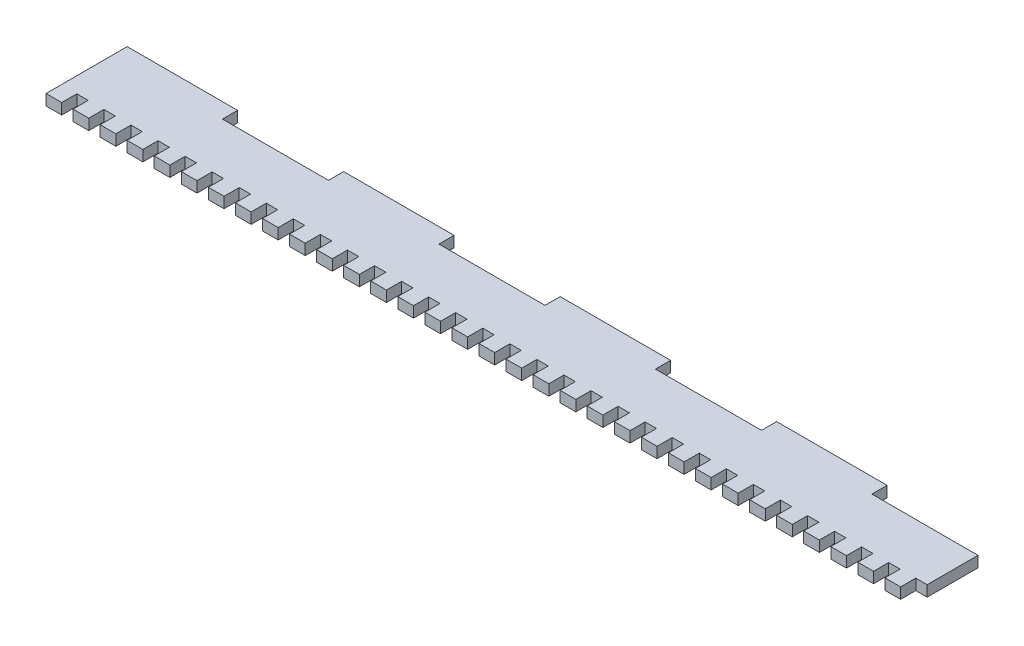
ISO-10303-21;
HEADER;
FILE_DESCRIPTION(('STEP AP214'),'2;1');
FILE_NAME('part.step','',(''),(''),'','','');
FILE_SCHEMA(('AUTOMOTIVE_DESIGN { 1 0 10303 214 1 1 1 1 }'));
ENDSEC;
DATA;
#1=APPLICATION_CONTEXT('core data for automotive mechanical design processes');
#2=APPLICATION_PROTOCOL_DEFINITION('international standard','automotive_design',2000,#1);
#3=PRODUCT_CONTEXT('',#1,'mechanical');
#4=PRODUCT('Part','Part','',(#3));
#5=PRODUCT_RELATED_PRODUCT_CATEGORY('part','',(#4));
#6=PRODUCT_DEFINITION_FORMATION('','',#4);
#7=PRODUCT_DEFINITION_CONTEXT('part definition',#1,'design');
#8=PRODUCT_DEFINITION('design','',#6,#7);
#9=PRODUCT_DEFINITION_SHAPE('','',#8);
#10=(LENGTH_UNIT() NAMED_UNIT(*) SI_UNIT(.MILLI.,.METRE.));
#11=(NAMED_UNIT(*) PLANE_ANGLE_UNIT() SI_UNIT($,.RADIAN.));
#12=(NAMED_UNIT(*) SI_UNIT($,.STERADIAN.) SOLID_ANGLE_UNIT());
#13=UNCERTAINTY_MEASURE_WITH_UNIT(LENGTH_MEASURE(1.E-05),#10,'distance_accuracy_value','');
#14=(GEOMETRIC_REPRESENTATION_CONTEXT(3) GLOBAL_UNCERTAINTY_ASSIGNED_CONTEXT((#13)) GLOBAL_UNIT_ASSIGNED_CONTEXT((#10,
#11,#12)) REPRESENTATION_CONTEXT('',''));
#15=CARTESIAN_POINT('',(0.,0.,0.));
#16=DIRECTION('',(0.,0.,1.));
#17=DIRECTION('',(1.,0.,0.));
#18=AXIS2_PLACEMENT_3D('',#15,#16,#17);
#19=CARTESIAN_POINT('',(196.85,2.54,0.));
#20=DIRECTION('',(1.,0.,0.));
#21=DIRECTION('',(0.,0.,-1.));
#22=AXIS2_PLACEMENT_3D('',#19,#20,#21);
#23=PLANE('',#22);
#24=DIRECTION('',(0.,0.,1.));
#25=VECTOR('',#24,1.);
#26=CARTESIAN_POINT('',(196.85,0.,0.));
#27=LINE('',#26,#25);
#28=CARTESIAN_POINT('',(196.85,0.,-3.556));
#29=VERTEX_POINT('',#28);
#30=CARTESIAN_POINT('',(196.85,0.,0.));
#31=VERTEX_POINT('',#30);
#32=EDGE_CURVE('E2209',#29,#31,#27,.T.);
#33=ORIENTED_EDGE('',*,*,#32,.T.);
#34=DIRECTION('',(0.,-1.,0.));
#35=VECTOR('',#34,1.);
#36=CARTESIAN_POINT('',(196.85,2.54,0.));
#37=LINE('',#36,#35);
#38=CARTESIAN_POINT('',(196.85,2.54,0.));
#39=VERTEX_POINT('',#38);
#40=EDGE_CURVE('E12',#39,#31,#37,.T.);
#41=ORIENTED_EDGE('',*,*,#40,.F.);
#42=DIRECTION('',(0.,0.,1.));
#43=VECTOR('',#42,1.);
#44=CARTESIAN_POINT('',(196.85,2.54,0.));
#45=LINE('',#44,#43);
#46=CARTESIAN_POINT('',(196.85,2.54,-3.556));
#47=VERTEX_POINT('',#46);
#48=EDGE_CURVE('E1636',#47,#39,#45,.T.);
#49=ORIENTED_EDGE('',*,*,#48,.F.);
#50=DIRECTION('',(0.,-1.,0.));
#51=VECTOR('',#50,1.);
#52=CARTESIAN_POINT('',(196.85,2.54,-3.556));
#53=LINE('',#52,#51);
#54=EDGE_CURVE('E953',#47,#29,#53,.T.);
#55=ORIENTED_EDGE('',*,*,#54,.T.);
#56=EDGE_LOOP('',(#33,#41,#49,#55));
#57=FACE_BOUND('',#56,.T.);
#58=ADVANCED_FACE('F40',(#57),#23,.F.);
#59=CARTESIAN_POINT('',(0.,2.54,0.));
#60=DIRECTION('',(0.,0.,-1.));
#61=DIRECTION('',(-1.,0.,0.));
#62=AXIS2_PLACEMENT_3D('',#59,#60,#61);
#63=PLANE('',#62);
#64=DIRECTION('',(1.,0.,0.));
#65=VECTOR('',#64,1.);
#66=CARTESIAN_POINT('',(0.,0.,0.));
#67=LINE('',#66,#65);
#68=CARTESIAN_POINT('',(200.533,0.,0.));
#69=VERTEX_POINT('',#68);
#70=EDGE_CURVE('E2200',#31,#69,#67,.T.);
#71=ORIENTED_EDGE('',*,*,#70,.T.);
#72=DIRECTION('',(0.,-1.,0.));
#73=VECTOR('',#72,1.);
#74=CARTESIAN_POINT('',(200.533,2.54,0.));
#75=LINE('',#74,#73);
#76=CARTESIAN_POINT('',(200.533,2.54,0.));
#77=VERTEX_POINT('',#76);
#78=EDGE_CURVE('E49',#77,#69,#75,.T.);
#79=ORIENTED_EDGE('',*,*,#78,.F.);
#80=DIRECTION('',(1.,0.,0.));
#81=VECTOR('',#80,1.);
#82=CARTESIAN_POINT('',(0.,2.54,0.));
#83=LINE('',#82,#81);
#84=EDGE_CURVE('E508',#39,#77,#83,.T.);
#85=ORIENTED_EDGE('',*,*,#84,.F.);
#86=ORIENTED_EDGE('',*,*,#40,.T.);
#87=EDGE_LOOP('',(#71,#79,#85,#86));
#88=FACE_BOUND('',#87,.T.);
#89=ADVANCED_FACE('F2658',(#88),#63,.F.);
#90=CARTESIAN_POINT('',(200.533,2.54,0.));
#91=DIRECTION('',(-1.,0.,0.));
#92=DIRECTION('',(0.,0.,1.));
#93=AXIS2_PLACEMENT_3D('',#90,#91,#92);
#94=PLANE('',#93);
#95=DIRECTION('',(0.,0.,-1.));
#96=VECTOR('',#95,1.);
#97=CARTESIAN_POINT('',(200.533,0.,0.));
#98=LINE('',#97,#96);
#99=CARTESIAN_POINT('',(200.533,0.,-3.556));
#100=VERTEX_POINT('',#99);
#101=EDGE_CURVE('E2195',#69,#100,#98,.T.);
#102=ORIENTED_EDGE('',*,*,#101,.T.);
#103=DIRECTION('',(0.,-1.,0.));
#104=VECTOR('',#103,1.);
#105=CARTESIAN_POINT('',(200.533,2.54,-3.556));
#106=LINE('',#105,#104);
#107=CARTESIAN_POINT('',(200.533,2.54,-3.556));
#108=VERTEX_POINT('',#107);
#109=EDGE_CURVE('E2185',#108,#100,#106,.T.);
#110=ORIENTED_EDGE('',*,*,#109,.F.);
#111=DIRECTION('',(0.,0.,-1.));
#112=VECTOR('',#111,1.);
#113=CARTESIAN_POINT('',(200.533,2.54,0.));
#114=LINE('',#113,#112);
#115=EDGE_CURVE('E1628',#77,#108,#114,.T.);
#116=ORIENTED_EDGE('',*,*,#115,.F.);
#117=ORIENTED_EDGE('',*,*,#78,.T.);
#118=EDGE_LOOP('',(#102,#110,#116,#117));
#119=FACE_BOUND('',#118,.T.);
#120=ADVANCED_FACE('F2193',(#119),#94,.F.);
#121=CARTESIAN_POINT('',(0.,2.54,-3.556));
#122=DIRECTION('',(0.,0.,-1.));
#123=DIRECTION('',(-1.,0.,0.));
#124=AXIS2_PLACEMENT_3D('',#121,#122,#123);
#125=PLANE('',#124);
#126=DIRECTION('',(1.,0.,0.));
#127=VECTOR('',#126,1.);
#128=CARTESIAN_POINT('',(0.,0.,-3.556));
#129=LINE('',#128,#127);
#130=CARTESIAN_POINT('',(203.2,0.,-3.556));
#131=VERTEX_POINT('',#130);
#132=EDGE_CURVE('E2202',#100,#131,#129,.T.);
#133=ORIENTED_EDGE('',*,*,#132,.T.);
#134=DIRECTION('',(0.,-1.,0.));
#135=VECTOR('',#134,1.);
#136=CARTESIAN_POINT('',(203.2,2.54,-3.556));
#137=LINE('',#136,#135);
#138=CARTESIAN_POINT('',(203.2,2.54,-3.556));
#139=VERTEX_POINT('',#138);
#140=EDGE_CURVE('E2181',#139,#131,#137,.T.);
#141=ORIENTED_EDGE('',*,*,#140,.F.);
#142=DIRECTION('',(1.,0.,0.));
#143=VECTOR('',#142,1.);
#144=CARTESIAN_POINT('',(0.,2.54,-3.556));
#145=LINE('',#144,#143);
#146=EDGE_CURVE('E1624',#108,#139,#145,.T.);
#147=ORIENTED_EDGE('',*,*,#146,.F.);
#148=ORIENTED_EDGE('',*,*,#109,.T.);
#149=EDGE_LOOP('',(#133,#141,#147,#148));
#150=FACE_BOUND('',#149,.T.);
#151=ADVANCED_FACE('F2665',(#150),#125,.F.);
#152=CARTESIAN_POINT('',(203.2,2.54,0.));
#153=DIRECTION('',(-1.,0.,0.));
#154=DIRECTION('',(0.,0.,1.));
#155=AXIS2_PLACEMENT_3D('',#152,#153,#154);
#156=PLANE('',#155);
#157=DIRECTION('',(0.,0.,-1.));
#158=VECTOR('',#157,1.);
#159=CARTESIAN_POINT('',(203.2,0.,0.));
#160=LINE('',#159,#158);
#161=CARTESIAN_POINT('',(203.2,0.,-15.494));
#162=VERTEX_POINT('',#161);
#163=EDGE_CURVE('E2207',#131,#162,#160,.T.);
#164=ORIENTED_EDGE('',*,*,#163,.T.);
#165=DIRECTION('',(0.,-1.,0.));
#166=VECTOR('',#165,1.);
#167=CARTESIAN_POINT('',(203.2,2.54,-15.494));
#168=LINE('',#167,#166);
#169=CARTESIAN_POINT('',(203.2,2.54,-15.494));
#170=VERTEX_POINT('',#169);
#171=EDGE_CURVE('E2178',#170,#162,#168,.T.);
#172=ORIENTED_EDGE('',*,*,#171,.F.);
#173=DIRECTION('',(0.,0.,-1.));
#174=VECTOR('',#173,1.);
#175=CARTESIAN_POINT('',(203.2,2.54,0.));
#176=LINE('',#175,#174);
#177=EDGE_CURVE('E1621',#139,#170,#176,.T.);
#178=ORIENTED_EDGE('',*,*,#177,.F.);
#179=ORIENTED_EDGE('',*,*,#140,.T.);
#180=EDGE_LOOP('',(#164,#172,#178,#179));
#181=FACE_BOUND('',#180,.T.);
#182=ADVANCED_FACE('F2670',(#181),#156,.F.);
#183=CARTESIAN_POINT('',(0.,2.54,-15.494));
#184=DIRECTION('',(0.,0.,-1.));
#185=DIRECTION('',(-1.,0.,0.));
#186=AXIS2_PLACEMENT_3D('',#183,#184,#185);
#187=PLANE('',#186);
#188=DIRECTION('',(1.,0.,0.));
#189=VECTOR('',#188,1.);
#190=CARTESIAN_POINT('',(0.,0.,-15.494));
#191=LINE('',#190,#189);
#192=CARTESIAN_POINT('',(178.308,0.,-15.494));
#193=VERTEX_POINT('',#192);
#194=EDGE_CURVE('E2215',#193,#162,#191,.T.);
#195=ORIENTED_EDGE('',*,*,#194,.F.);
#196=DIRECTION('',(0.,-1.,0.));
#197=VECTOR('',#196,1.);
#198=CARTESIAN_POINT('',(178.308,2.54,-15.494));
#199=LINE('',#198,#197);
#200=CARTESIAN_POINT('',(178.308,2.54,-15.494));
#201=VERTEX_POINT('',#200);
#202=EDGE_CURVE('E2175',#201,#193,#199,.T.);
#203=ORIENTED_EDGE('',*,*,#202,.F.);
#204=DIRECTION('',(1.,0.,0.));
#205=VECTOR('',#204,1.);
#206=CARTESIAN_POINT('',(0.,2.54,-15.494));
#207=LINE('',#206,#205);
#208=EDGE_CURVE('E1613',#201,#170,#207,.T.);
#209=ORIENTED_EDGE('',*,*,#208,.T.);
#210=ORIENTED_EDGE('',*,*,#171,.T.);
#211=EDGE_LOOP('',(#195,#203,#209,#210));
#212=FACE_BOUND('',#211,.T.);
#213=ADVANCED_FACE('F2674',(#212),#187,.T.);
#214=CARTESIAN_POINT('',(178.308,2.54,0.));
#215=DIRECTION('',(1.,0.,0.));
#216=DIRECTION('',(0.,0.,-1.));
#217=AXIS2_PLACEMENT_3D('',#214,#215,#216);
#218=PLANE('',#217);
#219=DIRECTION('',(0.,0.,1.));
#220=VECTOR('',#219,1.);
#221=CARTESIAN_POINT('',(178.308,0.,0.));
#222=LINE('',#221,#220);
#223=CARTESIAN_POINT('',(178.308,0.,-19.05));
#224=VERTEX_POINT('',#223);
#225=EDGE_CURVE('E2219',#224,#193,#222,.T.);
#226=ORIENTED_EDGE('',*,*,#225,.F.);
#227=DIRECTION('',(0.,-1.,0.));
#228=VECTOR('',#227,1.);
#229=CARTESIAN_POINT('',(178.308,2.54,-19.05));
#230=LINE('',#229,#228);
#231=CARTESIAN_POINT('',(178.308,2.54,-19.05));
#232=VERTEX_POINT('',#231);
#233=EDGE_CURVE('E2172',#232,#224,#230,.T.);
#234=ORIENTED_EDGE('',*,*,#233,.F.);
#235=DIRECTION('',(0.,0.,1.));
#236=VECTOR('',#235,1.);
#237=CARTESIAN_POINT('',(178.308,2.54,0.));
#238=LINE('',#237,#236);
#239=EDGE_CURVE('E1608',#232,#201,#238,.T.);
#240=ORIENTED_EDGE('',*,*,#239,.T.);
#241=ORIENTED_EDGE('',*,*,#202,.T.);
#242=EDGE_LOOP('',(#226,#234,#240,#241));
#243=FACE_BOUND('',#242,.T.);
#244=ADVANCED_FACE('F2678',(#243),#218,.T.);
#245=CARTESIAN_POINT('',(0.,2.54,-19.05));
#246=DIRECTION('',(0.,0.,-1.));
#247=DIRECTION('',(-1.,0.,0.));
#248=AXIS2_PLACEMENT_3D('',#245,#246,#247);
#249=PLANE('',#248);
#250=DIRECTION('',(1.,0.,0.));
#251=VECTOR('',#250,1.);
#252=CARTESIAN_POINT('',(0.,0.,-19.05));
#253=LINE('',#252,#251);
#254=CARTESIAN_POINT('',(152.4,0.,-19.05));
#255=VERTEX_POINT('',#254);
#256=EDGE_CURVE('E2223',#255,#224,#253,.T.);
#257=ORIENTED_EDGE('',*,*,#256,.F.);
#258=DIRECTION('',(0.,-1.,0.));
#259=VECTOR('',#258,1.);
#260=CARTESIAN_POINT('',(152.4,2.54,-19.05));
#261=LINE('',#260,#259);
#262=CARTESIAN_POINT('',(152.4,2.54,-19.05));
#263=VERTEX_POINT('',#262);
#264=EDGE_CURVE('E2169',#263,#255,#261,.T.);
#265=ORIENTED_EDGE('',*,*,#264,.F.);
#266=DIRECTION('',(1.,0.,0.));
#267=VECTOR('',#266,1.);
#268=CARTESIAN_POINT('',(0.,2.54,-19.05));
#269=LINE('',#268,#267);
#270=EDGE_CURVE('E1603',#263,#232,#269,.T.);
#271=ORIENTED_EDGE('',*,*,#270,.T.);
#272=ORIENTED_EDGE('',*,*,#233,.T.);
#273=EDGE_LOOP('',(#257,#265,#271,#272));
#274=FACE_BOUND('',#273,.T.);
#275=ADVANCED_FACE('F2682',(#274),#249,.T.);
#276=CARTESIAN_POINT('',(152.4,2.54,0.));
#277=DIRECTION('',(-1.,0.,0.));
#278=DIRECTION('',(0.,0.,1.));
#279=AXIS2_PLACEMENT_3D('',#276,#277,#278);
#280=PLANE('',#279);
#281=DIRECTION('',(0.,0.,-1.));
#282=VECTOR('',#281,1.);
#283=CARTESIAN_POINT('',(152.4,0.,0.));
#284=LINE('',#283,#282);
#285=CARTESIAN_POINT('',(152.4,0.,-15.494));
#286=VERTEX_POINT('',#285);
#287=EDGE_CURVE('E2227',#286,#255,#284,.T.);
#288=ORIENTED_EDGE('',*,*,#287,.F.);
#289=DIRECTION('',(0.,-1.,0.));
#290=VECTOR('',#289,1.);
#291=CARTESIAN_POINT('',(152.4,2.54,-15.494));
#292=LINE('',#291,#290);
#293=CARTESIAN_POINT('',(152.4,2.54,-15.494));
#294=VERTEX_POINT('',#293);
#295=EDGE_CURVE('E2166',#294,#286,#292,.T.);
#296=ORIENTED_EDGE('',*,*,#295,.F.);
#297=DIRECTION('',(0.,0.,-1.));
#298=VECTOR('',#297,1.);
#299=CARTESIAN_POINT('',(152.4,2.54,0.));
#300=LINE('',#299,#298);
#301=EDGE_CURVE('E1599',#294,#263,#300,.T.);
#302=ORIENTED_EDGE('',*,*,#301,.T.);
#303=ORIENTED_EDGE('',*,*,#264,.T.);
#304=EDGE_LOOP('',(#288,#296,#302,#303));
#305=FACE_BOUND('',#304,.T.);
#306=ADVANCED_FACE('F2686',(#305),#280,.T.);
#307=CARTESIAN_POINT('',(0.,2.54,-15.494));
#308=DIRECTION('',(0.,0.,-1.));
#309=DIRECTION('',(-1.,0.,0.));
#310=AXIS2_PLACEMENT_3D('',#307,#308,#309);
#311=PLANE('',#310);
#312=DIRECTION('',(1.,0.,0.));
#313=VECTOR('',#312,1.);
#314=CARTESIAN_POINT('',(0.,0.,-15.494));
#315=LINE('',#314,#313);
#316=CARTESIAN_POINT('',(127.508,0.,-15.494));
#317=VERTEX_POINT('',#316);
#318=EDGE_CURVE('E2231',#317,#286,#315,.T.);
#319=ORIENTED_EDGE('',*,*,#318,.F.);
#320=DIRECTION('',(0.,-1.,0.));
#321=VECTOR('',#320,1.);
#322=CARTESIAN_POINT('',(127.508,2.54,-15.494));
#323=LINE('',#322,#321);
#324=CARTESIAN_POINT('',(127.508,2.54,-15.494));
#325=VERTEX_POINT('',#324);
#326=EDGE_CURVE('E2163',#325,#317,#323,.T.);
#327=ORIENTED_EDGE('',*,*,#326,.F.);
#328=DIRECTION('',(1.,0.,0.));
#329=VECTOR('',#328,1.);
#330=CARTESIAN_POINT('',(0.,2.54,-15.494));
#331=LINE('',#330,#329);
#332=EDGE_CURVE('E1591',#325,#294,#331,.T.);
#333=ORIENTED_EDGE('',*,*,#332,.T.);
#334=ORIENTED_EDGE('',*,*,#295,.T.);
#335=EDGE_LOOP('',(#319,#327,#333,#334));
#336=FACE_BOUND('',#335,.T.);
#337=ADVANCED_FACE('F2690',(#336),#311,.T.);
#338=CARTESIAN_POINT('',(127.508,2.54,0.));
#339=DIRECTION('',(1.,0.,0.));
#340=DIRECTION('',(0.,0.,-1.));
#341=AXIS2_PLACEMENT_3D('',#338,#339,#340);
#342=PLANE('',#341);
#343=DIRECTION('',(0.,0.,1.));
#344=VECTOR('',#343,1.);
#345=CARTESIAN_POINT('',(127.508,0.,0.));
#346=LINE('',#345,#344);
#347=CARTESIAN_POINT('',(127.508,0.,-19.05));
#348=VERTEX_POINT('',#347);
#349=EDGE_CURVE('E2235',#348,#317,#346,.T.);
#350=ORIENTED_EDGE('',*,*,#349,.F.);
#351=DIRECTION('',(0.,-1.,0.));
#352=VECTOR('',#351,1.);
#353=CARTESIAN_POINT('',(127.508,2.54,-19.05));
#354=LINE('',#353,#352);
#355=CARTESIAN_POINT('',(127.508,2.54,-19.05));
#356=VERTEX_POINT('',#355);
#357=EDGE_CURVE('E2160',#356,#348,#354,.T.);
#358=ORIENTED_EDGE('',*,*,#357,.F.);
#359=DIRECTION('',(0.,0.,1.));
#360=VECTOR('',#359,1.);
#361=CARTESIAN_POINT('',(127.508,2.54,0.));
#362=LINE('',#361,#360);
#363=EDGE_CURVE('E1586',#356,#325,#362,.T.);
#364=ORIENTED_EDGE('',*,*,#363,.T.);
#365=ORIENTED_EDGE('',*,*,#326,.T.);
#366=EDGE_LOOP('',(#350,#358,#364,#365));
#367=FACE_BOUND('',#366,.T.);
#368=ADVANCED_FACE('F2694',(#367),#342,.T.);
#369=CARTESIAN_POINT('',(0.,2.54,-19.05));
#370=DIRECTION('',(0.,0.,-1.));
#371=DIRECTION('',(-1.,0.,0.));
#372=AXIS2_PLACEMENT_3D('',#369,#370,#371);
#373=PLANE('',#372);
#374=DIRECTION('',(1.,0.,0.));
#375=VECTOR('',#374,1.);
#376=CARTESIAN_POINT('',(0.,0.,-19.05));
#377=LINE('',#376,#375);
#378=CARTESIAN_POINT('',(101.6,0.,-19.05));
#379=VERTEX_POINT('',#378);
#380=EDGE_CURVE('E2239',#379,#348,#377,.T.);
#381=ORIENTED_EDGE('',*,*,#380,.F.);
#382=DIRECTION('',(0.,-1.,0.));
#383=VECTOR('',#382,1.);
#384=CARTESIAN_POINT('',(101.6,2.54,-19.05));
#385=LINE('',#384,#383);
#386=CARTESIAN_POINT('',(101.6,2.54,-19.05));
#387=VERTEX_POINT('',#386);
#388=EDGE_CURVE('E2157',#387,#379,#385,.T.);
#389=ORIENTED_EDGE('',*,*,#388,.F.);
#390=DIRECTION('',(1.,0.,0.));
#391=VECTOR('',#390,1.);
#392=CARTESIAN_POINT('',(0.,2.54,-19.05));
#393=LINE('',#392,#391);
#394=EDGE_CURVE('E1581',#387,#356,#393,.T.);
#395=ORIENTED_EDGE('',*,*,#394,.T.);
#396=ORIENTED_EDGE('',*,*,#357,.T.);
#397=EDGE_LOOP('',(#381,#389,#395,#396));
#398=FACE_BOUND('',#397,.T.);
#399=ADVANCED_FACE('F2698',(#398),#373,.T.);
#400=CARTESIAN_POINT('',(101.6,2.54,0.));
#401=DIRECTION('',(-1.,0.,0.));
#402=DIRECTION('',(0.,0.,1.));
#403=AXIS2_PLACEMENT_3D('',#400,#401,#402);
#404=PLANE('',#403);
#405=DIRECTION('',(0.,0.,-1.));
#406=VECTOR('',#405,1.);
#407=CARTESIAN_POINT('',(101.6,0.,0.));
#408=LINE('',#407,#406);
#409=CARTESIAN_POINT('',(101.6,0.,-15.494));
#410=VERTEX_POINT('',#409);
#411=EDGE_CURVE('E2243',#410,#379,#408,.T.);
#412=ORIENTED_EDGE('',*,*,#411,.F.);
#413=DIRECTION('',(0.,-1.,0.));
#414=VECTOR('',#413,1.);
#415=CARTESIAN_POINT('',(101.6,2.54,-15.494));
#416=LINE('',#415,#414);
#417=CARTESIAN_POINT('',(101.6,2.54,-15.494));
#418=VERTEX_POINT('',#417);
#419=EDGE_CURVE('E2154',#418,#410,#416,.T.);
#420=ORIENTED_EDGE('',*,*,#419,.F.);
#421=DIRECTION('',(0.,0.,-1.));
#422=VECTOR('',#421,1.);
#423=CARTESIAN_POINT('',(101.6,2.54,0.));
#424=LINE('',#423,#422);
#425=EDGE_CURVE('E1577',#418,#387,#424,.T.);
#426=ORIENTED_EDGE('',*,*,#425,.T.);
#427=ORIENTED_EDGE('',*,*,#388,.T.);
#428=EDGE_LOOP('',(#412,#420,#426,#427));
#429=FACE_BOUND('',#428,.T.);
#430=ADVANCED_FACE('F2702',(#429),#404,.T.);
#431=CARTESIAN_POINT('',(0.,2.54,-15.494));
#432=DIRECTION('',(0.,0.,-1.));
#433=DIRECTION('',(-1.,0.,0.));
#434=AXIS2_PLACEMENT_3D('',#431,#432,#433);
#435=PLANE('',#434);
#436=DIRECTION('',(1.,0.,0.));
#437=VECTOR('',#436,1.);
#438=CARTESIAN_POINT('',(0.,0.,-15.494));
#439=LINE('',#438,#437);
#440=CARTESIAN_POINT('',(76.708,0.,-15.494));
#441=VERTEX_POINT('',#440);
#442=EDGE_CURVE('E2247',#441,#410,#439,.T.);
#443=ORIENTED_EDGE('',*,*,#442,.F.);
#444=DIRECTION('',(0.,-1.,0.));
#445=VECTOR('',#444,1.);
#446=CARTESIAN_POINT('',(76.708,2.54,-15.494));
#447=LINE('',#446,#445);
#448=CARTESIAN_POINT('',(76.708,2.54,-15.494));
#449=VERTEX_POINT('',#448);
#450=EDGE_CURVE('E2151',#449,#441,#447,.T.);
#451=ORIENTED_EDGE('',*,*,#450,.F.);
#452=DIRECTION('',(1.,0.,0.));
#453=VECTOR('',#452,1.);
#454=CARTESIAN_POINT('',(0.,2.54,-15.494));
#455=LINE('',#454,#453);
#456=EDGE_CURVE('E1569',#449,#418,#455,.T.);
#457=ORIENTED_EDGE('',*,*,#456,.T.);
#458=ORIENTED_EDGE('',*,*,#419,.T.);
#459=EDGE_LOOP('',(#443,#451,#457,#458));
#460=FACE_BOUND('',#459,.T.);
#461=ADVANCED_FACE('F2706',(#460),#435,.T.);
#462=CARTESIAN_POINT('',(76.708,2.54,0.));
#463=DIRECTION('',(1.,0.,0.));
#464=DIRECTION('',(0.,0.,-1.));
#465=AXIS2_PLACEMENT_3D('',#462,#463,#464);
#466=PLANE('',#465);
#467=DIRECTION('',(0.,0.,1.));
#468=VECTOR('',#467,1.);
#469=CARTESIAN_POINT('',(76.708,0.,0.));
#470=LINE('',#469,#468);
#471=CARTESIAN_POINT('',(76.708,0.,-19.05));
#472=VERTEX_POINT('',#471);
#473=EDGE_CURVE('E2251',#472,#441,#470,.T.);
#474=ORIENTED_EDGE('',*,*,#473,.F.);
#475=DIRECTION('',(0.,-1.,0.));
#476=VECTOR('',#475,1.);
#477=CARTESIAN_POINT('',(76.708,2.54,-19.05));
#478=LINE('',#477,#476);
#479=CARTESIAN_POINT('',(76.708,2.54,-19.05));
#480=VERTEX_POINT('',#479);
#481=EDGE_CURVE('E2148',#480,#472,#478,.T.);
#482=ORIENTED_EDGE('',*,*,#481,.F.);
#483=DIRECTION('',(0.,0.,1.));
#484=VECTOR('',#483,1.);
#485=CARTESIAN_POINT('',(76.708,2.54,0.));
#486=LINE('',#485,#484);
#487=EDGE_CURVE('E1564',#480,#449,#486,.T.);
#488=ORIENTED_EDGE('',*,*,#487,.T.);
#489=ORIENTED_EDGE('',*,*,#450,.T.);
#490=EDGE_LOOP('',(#474,#482,#488,#489));
#491=FACE_BOUND('',#490,.T.);
#492=ADVANCED_FACE('F2710',(#491),#466,.T.);
#493=CARTESIAN_POINT('',(0.,2.54,-19.05));
#494=DIRECTION('',(0.,0.,-1.));
#495=DIRECTION('',(-1.,0.,0.));
#496=AXIS2_PLACEMENT_3D('',#493,#494,#495);
#497=PLANE('',#496);
#498=DIRECTION('',(1.,0.,0.));
#499=VECTOR('',#498,1.);
#500=CARTESIAN_POINT('',(0.,0.,-19.05));
#501=LINE('',#500,#499);
#502=CARTESIAN_POINT('',(50.8,0.,-19.05));
#503=VERTEX_POINT('',#502);
#504=EDGE_CURVE('E2255',#503,#472,#501,.T.);
#505=ORIENTED_EDGE('',*,*,#504,.F.);
#506=DIRECTION('',(0.,-1.,0.));
#507=VECTOR('',#506,1.);
#508=CARTESIAN_POINT('',(50.8,2.54,-19.05));
#509=LINE('',#508,#507);
#510=CARTESIAN_POINT('',(50.8,2.54,-19.05));
#511=VERTEX_POINT('',#510);
#512=EDGE_CURVE('E2145',#511,#503,#509,.T.);
#513=ORIENTED_EDGE('',*,*,#512,.F.);
#514=DIRECTION('',(1.,0.,0.));
#515=VECTOR('',#514,1.);
#516=CARTESIAN_POINT('',(0.,2.54,-19.05));
#517=LINE('',#516,#515);
#518=EDGE_CURVE('E1559',#511,#480,#517,.T.);
#519=ORIENTED_EDGE('',*,*,#518,.T.);
#520=ORIENTED_EDGE('',*,*,#481,.T.);
#521=EDGE_LOOP('',(#505,#513,#519,#520));
#522=FACE_BOUND('',#521,.T.);
#523=ADVANCED_FACE('F2714',(#522),#497,.T.);
#524=CARTESIAN_POINT('',(50.8,2.54,0.));
#525=DIRECTION('',(-1.,0.,0.));
#526=DIRECTION('',(0.,0.,1.));
#527=AXIS2_PLACEMENT_3D('',#524,#525,#526);
#528=PLANE('',#527);
#529=DIRECTION('',(0.,0.,-1.));
#530=VECTOR('',#529,1.);
#531=CARTESIAN_POINT('',(50.8,0.,0.));
#532=LINE('',#531,#530);
#533=CARTESIAN_POINT('',(50.8,0.,-15.494));
#534=VERTEX_POINT('',#533);
#535=EDGE_CURVE('E2259',#534,#503,#532,.T.);
#536=ORIENTED_EDGE('',*,*,#535,.F.);
#537=DIRECTION('',(0.,-1.,0.));
#538=VECTOR('',#537,1.);
#539=CARTESIAN_POINT('',(50.8,2.54,-15.494));
#540=LINE('',#539,#538);
#541=CARTESIAN_POINT('',(50.8,2.54,-15.494));
#542=VERTEX_POINT('',#541);
#543=EDGE_CURVE('E2142',#542,#534,#540,.T.);
#544=ORIENTED_EDGE('',*,*,#543,.F.);
#545=DIRECTION('',(0.,0.,-1.));
#546=VECTOR('',#545,1.);
#547=CARTESIAN_POINT('',(50.8,2.54,0.));
#548=LINE('',#547,#546);
#549=EDGE_CURVE('E1555',#542,#511,#548,.T.);
#550=ORIENTED_EDGE('',*,*,#549,.T.);
#551=ORIENTED_EDGE('',*,*,#512,.T.);
#552=EDGE_LOOP('',(#536,#544,#550,#551));
#553=FACE_BOUND('',#552,.T.);
#554=ADVANCED_FACE('F2718',(#553),#528,.T.);
#555=CARTESIAN_POINT('',(0.,2.54,-15.494));
#556=DIRECTION('',(0.,0.,-1.));
#557=DIRECTION('',(-1.,0.,0.));
#558=AXIS2_PLACEMENT_3D('',#555,#556,#557);
#559=PLANE('',#558);
#560=DIRECTION('',(1.,0.,0.));
#561=VECTOR('',#560,1.);
#562=CARTESIAN_POINT('',(0.,0.,-15.494));
#563=LINE('',#562,#561);
#564=CARTESIAN_POINT('',(25.908,0.,-15.494));
#565=VERTEX_POINT('',#564);
#566=EDGE_CURVE('E2263',#565,#534,#563,.T.);
#567=ORIENTED_EDGE('',*,*,#566,.F.);
#568=DIRECTION('',(0.,-1.,0.));
#569=VECTOR('',#568,1.);
#570=CARTESIAN_POINT('',(25.908,2.54,-15.494));
#571=LINE('',#570,#569);
#572=CARTESIAN_POINT('',(25.908,2.54,-15.494));
#573=VERTEX_POINT('',#572);
#574=EDGE_CURVE('E2139',#573,#565,#571,.T.);
#575=ORIENTED_EDGE('',*,*,#574,.F.);
#576=DIRECTION('',(1.,0.,0.));
#577=VECTOR('',#576,1.);
#578=CARTESIAN_POINT('',(0.,2.54,-15.494));
#579=LINE('',#578,#577);
#580=EDGE_CURVE('E1547',#573,#542,#579,.T.);
#581=ORIENTED_EDGE('',*,*,#580,.T.);
#582=ORIENTED_EDGE('',*,*,#543,.T.);
#583=EDGE_LOOP('',(#567,#575,#581,#582));
#584=FACE_BOUND('',#583,.T.);
#585=ADVANCED_FACE('F2722',(#584),#559,.T.);
#586=CARTESIAN_POINT('',(25.908,2.54,0.));
#587=DIRECTION('',(1.,0.,0.));
#588=DIRECTION('',(0.,0.,-1.));
#589=AXIS2_PLACEMENT_3D('',#586,#587,#588);
#590=PLANE('',#589);
#591=DIRECTION('',(0.,0.,1.));
#592=VECTOR('',#591,1.);
#593=CARTESIAN_POINT('',(25.908,0.,0.));
#594=LINE('',#593,#592);
#595=CARTESIAN_POINT('',(25.908,0.,-19.05));
#596=VERTEX_POINT('',#595);
#597=EDGE_CURVE('E2267',#596,#565,#594,.T.);
#598=ORIENTED_EDGE('',*,*,#597,.F.);
#599=DIRECTION('',(0.,-1.,0.));
#600=VECTOR('',#599,1.);
#601=CARTESIAN_POINT('',(25.908,2.54,-19.05));
#602=LINE('',#601,#600);
#603=CARTESIAN_POINT('',(25.908,2.54,-19.05));
#604=VERTEX_POINT('',#603);
#605=EDGE_CURVE('E2136',#604,#596,#602,.T.);
#606=ORIENTED_EDGE('',*,*,#605,.F.);
#607=DIRECTION('',(0.,0.,1.));
#608=VECTOR('',#607,1.);
#609=CARTESIAN_POINT('',(25.908,2.54,0.));
#610=LINE('',#609,#608);
#611=EDGE_CURVE('E1542',#604,#573,#610,.T.);
#612=ORIENTED_EDGE('',*,*,#611,.T.);
#613=ORIENTED_EDGE('',*,*,#574,.T.);
#614=EDGE_LOOP('',(#598,#606,#612,#613));
#615=FACE_BOUND('',#614,.T.);
#616=ADVANCED_FACE('F2726',(#615),#590,.T.);
#617=CARTESIAN_POINT('',(0.,2.54,-19.05));
#618=DIRECTION('',(0.,0.,-1.));
#619=DIRECTION('',(-1.,0.,0.));
#620=AXIS2_PLACEMENT_3D('',#617,#618,#619);
#621=PLANE('',#620);
#622=DIRECTION('',(1.,0.,0.));
#623=VECTOR('',#622,1.);
#624=CARTESIAN_POINT('',(0.,0.,-19.05));
#625=LINE('',#624,#623);
#626=CARTESIAN_POINT('',(0.,0.,-19.05));
#627=VERTEX_POINT('',#626);
#628=EDGE_CURVE('E2271',#627,#596,#625,.T.);
#629=ORIENTED_EDGE('',*,*,#628,.F.);
#630=DIRECTION('',(0.,-1.,0.));
#631=VECTOR('',#630,1.);
#632=CARTESIAN_POINT('',(0.,2.54,-19.05));
#633=LINE('',#632,#631);
#634=CARTESIAN_POINT('',(0.,2.54,-19.05));
#635=VERTEX_POINT('',#634);
#636=EDGE_CURVE('E2133',#635,#627,#633,.T.);
#637=ORIENTED_EDGE('',*,*,#636,.F.);
#638=DIRECTION('',(1.,0.,0.));
#639=VECTOR('',#638,1.);
#640=CARTESIAN_POINT('',(0.,2.54,-19.05));
#641=LINE('',#640,#639);
#642=EDGE_CURVE('E1537',#635,#604,#641,.T.);
#643=ORIENTED_EDGE('',*,*,#642,.T.);
#644=ORIENTED_EDGE('',*,*,#605,.T.);
#645=EDGE_LOOP('',(#629,#637,#643,#644));
#646=FACE_BOUND('',#645,.T.);
#647=ADVANCED_FACE('F2730',(#646),#621,.T.);
#648=CARTESIAN_POINT('',(0.,2.54,0.));
#649=DIRECTION('',(-1.,0.,0.));
#650=DIRECTION('',(0.,0.,1.));
#651=AXIS2_PLACEMENT_3D('',#648,#649,#650);
#652=PLANE('',#651);
#653=DIRECTION('',(0.,0.,-1.));
#654=VECTOR('',#653,1.);
#655=CARTESIAN_POINT('',(0.,0.,0.));
#656=LINE('',#655,#654);
#657=CARTESIAN_POINT('',(0.,0.,0.));
#658=VERTEX_POINT('',#657);
#659=EDGE_CURVE('E2275',#658,#627,#656,.T.);
#660=ORIENTED_EDGE('',*,*,#659,.F.);
#661=DIRECTION('',(0.,-1.,0.));
#662=VECTOR('',#661,1.);
#663=CARTESIAN_POINT('',(0.,2.54,0.));
#664=LINE('',#663,#662);
#665=CARTESIAN_POINT('',(0.,2.54,0.));
#666=VERTEX_POINT('',#665);
#667=EDGE_CURVE('E2130',#666,#658,#664,.T.);
#668=ORIENTED_EDGE('',*,*,#667,.F.);
#669=DIRECTION('',(0.,0.,-1.));
#670=VECTOR('',#669,1.);
#671=CARTESIAN_POINT('',(0.,2.54,0.));
#672=LINE('',#671,#670);
#673=EDGE_CURVE('E1533',#666,#635,#672,.T.);
#674=ORIENTED_EDGE('',*,*,#673,.T.);
#675=ORIENTED_EDGE('',*,*,#636,.T.);
#676=EDGE_LOOP('',(#660,#668,#674,#675));
#677=FACE_BOUND('',#676,.T.);
#678=ADVANCED_FACE('F2734',(#677),#652,.T.);
#679=CARTESIAN_POINT('',(0.,2.54,0.));
#680=DIRECTION('',(0.,0.,-1.));
#681=DIRECTION('',(-1.,0.,0.));
#682=AXIS2_PLACEMENT_3D('',#679,#680,#681);
#683=PLANE('',#682);
#684=DIRECTION('',(1.,0.,0.));
#685=VECTOR('',#684,1.);
#686=CARTESIAN_POINT('',(0.,0.,0.));
#687=LINE('',#686,#685);
#688=CARTESIAN_POINT('',(3.683,0.,0.));
#689=VERTEX_POINT('',#688);
#690=EDGE_CURVE('E2279',#658,#689,#687,.T.);
#691=ORIENTED_EDGE('',*,*,#690,.T.);
#692=DIRECTION('',(0.,-1.,0.));
#693=VECTOR('',#692,1.);
#694=CARTESIAN_POINT('',(3.683,2.54,0.));
#695=LINE('',#694,#693);
#696=CARTESIAN_POINT('',(3.683,2.54,0.));
#697=VERTEX_POINT('',#696);
#698=EDGE_CURVE('E2126',#697,#689,#695,.T.);
#699=ORIENTED_EDGE('',*,*,#698,.F.);
#700=DIRECTION('',(1.,0.,0.));
#701=VECTOR('',#700,1.);
#702=CARTESIAN_POINT('',(0.,2.54,0.));
#703=LINE('',#702,#701);
#704=EDGE_CURVE('E1525',#666,#697,#703,.T.);
#705=ORIENTED_EDGE('',*,*,#704,.F.);
#706=ORIENTED_EDGE('',*,*,#667,.T.);
#707=EDGE_LOOP('',(#691,#699,#705,#706));
#708=FACE_BOUND('',#707,.T.);
#709=ADVANCED_FACE('F2738',(#708),#683,.F.);
#710=CARTESIAN_POINT('',(3.683,2.54,0.));
#711=DIRECTION('',(-1.,0.,0.));
#712=DIRECTION('',(0.,0.,1.));
#713=AXIS2_PLACEMENT_3D('',#710,#711,#712);
#714=PLANE('',#713);
#715=DIRECTION('',(0.,0.,-1.));
#716=VECTOR('',#715,1.);
#717=CARTESIAN_POINT('',(3.683,0.,0.));
#718=LINE('',#717,#716);
#719=CARTESIAN_POINT('',(3.683,0.,-3.556));
#720=VERTEX_POINT('',#719);
#721=EDGE_CURVE('E2282',#689,#720,#718,.T.);
#722=ORIENTED_EDGE('',*,*,#721,.T.);
#723=DIRECTION('',(0.,-1.,0.));
#724=VECTOR('',#723,1.);
#725=CARTESIAN_POINT('',(3.683,2.54,-3.556));
#726=LINE('',#725,#724);
#727=CARTESIAN_POINT('',(3.683,2.54,-3.556));
#728=VERTEX_POINT('',#727);
#729=EDGE_CURVE('E2122',#728,#720,#726,.T.);
#730=ORIENTED_EDGE('',*,*,#729,.F.);
#731=DIRECTION('',(0.,0.,-1.));
#732=VECTOR('',#731,1.);
#733=CARTESIAN_POINT('',(3.683,2.54,0.));
#734=LINE('',#733,#732);
#735=EDGE_CURVE('E1521',#697,#728,#734,.T.);
#736=ORIENTED_EDGE('',*,*,#735,.F.);
#737=ORIENTED_EDGE('',*,*,#698,.T.);
#738=EDGE_LOOP('',(#722,#730,#736,#737));
#739=FACE_BOUND('',#738,.T.);
#740=ADVANCED_FACE('F2742',(#739),#714,.F.);
#741=CARTESIAN_POINT('',(0.,2.54,-3.556));
#742=DIRECTION('',(0.,0.,-1.));
#743=DIRECTION('',(-1.,0.,0.));
#744=AXIS2_PLACEMENT_3D('',#741,#742,#743);
#745=PLANE('',#744);
#746=DIRECTION('',(1.,0.,0.));
#747=VECTOR('',#746,1.);
#748=CARTESIAN_POINT('',(0.,0.,-3.556));
#749=LINE('',#748,#747);
#750=CARTESIAN_POINT('',(6.35,0.,-3.556));
#751=VERTEX_POINT('',#750);
#752=EDGE_CURVE('E2285',#720,#751,#749,.T.);
#753=ORIENTED_EDGE('',*,*,#752,.T.);
#754=DIRECTION('',(0.,-1.,0.));
#755=VECTOR('',#754,1.);
#756=CARTESIAN_POINT('',(6.35,2.54,-3.556));
#757=LINE('',#756,#755);
#758=CARTESIAN_POINT('',(6.35,2.54,-3.556));
#759=VERTEX_POINT('',#758);
#760=EDGE_CURVE('E2118',#759,#751,#757,.T.);
#761=ORIENTED_EDGE('',*,*,#760,.F.);
#762=DIRECTION('',(1.,0.,0.));
#763=VECTOR('',#762,1.);
#764=CARTESIAN_POINT('',(0.,2.54,-3.556));
#765=LINE('',#764,#763);
#766=EDGE_CURVE('E1517',#728,#759,#765,.T.);
#767=ORIENTED_EDGE('',*,*,#766,.F.);
#768=ORIENTED_EDGE('',*,*,#729,.T.);
#769=EDGE_LOOP('',(#753,#761,#767,#768));
#770=FACE_BOUND('',#769,.T.);
#771=ADVANCED_FACE('F2746',(#770),#745,.F.);
#772=CARTESIAN_POINT('',(6.35,2.54,0.));
#773=DIRECTION('',(1.,0.,0.));
#774=DIRECTION('',(0.,0.,-1.));
#775=AXIS2_PLACEMENT_3D('',#772,#773,#774);
#776=PLANE('',#775);
#777=DIRECTION('',(0.,0.,1.));
#778=VECTOR('',#777,1.);
#779=CARTESIAN_POINT('',(6.35,0.,0.));
#780=LINE('',#779,#778);
#781=CARTESIAN_POINT('',(6.35,0.,0.));
#782=VERTEX_POINT('',#781);
#783=EDGE_CURVE('E2288',#751,#782,#780,.T.);
#784=ORIENTED_EDGE('',*,*,#783,.T.);
#785=DIRECTION('',(0.,-1.,0.));
#786=VECTOR('',#785,1.);
#787=CARTESIAN_POINT('',(6.35,2.54,0.));
#788=LINE('',#787,#786);
#789=CARTESIAN_POINT('',(6.35,2.54,0.));
#790=VERTEX_POINT('',#789);
#791=EDGE_CURVE('E2114',#790,#782,#788,.T.);
#792=ORIENTED_EDGE('',*,*,#791,.F.);
#793=DIRECTION('',(0.,0.,1.));
#794=VECTOR('',#793,1.);
#795=CARTESIAN_POINT('',(6.35,2.54,0.));
#796=LINE('',#795,#794);
#797=EDGE_CURVE('E1514',#759,#790,#796,.T.);
#798=ORIENTED_EDGE('',*,*,#797,.F.);
#799=ORIENTED_EDGE('',*,*,#760,.T.);
#800=EDGE_LOOP('',(#784,#792,#798,#799));
#801=FACE_BOUND('',#800,.T.);
#802=ADVANCED_FACE('F2750',(#801),#776,.F.);
#803=CARTESIAN_POINT('',(0.,2.54,0.));
#804=DIRECTION('',(0.,0.,-1.));
#805=DIRECTION('',(-1.,0.,0.));
#806=AXIS2_PLACEMENT_3D('',#803,#804,#805);
#807=PLANE('',#806);
#808=DIRECTION('',(1.,0.,0.));
#809=VECTOR('',#808,1.);
#810=CARTESIAN_POINT('',(0.,0.,0.));
#811=LINE('',#810,#809);
#812=CARTESIAN_POINT('',(10.033,0.,0.));
#813=VERTEX_POINT('',#812);
#814=EDGE_CURVE('E2291',#782,#813,#811,.T.);
#815=ORIENTED_EDGE('',*,*,#814,.T.);
#816=DIRECTION('',(0.,-1.,0.));
#817=VECTOR('',#816,1.);
#818=CARTESIAN_POINT('',(10.033,2.54,0.));
#819=LINE('',#818,#817);
#820=CARTESIAN_POINT('',(10.033,2.54,0.));
#821=VERTEX_POINT('',#820);
#822=EDGE_CURVE('E2110',#821,#813,#819,.T.);
#823=ORIENTED_EDGE('',*,*,#822,.F.);
#824=DIRECTION('',(1.,0.,0.));
#825=VECTOR('',#824,1.);
#826=CARTESIAN_POINT('',(0.,2.54,0.));
#827=LINE('',#826,#825);
#828=EDGE_CURVE('E1506',#790,#821,#827,.T.);
#829=ORIENTED_EDGE('',*,*,#828,.F.);
#830=ORIENTED_EDGE('',*,*,#791,.T.);
#831=EDGE_LOOP('',(#815,#823,#829,#830));
#832=FACE_BOUND('',#831,.T.);
#833=ADVANCED_FACE('F2754',(#832),#807,.F.);
#834=CARTESIAN_POINT('',(10.033,2.54,0.));
#835=DIRECTION('',(-1.,0.,0.));
#836=DIRECTION('',(0.,0.,1.));
#837=AXIS2_PLACEMENT_3D('',#834,#835,#836);
#838=PLANE('',#837);
#839=DIRECTION('',(0.,0.,-1.));
#840=VECTOR('',#839,1.);
#841=CARTESIAN_POINT('',(10.033,0.,0.));
#842=LINE('',#841,#840);
#843=CARTESIAN_POINT('',(10.033,0.,-3.556));
#844=VERTEX_POINT('',#843);
#845=EDGE_CURVE('E2294',#813,#844,#842,.T.);
#846=ORIENTED_EDGE('',*,*,#845,.T.);
#847=DIRECTION('',(0.,-1.,0.));
#848=VECTOR('',#847,1.);
#849=CARTESIAN_POINT('',(10.033,2.54,-3.556));
#850=LINE('',#849,#848);
#851=CARTESIAN_POINT('',(10.033,2.54,-3.556));
#852=VERTEX_POINT('',#851);
#853=EDGE_CURVE('E2106',#852,#844,#850,.T.);
#854=ORIENTED_EDGE('',*,*,#853,.F.);
#855=DIRECTION('',(0.,0.,-1.));
#856=VECTOR('',#855,1.);
#857=CARTESIAN_POINT('',(10.033,2.54,0.));
#858=LINE('',#857,#856);
#859=EDGE_CURVE('E1502',#821,#852,#858,.T.);
#860=ORIENTED_EDGE('',*,*,#859,.F.);
#861=ORIENTED_EDGE('',*,*,#822,.T.);
#862=EDGE_LOOP('',(#846,#854,#860,#861));
#863=FACE_BOUND('',#862,.T.);
#864=ADVANCED_FACE('F2758',(#863),#838,.F.);
#865=CARTESIAN_POINT('',(0.,2.54,-3.556));
#866=DIRECTION('',(0.,0.,-1.));
#867=DIRECTION('',(-1.,0.,0.));
#868=AXIS2_PLACEMENT_3D('',#865,#866,#867);
#869=PLANE('',#868);
#870=DIRECTION('',(1.,0.,0.));
#871=VECTOR('',#870,1.);
#872=CARTESIAN_POINT('',(0.,0.,-3.556));
#873=LINE('',#872,#871);
#874=CARTESIAN_POINT('',(12.7,0.,-3.556));
#875=VERTEX_POINT('',#874);
#876=EDGE_CURVE('E2297',#844,#875,#873,.T.);
#877=ORIENTED_EDGE('',*,*,#876,.T.);
#878=DIRECTION('',(0.,-1.,0.));
#879=VECTOR('',#878,1.);
#880=CARTESIAN_POINT('',(12.7,2.54,-3.556));
#881=LINE('',#880,#879);
#882=CARTESIAN_POINT('',(12.7,2.54,-3.556));
#883=VERTEX_POINT('',#882);
#884=EDGE_CURVE('E2102',#883,#875,#881,.T.);
#885=ORIENTED_EDGE('',*,*,#884,.F.);
#886=DIRECTION('',(1.,0.,0.));
#887=VECTOR('',#886,1.);
#888=CARTESIAN_POINT('',(0.,2.54,-3.556));
#889=LINE('',#888,#887);
#890=EDGE_CURVE('E1498',#852,#883,#889,.T.);
#891=ORIENTED_EDGE('',*,*,#890,.F.);
#892=ORIENTED_EDGE('',*,*,#853,.T.);
#893=EDGE_LOOP('',(#877,#885,#891,#892));
#894=FACE_BOUND('',#893,.T.);
#895=ADVANCED_FACE('F2762',(#894),#869,.F.);
#896=CARTESIAN_POINT('',(12.7,2.54,0.));
#897=DIRECTION('',(1.,0.,0.));
#898=DIRECTION('',(0.,0.,-1.));
#899=AXIS2_PLACEMENT_3D('',#896,#897,#898);
#900=PLANE('',#899);
#901=DIRECTION('',(0.,0.,1.));
#902=VECTOR('',#901,1.);
#903=CARTESIAN_POINT('',(12.7,0.,0.));
#904=LINE('',#903,#902);
#905=CARTESIAN_POINT('',(12.7,0.,0.));
#906=VERTEX_POINT('',#905);
#907=EDGE_CURVE('E2300',#875,#906,#904,.T.);
#908=ORIENTED_EDGE('',*,*,#907,.T.);
#909=DIRECTION('',(0.,-1.,0.));
#910=VECTOR('',#909,1.);
#911=CARTESIAN_POINT('',(12.7,2.54,0.));
#912=LINE('',#911,#910);
#913=CARTESIAN_POINT('',(12.7,2.54,0.));
#914=VERTEX_POINT('',#913);
#915=EDGE_CURVE('E2098',#914,#906,#912,.T.);
#916=ORIENTED_EDGE('',*,*,#915,.F.);
#917=DIRECTION('',(0.,0.,1.));
#918=VECTOR('',#917,1.);
#919=CARTESIAN_POINT('',(12.7,2.54,0.));
#920=LINE('',#919,#918);
#921=EDGE_CURVE('E1495',#883,#914,#920,.T.);
#922=ORIENTED_EDGE('',*,*,#921,.F.);
#923=ORIENTED_EDGE('',*,*,#884,.T.);
#924=EDGE_LOOP('',(#908,#916,#922,#923));
#925=FACE_BOUND('',#924,.T.);
#926=ADVANCED_FACE('F2766',(#925),#900,.F.);
#927=CARTESIAN_POINT('',(0.,2.54,0.));
#928=DIRECTION('',(0.,0.,-1.));
#929=DIRECTION('',(-1.,0.,0.));
#930=AXIS2_PLACEMENT_3D('',#927,#928,#929);
#931=PLANE('',#930);
#932=DIRECTION('',(1.,0.,0.));
#933=VECTOR('',#932,1.);
#934=CARTESIAN_POINT('',(0.,0.,0.));
#935=LINE('',#934,#933);
#936=CARTESIAN_POINT('',(16.383,0.,0.));
#937=VERTEX_POINT('',#936);
#938=EDGE_CURVE('E2303',#906,#937,#935,.T.);
#939=ORIENTED_EDGE('',*,*,#938,.T.);
#940=DIRECTION('',(0.,-1.,0.));
#941=VECTOR('',#940,1.);
#942=CARTESIAN_POINT('',(16.383,2.54,0.));
#943=LINE('',#942,#941);
#944=CARTESIAN_POINT('',(16.383,2.54,0.));
#945=VERTEX_POINT('',#944);
#946=EDGE_CURVE('E2094',#945,#937,#943,.T.);
#947=ORIENTED_EDGE('',*,*,#946,.F.);
#948=DIRECTION('',(1.,0.,0.));
#949=VECTOR('',#948,1.);
#950=CARTESIAN_POINT('',(0.,2.54,0.));
#951=LINE('',#950,#949);
#952=EDGE_CURVE('E1487',#914,#945,#951,.T.);
#953=ORIENTED_EDGE('',*,*,#952,.F.);
#954=ORIENTED_EDGE('',*,*,#915,.T.);
#955=EDGE_LOOP('',(#939,#947,#953,#954));
#956=FACE_BOUND('',#955,.T.);
#957=ADVANCED_FACE('F2770',(#956),#931,.F.);
#958=CARTESIAN_POINT('',(16.383,2.54,0.));
#959=DIRECTION('',(-1.,0.,0.));
#960=DIRECTION('',(0.,0.,1.));
#961=AXIS2_PLACEMENT_3D('',#958,#959,#960);
#962=PLANE('',#961);
#963=DIRECTION('',(0.,0.,-1.));
#964=VECTOR('',#963,1.);
#965=CARTESIAN_POINT('',(16.383,0.,0.));
#966=LINE('',#965,#964);
#967=CARTESIAN_POINT('',(16.383,0.,-3.556));
#968=VERTEX_POINT('',#967);
#969=EDGE_CURVE('E2306',#937,#968,#966,.T.);
#970=ORIENTED_EDGE('',*,*,#969,.T.);
#971=DIRECTION('',(0.,-1.,0.));
#972=VECTOR('',#971,1.);
#973=CARTESIAN_POINT('',(16.383,2.54,-3.556));
#974=LINE('',#973,#972);
#975=CARTESIAN_POINT('',(16.383,2.54,-3.556));
#976=VERTEX_POINT('',#975);
#977=EDGE_CURVE('E2090',#976,#968,#974,.T.);
#978=ORIENTED_EDGE('',*,*,#977,.F.);
#979=DIRECTION('',(0.,0.,-1.));
#980=VECTOR('',#979,1.);
#981=CARTESIAN_POINT('',(16.383,2.54,0.));
#982=LINE('',#981,#980);
#983=EDGE_CURVE('E1483',#945,#976,#982,.T.);
#984=ORIENTED_EDGE('',*,*,#983,.F.);
#985=ORIENTED_EDGE('',*,*,#946,.T.);
#986=EDGE_LOOP('',(#970,#978,#984,#985));
#987=FACE_BOUND('',#986,.T.);
#988=ADVANCED_FACE('F2774',(#987),#962,.F.);
#989=CARTESIAN_POINT('',(0.,2.54,-3.556));
#990=DIRECTION('',(0.,0.,-1.));
#991=DIRECTION('',(-1.,0.,0.));
#992=AXIS2_PLACEMENT_3D('',#989,#990,#991);
#993=PLANE('',#992);
#994=DIRECTION('',(1.,0.,0.));
#995=VECTOR('',#994,1.);
#996=CARTESIAN_POINT('',(0.,0.,-3.556));
#997=LINE('',#996,#995);
#998=CARTESIAN_POINT('',(19.05,0.,-3.556));
#999=VERTEX_POINT('',#998);
#1000=EDGE_CURVE('E2309',#968,#999,#997,.T.);
#1001=ORIENTED_EDGE('',*,*,#1000,.T.);
#1002=DIRECTION('',(0.,-1.,0.));
#1003=VECTOR('',#1002,1.);
#1004=CARTESIAN_POINT('',(19.05,2.54,-3.556));
#1005=LINE('',#1004,#1003);
#1006=CARTESIAN_POINT('',(19.05,2.54,-3.556));
#1007=VERTEX_POINT('',#1006);
#1008=EDGE_CURVE('E2086',#1007,#999,#1005,.T.);
#1009=ORIENTED_EDGE('',*,*,#1008,.F.);
#1010=DIRECTION('',(1.,0.,0.));
#1011=VECTOR('',#1010,1.);
#1012=CARTESIAN_POINT('',(0.,2.54,-3.556));
#1013=LINE('',#1012,#1011);
#1014=EDGE_CURVE('E1479',#976,#1007,#1013,.T.);
#1015=ORIENTED_EDGE('',*,*,#1014,.F.);
#1016=ORIENTED_EDGE('',*,*,#977,.T.);
#1017=EDGE_LOOP('',(#1001,#1009,#1015,#1016));
#1018=FACE_BOUND('',#1017,.T.);
#1019=ADVANCED_FACE('F2778',(#1018),#993,.F.);
#1020=CARTESIAN_POINT('',(19.05,2.54,0.));
#1021=DIRECTION('',(1.,0.,0.));
#1022=DIRECTION('',(0.,0.,-1.));
#1023=AXIS2_PLACEMENT_3D('',#1020,#1021,#1022);
#1024=PLANE('',#1023);
#1025=DIRECTION('',(0.,0.,1.));
#1026=VECTOR('',#1025,1.);
#1027=CARTESIAN_POINT('',(19.05,0.,0.));
#1028=LINE('',#1027,#1026);
#1029=CARTESIAN_POINT('',(19.05,0.,0.));
#1030=VERTEX_POINT('',#1029);
#1031=EDGE_CURVE('E2312',#999,#1030,#1028,.T.);
#1032=ORIENTED_EDGE('',*,*,#1031,.T.);
#1033=DIRECTION('',(0.,-1.,0.));
#1034=VECTOR('',#1033,1.);
#1035=CARTESIAN_POINT('',(19.05,2.54,0.));
#1036=LINE('',#1035,#1034);
#1037=CARTESIAN_POINT('',(19.05,2.54,0.));
#1038=VERTEX_POINT('',#1037);
#1039=EDGE_CURVE('E2082',#1038,#1030,#1036,.T.);
#1040=ORIENTED_EDGE('',*,*,#1039,.F.);
#1041=DIRECTION('',(0.,0.,1.));
#1042=VECTOR('',#1041,1.);
#1043=CARTESIAN_POINT('',(19.05,2.54,0.));
#1044=LINE('',#1043,#1042);
#1045=EDGE_CURVE('E1476',#1007,#1038,#1044,.T.);
#1046=ORIENTED_EDGE('',*,*,#1045,.F.);
#1047=ORIENTED_EDGE('',*,*,#1008,.T.);
#1048=EDGE_LOOP('',(#1032,#1040,#1046,#1047));
#1049=FACE_BOUND('',#1048,.T.);
#1050=ADVANCED_FACE('F2782',(#1049),#1024,.F.);
#1051=CARTESIAN_POINT('',(0.,2.54,0.));
#1052=DIRECTION('',(0.,0.,-1.));
#1053=DIRECTION('',(-1.,0.,0.));
#1054=AXIS2_PLACEMENT_3D('',#1051,#1052,#1053);
#1055=PLANE('',#1054);
#1056=DIRECTION('',(1.,0.,0.));
#1057=VECTOR('',#1056,1.);
#1058=CARTESIAN_POINT('',(0.,0.,0.));
#1059=LINE('',#1058,#1057);
#1060=CARTESIAN_POINT('',(22.733,0.,0.));
#1061=VERTEX_POINT('',#1060);
#1062=EDGE_CURVE('E2315',#1030,#1061,#1059,.T.);
#1063=ORIENTED_EDGE('',*,*,#1062,.T.);
#1064=DIRECTION('',(0.,-1.,0.));
#1065=VECTOR('',#1064,1.);
#1066=CARTESIAN_POINT('',(22.733,2.54,0.));
#1067=LINE('',#1066,#1065);
#1068=CARTESIAN_POINT('',(22.733,2.54,0.));
#1069=VERTEX_POINT('',#1068);
#1070=EDGE_CURVE('E2078',#1069,#1061,#1067,.T.);
#1071=ORIENTED_EDGE('',*,*,#1070,.F.);
#1072=DIRECTION('',(1.,0.,0.));
#1073=VECTOR('',#1072,1.);
#1074=CARTESIAN_POINT('',(0.,2.54,0.));
#1075=LINE('',#1074,#1073);
#1076=EDGE_CURVE('E1468',#1038,#1069,#1075,.T.);
#1077=ORIENTED_EDGE('',*,*,#1076,.F.);
#1078=ORIENTED_EDGE('',*,*,#1039,.T.);
#1079=EDGE_LOOP('',(#1063,#1071,#1077,#1078));
#1080=FACE_BOUND('',#1079,.T.);
#1081=ADVANCED_FACE('F2786',(#1080),#1055,.F.);
#1082=CARTESIAN_POINT('',(22.733,2.54,0.));
#1083=DIRECTION('',(-1.,0.,0.));
#1084=DIRECTION('',(0.,0.,1.));
#1085=AXIS2_PLACEMENT_3D('',#1082,#1083,#1084);
#1086=PLANE('',#1085);
#1087=DIRECTION('',(0.,0.,-1.));
#1088=VECTOR('',#1087,1.);
#1089=CARTESIAN_POINT('',(22.733,0.,0.));
#1090=LINE('',#1089,#1088);
#1091=CARTESIAN_POINT('',(22.733,0.,-3.556));
#1092=VERTEX_POINT('',#1091);
#1093=EDGE_CURVE('E2318',#1061,#1092,#1090,.T.);
#1094=ORIENTED_EDGE('',*,*,#1093,.T.);
#1095=DIRECTION('',(0.,-1.,0.));
#1096=VECTOR('',#1095,1.);
#1097=CARTESIAN_POINT('',(22.733,2.54,-3.556));
#1098=LINE('',#1097,#1096);
#1099=CARTESIAN_POINT('',(22.733,2.54,-3.556));
#1100=VERTEX_POINT('',#1099);
#1101=EDGE_CURVE('E2074',#1100,#1092,#1098,.T.);
#1102=ORIENTED_EDGE('',*,*,#1101,.F.);
#1103=DIRECTION('',(0.,0.,-1.));
#1104=VECTOR('',#1103,1.);
#1105=CARTESIAN_POINT('',(22.733,2.54,0.));
#1106=LINE('',#1105,#1104);
#1107=EDGE_CURVE('E1464',#1069,#1100,#1106,.T.);
#1108=ORIENTED_EDGE('',*,*,#1107,.F.);
#1109=ORIENTED_EDGE('',*,*,#1070,.T.);
#1110=EDGE_LOOP('',(#1094,#1102,#1108,#1109));
#1111=FACE_BOUND('',#1110,.T.);
#1112=ADVANCED_FACE('F2790',(#1111),#1086,.F.);
#1113=CARTESIAN_POINT('',(0.,2.54,-3.556));
#1114=DIRECTION('',(0.,0.,-1.));
#1115=DIRECTION('',(-1.,0.,0.));
#1116=AXIS2_PLACEMENT_3D('',#1113,#1114,#1115);
#1117=PLANE('',#1116);
#1118=DIRECTION('',(1.,0.,0.));
#1119=VECTOR('',#1118,1.);
#1120=CARTESIAN_POINT('',(0.,0.,-3.556));
#1121=LINE('',#1120,#1119);
#1122=CARTESIAN_POINT('',(25.4,0.,-3.556));
#1123=VERTEX_POINT('',#1122);
#1124=EDGE_CURVE('E2321',#1092,#1123,#1121,.T.);
#1125=ORIENTED_EDGE('',*,*,#1124,.T.);
#1126=DIRECTION('',(0.,-1.,0.));
#1127=VECTOR('',#1126,1.);
#1128=CARTESIAN_POINT('',(25.4,2.54,-3.556));
#1129=LINE('',#1128,#1127);
#1130=CARTESIAN_POINT('',(25.4,2.54,-3.556));
#1131=VERTEX_POINT('',#1130);
#1132=EDGE_CURVE('E2070',#1131,#1123,#1129,.T.);
#1133=ORIENTED_EDGE('',*,*,#1132,.F.);
#1134=DIRECTION('',(1.,0.,0.));
#1135=VECTOR('',#1134,1.);
#1136=CARTESIAN_POINT('',(0.,2.54,-3.556));
#1137=LINE('',#1136,#1135);
#1138=EDGE_CURVE('E1460',#1100,#1131,#1137,.T.);
#1139=ORIENTED_EDGE('',*,*,#1138,.F.);
#1140=ORIENTED_EDGE('',*,*,#1101,.T.);
#1141=EDGE_LOOP('',(#1125,#1133,#1139,#1140));
#1142=FACE_BOUND('',#1141,.T.);
#1143=ADVANCED_FACE('F2794',(#1142),#1117,.F.);
#1144=CARTESIAN_POINT('',(25.4,2.54,0.));
#1145=DIRECTION('',(1.,0.,0.));
#1146=DIRECTION('',(0.,0.,-1.));
#1147=AXIS2_PLACEMENT_3D('',#1144,#1145,#1146);
#1148=PLANE('',#1147);
#1149=DIRECTION('',(0.,0.,1.));
#1150=VECTOR('',#1149,1.);
#1151=CARTESIAN_POINT('',(25.4,0.,0.));
#1152=LINE('',#1151,#1150);
#1153=CARTESIAN_POINT('',(25.4,0.,0.));
#1154=VERTEX_POINT('',#1153);
#1155=EDGE_CURVE('E2324',#1123,#1154,#1152,.T.);
#1156=ORIENTED_EDGE('',*,*,#1155,.T.);
#1157=DIRECTION('',(0.,-1.,0.));
#1158=VECTOR('',#1157,1.);
#1159=CARTESIAN_POINT('',(25.4,2.54,0.));
#1160=LINE('',#1159,#1158);
#1161=CARTESIAN_POINT('',(25.4,2.54,0.));
#1162=VERTEX_POINT('',#1161);
#1163=EDGE_CURVE('E2066',#1162,#1154,#1160,.T.);
#1164=ORIENTED_EDGE('',*,*,#1163,.F.);
#1165=DIRECTION('',(0.,0.,1.));
#1166=VECTOR('',#1165,1.);
#1167=CARTESIAN_POINT('',(25.4,2.54,0.));
#1168=LINE('',#1167,#1166);
#1169=EDGE_CURVE('E1457',#1131,#1162,#1168,.T.);
#1170=ORIENTED_EDGE('',*,*,#1169,.F.);
#1171=ORIENTED_EDGE('',*,*,#1132,.T.);
#1172=EDGE_LOOP('',(#1156,#1164,#1170,#1171));
#1173=FACE_BOUND('',#1172,.T.);
#1174=ADVANCED_FACE('F2798',(#1173),#1148,.F.);
#1175=CARTESIAN_POINT('',(0.,2.54,0.));
#1176=DIRECTION('',(0.,0.,-1.));
#1177=DIRECTION('',(-1.,0.,0.));
#1178=AXIS2_PLACEMENT_3D('',#1175,#1176,#1177);
#1179=PLANE('',#1178);
#1180=DIRECTION('',(1.,0.,0.));
#1181=VECTOR('',#1180,1.);
#1182=CARTESIAN_POINT('',(0.,0.,0.));
#1183=LINE('',#1182,#1181);
#1184=CARTESIAN_POINT('',(29.083,0.,0.));
#1185=VERTEX_POINT('',#1184);
#1186=EDGE_CURVE('E2327',#1154,#1185,#1183,.T.);
#1187=ORIENTED_EDGE('',*,*,#1186,.T.);
#1188=DIRECTION('',(0.,-1.,0.));
#1189=VECTOR('',#1188,1.);
#1190=CARTESIAN_POINT('',(29.083,2.54,0.));
#1191=LINE('',#1190,#1189);
#1192=CARTESIAN_POINT('',(29.083,2.54,0.));
#1193=VERTEX_POINT('',#1192);
#1194=EDGE_CURVE('E2062',#1193,#1185,#1191,.T.);
#1195=ORIENTED_EDGE('',*,*,#1194,.F.);
#1196=DIRECTION('',(1.,0.,0.));
#1197=VECTOR('',#1196,1.);
#1198=CARTESIAN_POINT('',(0.,2.54,0.));
#1199=LINE('',#1198,#1197);
#1200=EDGE_CURVE('E1449',#1162,#1193,#1199,.T.);
#1201=ORIENTED_EDGE('',*,*,#1200,.F.);
#1202=ORIENTED_EDGE('',*,*,#1163,.T.);
#1203=EDGE_LOOP('',(#1187,#1195,#1201,#1202));
#1204=FACE_BOUND('',#1203,.T.);
#1205=ADVANCED_FACE('F2802',(#1204),#1179,.F.);
#1206=CARTESIAN_POINT('',(29.083,2.54,0.));
#1207=DIRECTION('',(-1.,0.,0.));
#1208=DIRECTION('',(0.,0.,1.));
#1209=AXIS2_PLACEMENT_3D('',#1206,#1207,#1208);
#1210=PLANE('',#1209);
#1211=DIRECTION('',(0.,0.,-1.));
#1212=VECTOR('',#1211,1.);
#1213=CARTESIAN_POINT('',(29.083,0.,0.));
#1214=LINE('',#1213,#1212);
#1215=CARTESIAN_POINT('',(29.083,0.,-3.556));
#1216=VERTEX_POINT('',#1215);
#1217=EDGE_CURVE('E2330',#1185,#1216,#1214,.T.);
#1218=ORIENTED_EDGE('',*,*,#1217,.T.);
#1219=DIRECTION('',(0.,-1.,0.));
#1220=VECTOR('',#1219,1.);
#1221=CARTESIAN_POINT('',(29.083,2.54,-3.556));
#1222=LINE('',#1221,#1220);
#1223=CARTESIAN_POINT('',(29.083,2.54,-3.556));
#1224=VERTEX_POINT('',#1223);
#1225=EDGE_CURVE('E2058',#1224,#1216,#1222,.T.);
#1226=ORIENTED_EDGE('',*,*,#1225,.F.);
#1227=DIRECTION('',(0.,0.,-1.));
#1228=VECTOR('',#1227,1.);
#1229=CARTESIAN_POINT('',(29.083,2.54,0.));
#1230=LINE('',#1229,#1228);
#1231=EDGE_CURVE('E1445',#1193,#1224,#1230,.T.);
#1232=ORIENTED_EDGE('',*,*,#1231,.F.);
#1233=ORIENTED_EDGE('',*,*,#1194,.T.);
#1234=EDGE_LOOP('',(#1218,#1226,#1232,#1233));
#1235=FACE_BOUND('',#1234,.T.);
#1236=ADVANCED_FACE('F2806',(#1235),#1210,.F.);
#1237=CARTESIAN_POINT('',(0.,2.54,-3.556));
#1238=DIRECTION('',(0.,0.,-1.));
#1239=DIRECTION('',(-1.,0.,0.));
#1240=AXIS2_PLACEMENT_3D('',#1237,#1238,#1239);
#1241=PLANE('',#1240);
#1242=DIRECTION('',(1.,0.,0.));
#1243=VECTOR('',#1242,1.);
#1244=CARTESIAN_POINT('',(0.,0.,-3.556));
#1245=LINE('',#1244,#1243);
#1246=CARTESIAN_POINT('',(31.75,0.,-3.556));
#1247=VERTEX_POINT('',#1246);
#1248=EDGE_CURVE('E2333',#1216,#1247,#1245,.T.);
#1249=ORIENTED_EDGE('',*,*,#1248,.T.);
#1250=DIRECTION('',(0.,-1.,0.));
#1251=VECTOR('',#1250,1.);
#1252=CARTESIAN_POINT('',(31.75,2.54,-3.556));
#1253=LINE('',#1252,#1251);
#1254=CARTESIAN_POINT('',(31.75,2.54,-3.556));
#1255=VERTEX_POINT('',#1254);
#1256=EDGE_CURVE('E2054',#1255,#1247,#1253,.T.);
#1257=ORIENTED_EDGE('',*,*,#1256,.F.);
#1258=DIRECTION('',(1.,0.,0.));
#1259=VECTOR('',#1258,1.);
#1260=CARTESIAN_POINT('',(0.,2.54,-3.556));
#1261=LINE('',#1260,#1259);
#1262=EDGE_CURVE('E1441',#1224,#1255,#1261,.T.);
#1263=ORIENTED_EDGE('',*,*,#1262,.F.);
#1264=ORIENTED_EDGE('',*,*,#1225,.T.);
#1265=EDGE_LOOP('',(#1249,#1257,#1263,#1264));
#1266=FACE_BOUND('',#1265,.T.);
#1267=ADVANCED_FACE('F2810',(#1266),#1241,.F.);
#1268=CARTESIAN_POINT('',(31.75,2.54,0.));
#1269=DIRECTION('',(1.,0.,0.));
#1270=DIRECTION('',(0.,0.,-1.));
#1271=AXIS2_PLACEMENT_3D('',#1268,#1269,#1270);
#1272=PLANE('',#1271);
#1273=DIRECTION('',(0.,0.,1.));
#1274=VECTOR('',#1273,1.);
#1275=CARTESIAN_POINT('',(31.75,0.,0.));
#1276=LINE('',#1275,#1274);
#1277=CARTESIAN_POINT('',(31.75,0.,0.));
#1278=VERTEX_POINT('',#1277);
#1279=EDGE_CURVE('E2336',#1247,#1278,#1276,.T.);
#1280=ORIENTED_EDGE('',*,*,#1279,.T.);
#1281=DIRECTION('',(0.,-1.,0.));
#1282=VECTOR('',#1281,1.);
#1283=CARTESIAN_POINT('',(31.75,2.54,0.));
#1284=LINE('',#1283,#1282);
#1285=CARTESIAN_POINT('',(31.75,2.54,0.));
#1286=VERTEX_POINT('',#1285);
#1287=EDGE_CURVE('E2050',#1286,#1278,#1284,.T.);
#1288=ORIENTED_EDGE('',*,*,#1287,.F.);
#1289=DIRECTION('',(0.,0.,1.));
#1290=VECTOR('',#1289,1.);
#1291=CARTESIAN_POINT('',(31.75,2.54,0.));
#1292=LINE('',#1291,#1290);
#1293=EDGE_CURVE('E1438',#1255,#1286,#1292,.T.);
#1294=ORIENTED_EDGE('',*,*,#1293,.F.);
#1295=ORIENTED_EDGE('',*,*,#1256,.T.);
#1296=EDGE_LOOP('',(#1280,#1288,#1294,#1295));
#1297=FACE_BOUND('',#1296,.T.);
#1298=ADVANCED_FACE('F2814',(#1297),#1272,.F.);
#1299=CARTESIAN_POINT('',(0.,2.54,0.));
#1300=DIRECTION('',(0.,0.,-1.));
#1301=DIRECTION('',(-1.,0.,0.));
#1302=AXIS2_PLACEMENT_3D('',#1299,#1300,#1301);
#1303=PLANE('',#1302);
#1304=DIRECTION('',(1.,0.,0.));
#1305=VECTOR('',#1304,1.);
#1306=CARTESIAN_POINT('',(0.,0.,0.));
#1307=LINE('',#1306,#1305);
#1308=CARTESIAN_POINT('',(35.433,0.,0.));
#1309=VERTEX_POINT('',#1308);
#1310=EDGE_CURVE('E2339',#1278,#1309,#1307,.T.);
#1311=ORIENTED_EDGE('',*,*,#1310,.T.);
#1312=DIRECTION('',(0.,-1.,0.));
#1313=VECTOR('',#1312,1.);
#1314=CARTESIAN_POINT('',(35.433,2.54,0.));
#1315=LINE('',#1314,#1313);
#1316=CARTESIAN_POINT('',(35.433,2.54,0.));
#1317=VERTEX_POINT('',#1316);
#1318=EDGE_CURVE('E2046',#1317,#1309,#1315,.T.);
#1319=ORIENTED_EDGE('',*,*,#1318,.F.);
#1320=DIRECTION('',(1.,0.,0.));
#1321=VECTOR('',#1320,1.);
#1322=CARTESIAN_POINT('',(0.,2.54,0.));
#1323=LINE('',#1322,#1321);
#1324=EDGE_CURVE('E1430',#1286,#1317,#1323,.T.);
#1325=ORIENTED_EDGE('',*,*,#1324,.F.);
#1326=ORIENTED_EDGE('',*,*,#1287,.T.);
#1327=EDGE_LOOP('',(#1311,#1319,#1325,#1326));
#1328=FACE_BOUND('',#1327,.T.);
#1329=ADVANCED_FACE('F2818',(#1328),#1303,.F.);
#1330=CARTESIAN_POINT('',(35.433,2.54,0.));
#1331=DIRECTION('',(-1.,0.,0.));
#1332=DIRECTION('',(0.,0.,1.));
#1333=AXIS2_PLACEMENT_3D('',#1330,#1331,#1332);
#1334=PLANE('',#1333);
#1335=DIRECTION('',(0.,0.,-1.));
#1336=VECTOR('',#1335,1.);
#1337=CARTESIAN_POINT('',(35.433,0.,0.));
#1338=LINE('',#1337,#1336);
#1339=CARTESIAN_POINT('',(35.433,0.,-3.556));
#1340=VERTEX_POINT('',#1339);
#1341=EDGE_CURVE('E2342',#1309,#1340,#1338,.T.);
#1342=ORIENTED_EDGE('',*,*,#1341,.T.);
#1343=DIRECTION('',(0.,-1.,0.));
#1344=VECTOR('',#1343,1.);
#1345=CARTESIAN_POINT('',(35.433,2.54,-3.556));
#1346=LINE('',#1345,#1344);
#1347=CARTESIAN_POINT('',(35.433,2.54,-3.556));
#1348=VERTEX_POINT('',#1347);
#1349=EDGE_CURVE('E2042',#1348,#1340,#1346,.T.);
#1350=ORIENTED_EDGE('',*,*,#1349,.F.);
#1351=DIRECTION('',(0.,0.,-1.));
#1352=VECTOR('',#1351,1.);
#1353=CARTESIAN_POINT('',(35.433,2.54,0.));
#1354=LINE('',#1353,#1352);
#1355=EDGE_CURVE('E1426',#1317,#1348,#1354,.T.);
#1356=ORIENTED_EDGE('',*,*,#1355,.F.);
#1357=ORIENTED_EDGE('',*,*,#1318,.T.);
#1358=EDGE_LOOP('',(#1342,#1350,#1356,#1357));
#1359=FACE_BOUND('',#1358,.T.);
#1360=ADVANCED_FACE('F2822',(#1359),#1334,.F.);
#1361=CARTESIAN_POINT('',(0.,2.54,-3.556));
#1362=DIRECTION('',(0.,0.,-1.));
#1363=DIRECTION('',(-1.,0.,0.));
#1364=AXIS2_PLACEMENT_3D('',#1361,#1362,#1363);
#1365=PLANE('',#1364);
#1366=DIRECTION('',(1.,0.,0.));
#1367=VECTOR('',#1366,1.);
#1368=CARTESIAN_POINT('',(0.,0.,-3.556));
#1369=LINE('',#1368,#1367);
#1370=CARTESIAN_POINT('',(38.1,0.,-3.556));
#1371=VERTEX_POINT('',#1370);
#1372=EDGE_CURVE('E2345',#1340,#1371,#1369,.T.);
#1373=ORIENTED_EDGE('',*,*,#1372,.T.);
#1374=DIRECTION('',(0.,-1.,0.));
#1375=VECTOR('',#1374,1.);
#1376=CARTESIAN_POINT('',(38.1,2.54,-3.556));
#1377=LINE('',#1376,#1375);
#1378=CARTESIAN_POINT('',(38.1,2.54,-3.556));
#1379=VERTEX_POINT('',#1378);
#1380=EDGE_CURVE('E2038',#1379,#1371,#1377,.T.);
#1381=ORIENTED_EDGE('',*,*,#1380,.F.);
#1382=DIRECTION('',(1.,0.,0.));
#1383=VECTOR('',#1382,1.);
#1384=CARTESIAN_POINT('',(0.,2.54,-3.556));
#1385=LINE('',#1384,#1383);
#1386=EDGE_CURVE('E1422',#1348,#1379,#1385,.T.);
#1387=ORIENTED_EDGE('',*,*,#1386,.F.);
#1388=ORIENTED_EDGE('',*,*,#1349,.T.);
#1389=EDGE_LOOP('',(#1373,#1381,#1387,#1388));
#1390=FACE_BOUND('',#1389,.T.);
#1391=ADVANCED_FACE('F2826',(#1390),#1365,.F.);
#1392=CARTESIAN_POINT('',(38.1,2.54,0.));
#1393=DIRECTION('',(1.,0.,0.));
#1394=DIRECTION('',(0.,0.,-1.));
#1395=AXIS2_PLACEMENT_3D('',#1392,#1393,#1394);
#1396=PLANE('',#1395);
#1397=DIRECTION('',(0.,0.,1.));
#1398=VECTOR('',#1397,1.);
#1399=CARTESIAN_POINT('',(38.1,0.,0.));
#1400=LINE('',#1399,#1398);
#1401=CARTESIAN_POINT('',(38.1,0.,0.));
#1402=VERTEX_POINT('',#1401);
#1403=EDGE_CURVE('E2348',#1371,#1402,#1400,.T.);
#1404=ORIENTED_EDGE('',*,*,#1403,.T.);
#1405=DIRECTION('',(0.,-1.,0.));
#1406=VECTOR('',#1405,1.);
#1407=CARTESIAN_POINT('',(38.1,2.54,0.));
#1408=LINE('',#1407,#1406);
#1409=CARTESIAN_POINT('',(38.1,2.54,0.));
#1410=VERTEX_POINT('',#1409);
#1411=EDGE_CURVE('E2034',#1410,#1402,#1408,.T.);
#1412=ORIENTED_EDGE('',*,*,#1411,.F.);
#1413=DIRECTION('',(0.,0.,1.));
#1414=VECTOR('',#1413,1.);
#1415=CARTESIAN_POINT('',(38.1,2.54,0.));
#1416=LINE('',#1415,#1414);
#1417=EDGE_CURVE('E1419',#1379,#1410,#1416,.T.);
#1418=ORIENTED_EDGE('',*,*,#1417,.F.);
#1419=ORIENTED_EDGE('',*,*,#1380,.T.);
#1420=EDGE_LOOP('',(#1404,#1412,#1418,#1419));
#1421=FACE_BOUND('',#1420,.T.);
#1422=ADVANCED_FACE('F2830',(#1421),#1396,.F.);
#1423=CARTESIAN_POINT('',(0.,2.54,0.));
#1424=DIRECTION('',(0.,0.,-1.));
#1425=DIRECTION('',(-1.,0.,0.));
#1426=AXIS2_PLACEMENT_3D('',#1423,#1424,#1425);
#1427=PLANE('',#1426);
#1428=DIRECTION('',(1.,0.,0.));
#1429=VECTOR('',#1428,1.);
#1430=CARTESIAN_POINT('',(0.,0.,0.));
#1431=LINE('',#1430,#1429);
#1432=CARTESIAN_POINT('',(41.783,0.,0.));
#1433=VERTEX_POINT('',#1432);
#1434=EDGE_CURVE('E2351',#1402,#1433,#1431,.T.);
#1435=ORIENTED_EDGE('',*,*,#1434,.T.);
#1436=DIRECTION('',(0.,-1.,0.));
#1437=VECTOR('',#1436,1.);
#1438=CARTESIAN_POINT('',(41.783,2.54,0.));
#1439=LINE('',#1438,#1437);
#1440=CARTESIAN_POINT('',(41.783,2.54,0.));
#1441=VERTEX_POINT('',#1440);
#1442=EDGE_CURVE('E2030',#1441,#1433,#1439,.T.);
#1443=ORIENTED_EDGE('',*,*,#1442,.F.);
#1444=DIRECTION('',(1.,0.,0.));
#1445=VECTOR('',#1444,1.);
#1446=CARTESIAN_POINT('',(0.,2.54,0.));
#1447=LINE('',#1446,#1445);
#1448=EDGE_CURVE('E1411',#1410,#1441,#1447,.T.);
#1449=ORIENTED_EDGE('',*,*,#1448,.F.);
#1450=ORIENTED_EDGE('',*,*,#1411,.T.);
#1451=EDGE_LOOP('',(#1435,#1443,#1449,#1450));
#1452=FACE_BOUND('',#1451,.T.);
#1453=ADVANCED_FACE('F2834',(#1452),#1427,.F.);
#1454=CARTESIAN_POINT('',(41.783,2.54,0.));
#1455=DIRECTION('',(-1.,0.,0.));
#1456=DIRECTION('',(0.,0.,1.));
#1457=AXIS2_PLACEMENT_3D('',#1454,#1455,#1456);
#1458=PLANE('',#1457);
#1459=DIRECTION('',(0.,0.,-1.));
#1460=VECTOR('',#1459,1.);
#1461=CARTESIAN_POINT('',(41.783,0.,0.));
#1462=LINE('',#1461,#1460);
#1463=CARTESIAN_POINT('',(41.783,0.,-3.556));
#1464=VERTEX_POINT('',#1463);
#1465=EDGE_CURVE('E2354',#1433,#1464,#1462,.T.);
#1466=ORIENTED_EDGE('',*,*,#1465,.T.);
#1467=DIRECTION('',(0.,-1.,0.));
#1468=VECTOR('',#1467,1.);
#1469=CARTESIAN_POINT('',(41.783,2.54,-3.556));
#1470=LINE('',#1469,#1468);
#1471=CARTESIAN_POINT('',(41.783,2.54,-3.556));
#1472=VERTEX_POINT('',#1471);
#1473=EDGE_CURVE('E2026',#1472,#1464,#1470,.T.);
#1474=ORIENTED_EDGE('',*,*,#1473,.F.);
#1475=DIRECTION('',(0.,0.,-1.));
#1476=VECTOR('',#1475,1.);
#1477=CARTESIAN_POINT('',(41.783,2.54,0.));
#1478=LINE('',#1477,#1476);
#1479=EDGE_CURVE('E1407',#1441,#1472,#1478,.T.);
#1480=ORIENTED_EDGE('',*,*,#1479,.F.);
#1481=ORIENTED_EDGE('',*,*,#1442,.T.);
#1482=EDGE_LOOP('',(#1466,#1474,#1480,#1481));
#1483=FACE_BOUND('',#1482,.T.);
#1484=ADVANCED_FACE('F2838',(#1483),#1458,.F.);
#1485=CARTESIAN_POINT('',(0.,2.54,-3.556));
#1486=DIRECTION('',(0.,0.,-1.));
#1487=DIRECTION('',(-1.,0.,0.));
#1488=AXIS2_PLACEMENT_3D('',#1485,#1486,#1487);
#1489=PLANE('',#1488);
#1490=DIRECTION('',(1.,0.,0.));
#1491=VECTOR('',#1490,1.);
#1492=CARTESIAN_POINT('',(0.,0.,-3.556));
#1493=LINE('',#1492,#1491);
#1494=CARTESIAN_POINT('',(44.45,0.,-3.556));
#1495=VERTEX_POINT('',#1494);
#1496=EDGE_CURVE('E2357',#1464,#1495,#1493,.T.);
#1497=ORIENTED_EDGE('',*,*,#1496,.T.);
#1498=DIRECTION('',(0.,-1.,0.));
#1499=VECTOR('',#1498,1.);
#1500=CARTESIAN_POINT('',(44.45,2.54,-3.556));
#1501=LINE('',#1500,#1499);
#1502=CARTESIAN_POINT('',(44.45,2.54,-3.556));
#1503=VERTEX_POINT('',#1502);
#1504=EDGE_CURVE('E2022',#1503,#1495,#1501,.T.);
#1505=ORIENTED_EDGE('',*,*,#1504,.F.);
#1506=DIRECTION('',(1.,0.,0.));
#1507=VECTOR('',#1506,1.);
#1508=CARTESIAN_POINT('',(0.,2.54,-3.556));
#1509=LINE('',#1508,#1507);
#1510=EDGE_CURVE('E1403',#1472,#1503,#1509,.T.);
#1511=ORIENTED_EDGE('',*,*,#1510,.F.);
#1512=ORIENTED_EDGE('',*,*,#1473,.T.);
#1513=EDGE_LOOP('',(#1497,#1505,#1511,#1512));
#1514=FACE_BOUND('',#1513,.T.);
#1515=ADVANCED_FACE('F2842',(#1514),#1489,.F.);
#1516=CARTESIAN_POINT('',(44.45,2.54,0.));
#1517=DIRECTION('',(1.,0.,0.));
#1518=DIRECTION('',(0.,0.,-1.));
#1519=AXIS2_PLACEMENT_3D('',#1516,#1517,#1518);
#1520=PLANE('',#1519);
#1521=DIRECTION('',(0.,0.,1.));
#1522=VECTOR('',#1521,1.);
#1523=CARTESIAN_POINT('',(44.45,0.,0.));
#1524=LINE('',#1523,#1522);
#1525=CARTESIAN_POINT('',(44.45,0.,0.));
#1526=VERTEX_POINT('',#1525);
#1527=EDGE_CURVE('E2360',#1495,#1526,#1524,.T.);
#1528=ORIENTED_EDGE('',*,*,#1527,.T.);
#1529=DIRECTION('',(0.,-1.,0.));
#1530=VECTOR('',#1529,1.);
#1531=CARTESIAN_POINT('',(44.45,2.54,0.));
#1532=LINE('',#1531,#1530);
#1533=CARTESIAN_POINT('',(44.45,2.54,0.));
#1534=VERTEX_POINT('',#1533);
#1535=EDGE_CURVE('E2018',#1534,#1526,#1532,.T.);
#1536=ORIENTED_EDGE('',*,*,#1535,.F.);
#1537=DIRECTION('',(0.,0.,1.));
#1538=VECTOR('',#1537,1.);
#1539=CARTESIAN_POINT('',(44.45,2.54,0.));
#1540=LINE('',#1539,#1538);
#1541=EDGE_CURVE('E1400',#1503,#1534,#1540,.T.);
#1542=ORIENTED_EDGE('',*,*,#1541,.F.);
#1543=ORIENTED_EDGE('',*,*,#1504,.T.);
#1544=EDGE_LOOP('',(#1528,#1536,#1542,#1543));
#1545=FACE_BOUND('',#1544,.T.);
#1546=ADVANCED_FACE('F2846',(#1545),#1520,.F.);
#1547=CARTESIAN_POINT('',(0.,2.54,0.));
#1548=DIRECTION('',(0.,0.,-1.));
#1549=DIRECTION('',(-1.,0.,0.));
#1550=AXIS2_PLACEMENT_3D('',#1547,#1548,#1549);
#1551=PLANE('',#1550);
#1552=DIRECTION('',(1.,0.,0.));
#1553=VECTOR('',#1552,1.);
#1554=CARTESIAN_POINT('',(0.,0.,0.));
#1555=LINE('',#1554,#1553);
#1556=CARTESIAN_POINT('',(48.133,0.,0.));
#1557=VERTEX_POINT('',#1556);
#1558=EDGE_CURVE('E2363',#1526,#1557,#1555,.T.);
#1559=ORIENTED_EDGE('',*,*,#1558,.T.);
#1560=DIRECTION('',(0.,-1.,0.));
#1561=VECTOR('',#1560,1.);
#1562=CARTESIAN_POINT('',(48.133,2.54,0.));
#1563=LINE('',#1562,#1561);
#1564=CARTESIAN_POINT('',(48.133,2.54,0.));
#1565=VERTEX_POINT('',#1564);
#1566=EDGE_CURVE('E2014',#1565,#1557,#1563,.T.);
#1567=ORIENTED_EDGE('',*,*,#1566,.F.);
#1568=DIRECTION('',(1.,0.,0.));
#1569=VECTOR('',#1568,1.);
#1570=CARTESIAN_POINT('',(0.,2.54,0.));
#1571=LINE('',#1570,#1569);
#1572=EDGE_CURVE('E1392',#1534,#1565,#1571,.T.);
#1573=ORIENTED_EDGE('',*,*,#1572,.F.);
#1574=ORIENTED_EDGE('',*,*,#1535,.T.);
#1575=EDGE_LOOP('',(#1559,#1567,#1573,#1574));
#1576=FACE_BOUND('',#1575,.T.);
#1577=ADVANCED_FACE('F2850',(#1576),#1551,.F.);
#1578=CARTESIAN_POINT('',(48.133,2.54,0.));
#1579=DIRECTION('',(-1.,0.,0.));
#1580=DIRECTION('',(0.,0.,1.));
#1581=AXIS2_PLACEMENT_3D('',#1578,#1579,#1580);
#1582=PLANE('',#1581);
#1583=DIRECTION('',(0.,0.,-1.));
#1584=VECTOR('',#1583,1.);
#1585=CARTESIAN_POINT('',(48.133,0.,0.));
#1586=LINE('',#1585,#1584);
#1587=CARTESIAN_POINT('',(48.133,0.,-3.556));
#1588=VERTEX_POINT('',#1587);
#1589=EDGE_CURVE('E2366',#1557,#1588,#1586,.T.);
#1590=ORIENTED_EDGE('',*,*,#1589,.T.);
#1591=DIRECTION('',(0.,-1.,0.));
#1592=VECTOR('',#1591,1.);
#1593=CARTESIAN_POINT('',(48.133,2.54,-3.556));
#1594=LINE('',#1593,#1592);
#1595=CARTESIAN_POINT('',(48.133,2.54,-3.556));
#1596=VERTEX_POINT('',#1595);
#1597=EDGE_CURVE('E2010',#1596,#1588,#1594,.T.);
#1598=ORIENTED_EDGE('',*,*,#1597,.F.);
#1599=DIRECTION('',(0.,0.,-1.));
#1600=VECTOR('',#1599,1.);
#1601=CARTESIAN_POINT('',(48.133,2.54,0.));
#1602=LINE('',#1601,#1600);
#1603=EDGE_CURVE('E1388',#1565,#1596,#1602,.T.);
#1604=ORIENTED_EDGE('',*,*,#1603,.F.);
#1605=ORIENTED_EDGE('',*,*,#1566,.T.);
#1606=EDGE_LOOP('',(#1590,#1598,#1604,#1605));
#1607=FACE_BOUND('',#1606,.T.);
#1608=ADVANCED_FACE('F2854',(#1607),#1582,.F.);
#1609=CARTESIAN_POINT('',(0.,2.54,-3.556));
#1610=DIRECTION('',(0.,0.,-1.));
#1611=DIRECTION('',(-1.,0.,0.));
#1612=AXIS2_PLACEMENT_3D('',#1609,#1610,#1611);
#1613=PLANE('',#1612);
#1614=DIRECTION('',(1.,0.,0.));
#1615=VECTOR('',#1614,1.);
#1616=CARTESIAN_POINT('',(0.,0.,-3.556));
#1617=LINE('',#1616,#1615);
#1618=CARTESIAN_POINT('',(50.8,0.,-3.556));
#1619=VERTEX_POINT('',#1618);
#1620=EDGE_CURVE('E2369',#1588,#1619,#1617,.T.);
#1621=ORIENTED_EDGE('',*,*,#1620,.T.);
#1622=DIRECTION('',(0.,-1.,0.));
#1623=VECTOR('',#1622,1.);
#1624=CARTESIAN_POINT('',(50.8,2.54,-3.556));
#1625=LINE('',#1624,#1623);
#1626=CARTESIAN_POINT('',(50.8,2.54,-3.556));
#1627=VERTEX_POINT('',#1626);
#1628=EDGE_CURVE('E2006',#1627,#1619,#1625,.T.);
#1629=ORIENTED_EDGE('',*,*,#1628,.F.);
#1630=DIRECTION('',(1.,0.,0.));
#1631=VECTOR('',#1630,1.);
#1632=CARTESIAN_POINT('',(0.,2.54,-3.556));
#1633=LINE('',#1632,#1631);
#1634=EDGE_CURVE('E1384',#1596,#1627,#1633,.T.);
#1635=ORIENTED_EDGE('',*,*,#1634,.F.);
#1636=ORIENTED_EDGE('',*,*,#1597,.T.);
#1637=EDGE_LOOP('',(#1621,#1629,#1635,#1636));
#1638=FACE_BOUND('',#1637,.T.);
#1639=ADVANCED_FACE('F2858',(#1638),#1613,.F.);
#1640=CARTESIAN_POINT('',(50.8,2.54,0.));
#1641=DIRECTION('',(1.,0.,0.));
#1642=DIRECTION('',(0.,0.,-1.));
#1643=AXIS2_PLACEMENT_3D('',#1640,#1641,#1642);
#1644=PLANE('',#1643);
#1645=DIRECTION('',(0.,0.,1.));
#1646=VECTOR('',#1645,1.);
#1647=CARTESIAN_POINT('',(50.8,0.,0.));
#1648=LINE('',#1647,#1646);
#1649=CARTESIAN_POINT('',(50.8,0.,0.));
#1650=VERTEX_POINT('',#1649);
#1651=EDGE_CURVE('E2372',#1619,#1650,#1648,.T.);
#1652=ORIENTED_EDGE('',*,*,#1651,.T.);
#1653=DIRECTION('',(0.,-1.,0.));
#1654=VECTOR('',#1653,1.);
#1655=CARTESIAN_POINT('',(50.8,2.54,0.));
#1656=LINE('',#1655,#1654);
#1657=CARTESIAN_POINT('',(50.8,2.54,0.));
#1658=VERTEX_POINT('',#1657);
#1659=EDGE_CURVE('E2002',#1658,#1650,#1656,.T.);
#1660=ORIENTED_EDGE('',*,*,#1659,.F.);
#1661=DIRECTION('',(0.,0.,1.));
#1662=VECTOR('',#1661,1.);
#1663=CARTESIAN_POINT('',(50.8,2.54,0.));
#1664=LINE('',#1663,#1662);
#1665=EDGE_CURVE('E1381',#1627,#1658,#1664,.T.);
#1666=ORIENTED_EDGE('',*,*,#1665,.F.);
#1667=ORIENTED_EDGE('',*,*,#1628,.T.);
#1668=EDGE_LOOP('',(#1652,#1660,#1666,#1667));
#1669=FACE_BOUND('',#1668,.T.);
#1670=ADVANCED_FACE('F2862',(#1669),#1644,.F.);
#1671=CARTESIAN_POINT('',(0.,2.54,0.));
#1672=DIRECTION('',(0.,0.,-1.));
#1673=DIRECTION('',(-1.,0.,0.));
#1674=AXIS2_PLACEMENT_3D('',#1671,#1672,#1673);
#1675=PLANE('',#1674);
#1676=DIRECTION('',(1.,0.,0.));
#1677=VECTOR('',#1676,1.);
#1678=CARTESIAN_POINT('',(0.,0.,0.));
#1679=LINE('',#1678,#1677);
#1680=CARTESIAN_POINT('',(54.483,0.,0.));
#1681=VERTEX_POINT('',#1680);
#1682=EDGE_CURVE('E2375',#1650,#1681,#1679,.T.);
#1683=ORIENTED_EDGE('',*,*,#1682,.T.);
#1684=DIRECTION('',(0.,-1.,0.));
#1685=VECTOR('',#1684,1.);
#1686=CARTESIAN_POINT('',(54.483,2.54,0.));
#1687=LINE('',#1686,#1685);
#1688=CARTESIAN_POINT('',(54.483,2.54,0.));
#1689=VERTEX_POINT('',#1688);
#1690=EDGE_CURVE('E1998',#1689,#1681,#1687,.T.);
#1691=ORIENTED_EDGE('',*,*,#1690,.F.);
#1692=DIRECTION('',(1.,0.,0.));
#1693=VECTOR('',#1692,1.);
#1694=CARTESIAN_POINT('',(0.,2.54,0.));
#1695=LINE('',#1694,#1693);
#1696=EDGE_CURVE('E1373',#1658,#1689,#1695,.T.);
#1697=ORIENTED_EDGE('',*,*,#1696,.F.);
#1698=ORIENTED_EDGE('',*,*,#1659,.T.);
#1699=EDGE_LOOP('',(#1683,#1691,#1697,#1698));
#1700=FACE_BOUND('',#1699,.T.);
#1701=ADVANCED_FACE('F2866',(#1700),#1675,.F.);
#1702=CARTESIAN_POINT('',(54.483,2.54,0.));
#1703=DIRECTION('',(-1.,0.,0.));
#1704=DIRECTION('',(0.,0.,1.));
#1705=AXIS2_PLACEMENT_3D('',#1702,#1703,#1704);
#1706=PLANE('',#1705);
#1707=DIRECTION('',(0.,0.,-1.));
#1708=VECTOR('',#1707,1.);
#1709=CARTESIAN_POINT('',(54.483,0.,0.));
#1710=LINE('',#1709,#1708);
#1711=CARTESIAN_POINT('',(54.483,0.,-3.556));
#1712=VERTEX_POINT('',#1711);
#1713=EDGE_CURVE('E2378',#1681,#1712,#1710,.T.);
#1714=ORIENTED_EDGE('',*,*,#1713,.T.);
#1715=DIRECTION('',(0.,-1.,0.));
#1716=VECTOR('',#1715,1.);
#1717=CARTESIAN_POINT('',(54.483,2.54,-3.556));
#1718=LINE('',#1717,#1716);
#1719=CARTESIAN_POINT('',(54.483,2.54,-3.556));
#1720=VERTEX_POINT('',#1719);
#1721=EDGE_CURVE('E1994',#1720,#1712,#1718,.T.);
#1722=ORIENTED_EDGE('',*,*,#1721,.F.);
#1723=DIRECTION('',(0.,0.,-1.));
#1724=VECTOR('',#1723,1.);
#1725=CARTESIAN_POINT('',(54.483,2.54,0.));
#1726=LINE('',#1725,#1724);
#1727=EDGE_CURVE('E1369',#1689,#1720,#1726,.T.);
#1728=ORIENTED_EDGE('',*,*,#1727,.F.);
#1729=ORIENTED_EDGE('',*,*,#1690,.T.);
#1730=EDGE_LOOP('',(#1714,#1722,#1728,#1729));
#1731=FACE_BOUND('',#1730,.T.);
#1732=ADVANCED_FACE('F2870',(#1731),#1706,.F.);
#1733=CARTESIAN_POINT('',(0.,2.54,-3.556));
#1734=DIRECTION('',(0.,0.,-1.));
#1735=DIRECTION('',(-1.,0.,0.));
#1736=AXIS2_PLACEMENT_3D('',#1733,#1734,#1735);
#1737=PLANE('',#1736);
#1738=DIRECTION('',(1.,0.,0.));
#1739=VECTOR('',#1738,1.);
#1740=CARTESIAN_POINT('',(0.,0.,-3.556));
#1741=LINE('',#1740,#1739);
#1742=CARTESIAN_POINT('',(57.15,0.,-3.556));
#1743=VERTEX_POINT('',#1742);
#1744=EDGE_CURVE('E2381',#1712,#1743,#1741,.T.);
#1745=ORIENTED_EDGE('',*,*,#1744,.T.);
#1746=DIRECTION('',(0.,-1.,0.));
#1747=VECTOR('',#1746,1.);
#1748=CARTESIAN_POINT('',(57.15,2.54,-3.556));
#1749=LINE('',#1748,#1747);
#1750=CARTESIAN_POINT('',(57.15,2.54,-3.556));
#1751=VERTEX_POINT('',#1750);
#1752=EDGE_CURVE('E1990',#1751,#1743,#1749,.T.);
#1753=ORIENTED_EDGE('',*,*,#1752,.F.);
#1754=DIRECTION('',(1.,0.,0.));
#1755=VECTOR('',#1754,1.);
#1756=CARTESIAN_POINT('',(0.,2.54,-3.556));
#1757=LINE('',#1756,#1755);
#1758=EDGE_CURVE('E1365',#1720,#1751,#1757,.T.);
#1759=ORIENTED_EDGE('',*,*,#1758,.F.);
#1760=ORIENTED_EDGE('',*,*,#1721,.T.);
#1761=EDGE_LOOP('',(#1745,#1753,#1759,#1760));
#1762=FACE_BOUND('',#1761,.T.);
#1763=ADVANCED_FACE('F2874',(#1762),#1737,.F.);
#1764=CARTESIAN_POINT('',(57.15,2.54,0.));
#1765=DIRECTION('',(1.,0.,0.));
#1766=DIRECTION('',(0.,0.,-1.));
#1767=AXIS2_PLACEMENT_3D('',#1764,#1765,#1766);
#1768=PLANE('',#1767);
#1769=DIRECTION('',(0.,0.,1.));
#1770=VECTOR('',#1769,1.);
#1771=CARTESIAN_POINT('',(57.15,0.,0.));
#1772=LINE('',#1771,#1770);
#1773=CARTESIAN_POINT('',(57.15,0.,0.));
#1774=VERTEX_POINT('',#1773);
#1775=EDGE_CURVE('E2384',#1743,#1774,#1772,.T.);
#1776=ORIENTED_EDGE('',*,*,#1775,.T.);
#1777=DIRECTION('',(0.,-1.,0.));
#1778=VECTOR('',#1777,1.);
#1779=CARTESIAN_POINT('',(57.15,2.54,0.));
#1780=LINE('',#1779,#1778);
#1781=CARTESIAN_POINT('',(57.15,2.54,0.));
#1782=VERTEX_POINT('',#1781);
#1783=EDGE_CURVE('E1986',#1782,#1774,#1780,.T.);
#1784=ORIENTED_EDGE('',*,*,#1783,.F.);
#1785=DIRECTION('',(0.,0.,1.));
#1786=VECTOR('',#1785,1.);
#1787=CARTESIAN_POINT('',(57.15,2.54,0.));
#1788=LINE('',#1787,#1786);
#1789=EDGE_CURVE('E1362',#1751,#1782,#1788,.T.);
#1790=ORIENTED_EDGE('',*,*,#1789,.F.);
#1791=ORIENTED_EDGE('',*,*,#1752,.T.);
#1792=EDGE_LOOP('',(#1776,#1784,#1790,#1791));
#1793=FACE_BOUND('',#1792,.T.);
#1794=ADVANCED_FACE('F2878',(#1793),#1768,.F.);
#1795=CARTESIAN_POINT('',(0.,2.54,0.));
#1796=DIRECTION('',(0.,0.,-1.));
#1797=DIRECTION('',(-1.,0.,0.));
#1798=AXIS2_PLACEMENT_3D('',#1795,#1796,#1797);
#1799=PLANE('',#1798);
#1800=DIRECTION('',(1.,0.,0.));
#1801=VECTOR('',#1800,1.);
#1802=CARTESIAN_POINT('',(0.,0.,0.));
#1803=LINE('',#1802,#1801);
#1804=CARTESIAN_POINT('',(60.833,0.,0.));
#1805=VERTEX_POINT('',#1804);
#1806=EDGE_CURVE('E2387',#1774,#1805,#1803,.T.);
#1807=ORIENTED_EDGE('',*,*,#1806,.T.);
#1808=DIRECTION('',(0.,-1.,0.));
#1809=VECTOR('',#1808,1.);
#1810=CARTESIAN_POINT('',(60.833,2.54,0.));
#1811=LINE('',#1810,#1809);
#1812=CARTESIAN_POINT('',(60.833,2.54,0.));
#1813=VERTEX_POINT('',#1812);
#1814=EDGE_CURVE('E1982',#1813,#1805,#1811,.T.);
#1815=ORIENTED_EDGE('',*,*,#1814,.F.);
#1816=DIRECTION('',(1.,0.,0.));
#1817=VECTOR('',#1816,1.);
#1818=CARTESIAN_POINT('',(0.,2.54,0.));
#1819=LINE('',#1818,#1817);
#1820=EDGE_CURVE('E1354',#1782,#1813,#1819,.T.);
#1821=ORIENTED_EDGE('',*,*,#1820,.F.);
#1822=ORIENTED_EDGE('',*,*,#1783,.T.);
#1823=EDGE_LOOP('',(#1807,#1815,#1821,#1822));
#1824=FACE_BOUND('',#1823,.T.);
#1825=ADVANCED_FACE('F2882',(#1824),#1799,.F.);
#1826=CARTESIAN_POINT('',(60.833,2.54,0.));
#1827=DIRECTION('',(-1.,0.,0.));
#1828=DIRECTION('',(0.,0.,1.));
#1829=AXIS2_PLACEMENT_3D('',#1826,#1827,#1828);
#1830=PLANE('',#1829);
#1831=DIRECTION('',(0.,0.,-1.));
#1832=VECTOR('',#1831,1.);
#1833=CARTESIAN_POINT('',(60.833,0.,0.));
#1834=LINE('',#1833,#1832);
#1835=CARTESIAN_POINT('',(60.833,0.,-3.556));
#1836=VERTEX_POINT('',#1835);
#1837=EDGE_CURVE('E2390',#1805,#1836,#1834,.T.);
#1838=ORIENTED_EDGE('',*,*,#1837,.T.);
#1839=DIRECTION('',(0.,-1.,0.));
#1840=VECTOR('',#1839,1.);
#1841=CARTESIAN_POINT('',(60.833,2.54,-3.556));
#1842=LINE('',#1841,#1840);
#1843=CARTESIAN_POINT('',(60.833,2.54,-3.556));
#1844=VERTEX_POINT('',#1843);
#1845=EDGE_CURVE('E1978',#1844,#1836,#1842,.T.);
#1846=ORIENTED_EDGE('',*,*,#1845,.F.);
#1847=DIRECTION('',(0.,0.,-1.));
#1848=VECTOR('',#1847,1.);
#1849=CARTESIAN_POINT('',(60.833,2.54,0.));
#1850=LINE('',#1849,#1848);
#1851=EDGE_CURVE('E1350',#1813,#1844,#1850,.T.);
#1852=ORIENTED_EDGE('',*,*,#1851,.F.);
#1853=ORIENTED_EDGE('',*,*,#1814,.T.);
#1854=EDGE_LOOP('',(#1838,#1846,#1852,#1853));
#1855=FACE_BOUND('',#1854,.T.);
#1856=ADVANCED_FACE('F2886',(#1855),#1830,.F.);
#1857=CARTESIAN_POINT('',(0.,2.54,-3.556));
#1858=DIRECTION('',(0.,0.,-1.));
#1859=DIRECTION('',(-1.,0.,0.));
#1860=AXIS2_PLACEMENT_3D('',#1857,#1858,#1859);
#1861=PLANE('',#1860);
#1862=DIRECTION('',(1.,0.,0.));
#1863=VECTOR('',#1862,1.);
#1864=CARTESIAN_POINT('',(0.,0.,-3.556));
#1865=LINE('',#1864,#1863);
#1866=CARTESIAN_POINT('',(63.5,0.,-3.556));
#1867=VERTEX_POINT('',#1866);
#1868=EDGE_CURVE('E2393',#1836,#1867,#1865,.T.);
#1869=ORIENTED_EDGE('',*,*,#1868,.T.);
#1870=DIRECTION('',(0.,-1.,0.));
#1871=VECTOR('',#1870,1.);
#1872=CARTESIAN_POINT('',(63.5,2.54,-3.556));
#1873=LINE('',#1872,#1871);
#1874=CARTESIAN_POINT('',(63.5,2.54,-3.556));
#1875=VERTEX_POINT('',#1874);
#1876=EDGE_CURVE('E1974',#1875,#1867,#1873,.T.);
#1877=ORIENTED_EDGE('',*,*,#1876,.F.);
#1878=DIRECTION('',(1.,0.,0.));
#1879=VECTOR('',#1878,1.);
#1880=CARTESIAN_POINT('',(0.,2.54,-3.556));
#1881=LINE('',#1880,#1879);
#1882=EDGE_CURVE('E1346',#1844,#1875,#1881,.T.);
#1883=ORIENTED_EDGE('',*,*,#1882,.F.);
#1884=ORIENTED_EDGE('',*,*,#1845,.T.);
#1885=EDGE_LOOP('',(#1869,#1877,#1883,#1884));
#1886=FACE_BOUND('',#1885,.T.);
#1887=ADVANCED_FACE('F2890',(#1886),#1861,.F.);
#1888=CARTESIAN_POINT('',(63.5,2.54,0.));
#1889=DIRECTION('',(1.,0.,0.));
#1890=DIRECTION('',(0.,0.,-1.));
#1891=AXIS2_PLACEMENT_3D('',#1888,#1889,#1890);
#1892=PLANE('',#1891);
#1893=DIRECTION('',(0.,0.,1.));
#1894=VECTOR('',#1893,1.);
#1895=CARTESIAN_POINT('',(63.5,0.,0.));
#1896=LINE('',#1895,#1894);
#1897=CARTESIAN_POINT('',(63.5,0.,0.));
#1898=VERTEX_POINT('',#1897);
#1899=EDGE_CURVE('E2396',#1867,#1898,#1896,.T.);
#1900=ORIENTED_EDGE('',*,*,#1899,.T.);
#1901=DIRECTION('',(0.,-1.,0.));
#1902=VECTOR('',#1901,1.);
#1903=CARTESIAN_POINT('',(63.5,2.54,0.));
#1904=LINE('',#1903,#1902);
#1905=CARTESIAN_POINT('',(63.5,2.54,0.));
#1906=VERTEX_POINT('',#1905);
#1907=EDGE_CURVE('E1970',#1906,#1898,#1904,.T.);
#1908=ORIENTED_EDGE('',*,*,#1907,.F.);
#1909=DIRECTION('',(0.,0.,1.));
#1910=VECTOR('',#1909,1.);
#1911=CARTESIAN_POINT('',(63.5,2.54,0.));
#1912=LINE('',#1911,#1910);
#1913=EDGE_CURVE('E1343',#1875,#1906,#1912,.T.);
#1914=ORIENTED_EDGE('',*,*,#1913,.F.);
#1915=ORIENTED_EDGE('',*,*,#1876,.T.);
#1916=EDGE_LOOP('',(#1900,#1908,#1914,#1915));
#1917=FACE_BOUND('',#1916,.T.);
#1918=ADVANCED_FACE('F2894',(#1917),#1892,.F.);
#1919=CARTESIAN_POINT('',(0.,2.54,0.));
#1920=DIRECTION('',(0.,0.,-1.));
#1921=DIRECTION('',(-1.,0.,0.));
#1922=AXIS2_PLACEMENT_3D('',#1919,#1920,#1921);
#1923=PLANE('',#1922);
#1924=DIRECTION('',(1.,0.,0.));
#1925=VECTOR('',#1924,1.);
#1926=CARTESIAN_POINT('',(0.,0.,0.));
#1927=LINE('',#1926,#1925);
#1928=CARTESIAN_POINT('',(67.183,0.,0.));
#1929=VERTEX_POINT('',#1928);
#1930=EDGE_CURVE('E2399',#1898,#1929,#1927,.T.);
#1931=ORIENTED_EDGE('',*,*,#1930,.T.);
#1932=DIRECTION('',(0.,-1.,0.));
#1933=VECTOR('',#1932,1.);
#1934=CARTESIAN_POINT('',(67.183,2.54,0.));
#1935=LINE('',#1934,#1933);
#1936=CARTESIAN_POINT('',(67.183,2.54,0.));
#1937=VERTEX_POINT('',#1936);
#1938=EDGE_CURVE('E1966',#1937,#1929,#1935,.T.);
#1939=ORIENTED_EDGE('',*,*,#1938,.F.);
#1940=DIRECTION('',(1.,0.,0.));
#1941=VECTOR('',#1940,1.);
#1942=CARTESIAN_POINT('',(0.,2.54,0.));
#1943=LINE('',#1942,#1941);
#1944=EDGE_CURVE('E1335',#1906,#1937,#1943,.T.);
#1945=ORIENTED_EDGE('',*,*,#1944,.F.);
#1946=ORIENTED_EDGE('',*,*,#1907,.T.);
#1947=EDGE_LOOP('',(#1931,#1939,#1945,#1946));
#1948=FACE_BOUND('',#1947,.T.);
#1949=ADVANCED_FACE('F2898',(#1948),#1923,.F.);
#1950=CARTESIAN_POINT('',(67.183,2.54,0.));
#1951=DIRECTION('',(-1.,0.,0.));
#1952=DIRECTION('',(0.,0.,1.));
#1953=AXIS2_PLACEMENT_3D('',#1950,#1951,#1952);
#1954=PLANE('',#1953);
#1955=DIRECTION('',(0.,0.,-1.));
#1956=VECTOR('',#1955,1.);
#1957=CARTESIAN_POINT('',(67.183,0.,0.));
#1958=LINE('',#1957,#1956);
#1959=CARTESIAN_POINT('',(67.183,0.,-3.556));
#1960=VERTEX_POINT('',#1959);
#1961=EDGE_CURVE('E2402',#1929,#1960,#1958,.T.);
#1962=ORIENTED_EDGE('',*,*,#1961,.T.);
#1963=DIRECTION('',(0.,-1.,0.));
#1964=VECTOR('',#1963,1.);
#1965=CARTESIAN_POINT('',(67.183,2.54,-3.556));
#1966=LINE('',#1965,#1964);
#1967=CARTESIAN_POINT('',(67.183,2.54,-3.556));
#1968=VERTEX_POINT('',#1967);
#1969=EDGE_CURVE('E1962',#1968,#1960,#1966,.T.);
#1970=ORIENTED_EDGE('',*,*,#1969,.F.);
#1971=DIRECTION('',(0.,0.,-1.));
#1972=VECTOR('',#1971,1.);
#1973=CARTESIAN_POINT('',(67.183,2.54,0.));
#1974=LINE('',#1973,#1972);
#1975=EDGE_CURVE('E1331',#1937,#1968,#1974,.T.);
#1976=ORIENTED_EDGE('',*,*,#1975,.F.);
#1977=ORIENTED_EDGE('',*,*,#1938,.T.);
#1978=EDGE_LOOP('',(#1962,#1970,#1976,#1977));
#1979=FACE_BOUND('',#1978,.T.);
#1980=ADVANCED_FACE('F2902',(#1979),#1954,.F.);
#1981=CARTESIAN_POINT('',(0.,2.54,-3.556));
#1982=DIRECTION('',(0.,0.,-1.));
#1983=DIRECTION('',(-1.,0.,0.));
#1984=AXIS2_PLACEMENT_3D('',#1981,#1982,#1983);
#1985=PLANE('',#1984);
#1986=DIRECTION('',(1.,0.,0.));
#1987=VECTOR('',#1986,1.);
#1988=CARTESIAN_POINT('',(0.,0.,-3.556));
#1989=LINE('',#1988,#1987);
#1990=CARTESIAN_POINT('',(69.85,0.,-3.556));
#1991=VERTEX_POINT('',#1990);
#1992=EDGE_CURVE('E2405',#1960,#1991,#1989,.T.);
#1993=ORIENTED_EDGE('',*,*,#1992,.T.);
#1994=DIRECTION('',(0.,-1.,0.));
#1995=VECTOR('',#1994,1.);
#1996=CARTESIAN_POINT('',(69.85,2.54,-3.556));
#1997=LINE('',#1996,#1995);
#1998=CARTESIAN_POINT('',(69.85,2.54,-3.556));
#1999=VERTEX_POINT('',#1998);
#2000=EDGE_CURVE('E1958',#1999,#1991,#1997,.T.);
#2001=ORIENTED_EDGE('',*,*,#2000,.F.);
#2002=DIRECTION('',(1.,0.,0.));
#2003=VECTOR('',#2002,1.);
#2004=CARTESIAN_POINT('',(0.,2.54,-3.556));
#2005=LINE('',#2004,#2003);
#2006=EDGE_CURVE('E1327',#1968,#1999,#2005,.T.);
#2007=ORIENTED_EDGE('',*,*,#2006,.F.);
#2008=ORIENTED_EDGE('',*,*,#1969,.T.);
#2009=EDGE_LOOP('',(#1993,#2001,#2007,#2008));
#2010=FACE_BOUND('',#2009,.T.);
#2011=ADVANCED_FACE('F2906',(#2010),#1985,.F.);
#2012=CARTESIAN_POINT('',(69.85,2.54,0.));
#2013=DIRECTION('',(1.,0.,0.));
#2014=DIRECTION('',(0.,0.,-1.));
#2015=AXIS2_PLACEMENT_3D('',#2012,#2013,#2014);
#2016=PLANE('',#2015);
#2017=DIRECTION('',(0.,0.,1.));
#2018=VECTOR('',#2017,1.);
#2019=CARTESIAN_POINT('',(69.85,0.,0.));
#2020=LINE('',#2019,#2018);
#2021=CARTESIAN_POINT('',(69.85,0.,0.));
#2022=VERTEX_POINT('',#2021);
#2023=EDGE_CURVE('E2408',#1991,#2022,#2020,.T.);
#2024=ORIENTED_EDGE('',*,*,#2023,.T.);
#2025=DIRECTION('',(0.,-1.,0.));
#2026=VECTOR('',#2025,1.);
#2027=CARTESIAN_POINT('',(69.85,2.54,0.));
#2028=LINE('',#2027,#2026);
#2029=CARTESIAN_POINT('',(69.85,2.54,0.));
#2030=VERTEX_POINT('',#2029);
#2031=EDGE_CURVE('E1954',#2030,#2022,#2028,.T.);
#2032=ORIENTED_EDGE('',*,*,#2031,.F.);
#2033=DIRECTION('',(0.,0.,1.));
#2034=VECTOR('',#2033,1.);
#2035=CARTESIAN_POINT('',(69.85,2.54,0.));
#2036=LINE('',#2035,#2034);
#2037=EDGE_CURVE('E1324',#1999,#2030,#2036,.T.);
#2038=ORIENTED_EDGE('',*,*,#2037,.F.);
#2039=ORIENTED_EDGE('',*,*,#2000,.T.);
#2040=EDGE_LOOP('',(#2024,#2032,#2038,#2039));
#2041=FACE_BOUND('',#2040,.T.);
#2042=ADVANCED_FACE('F2910',(#2041),#2016,.F.);
#2043=CARTESIAN_POINT('',(0.,2.54,0.));
#2044=DIRECTION('',(0.,0.,-1.));
#2045=DIRECTION('',(-1.,0.,0.));
#2046=AXIS2_PLACEMENT_3D('',#2043,#2044,#2045);
#2047=PLANE('',#2046);
#2048=DIRECTION('',(1.,0.,0.));
#2049=VECTOR('',#2048,1.);
#2050=CARTESIAN_POINT('',(0.,0.,0.));
#2051=LINE('',#2050,#2049);
#2052=CARTESIAN_POINT('',(73.533,0.,0.));
#2053=VERTEX_POINT('',#2052);
#2054=EDGE_CURVE('E2411',#2022,#2053,#2051,.T.);
#2055=ORIENTED_EDGE('',*,*,#2054,.T.);
#2056=DIRECTION('',(0.,-1.,0.));
#2057=VECTOR('',#2056,1.);
#2058=CARTESIAN_POINT('',(73.533,2.54,0.));
#2059=LINE('',#2058,#2057);
#2060=CARTESIAN_POINT('',(73.533,2.54,0.));
#2061=VERTEX_POINT('',#2060);
#2062=EDGE_CURVE('E1950',#2061,#2053,#2059,.T.);
#2063=ORIENTED_EDGE('',*,*,#2062,.F.);
#2064=DIRECTION('',(1.,0.,0.));
#2065=VECTOR('',#2064,1.);
#2066=CARTESIAN_POINT('',(0.,2.54,0.));
#2067=LINE('',#2066,#2065);
#2068=EDGE_CURVE('E1316',#2030,#2061,#2067,.T.);
#2069=ORIENTED_EDGE('',*,*,#2068,.F.);
#2070=ORIENTED_EDGE('',*,*,#2031,.T.);
#2071=EDGE_LOOP('',(#2055,#2063,#2069,#2070));
#2072=FACE_BOUND('',#2071,.T.);
#2073=ADVANCED_FACE('F2914',(#2072),#2047,.F.);
#2074=CARTESIAN_POINT('',(73.533,2.54,0.));
#2075=DIRECTION('',(-1.,0.,0.));
#2076=DIRECTION('',(0.,0.,1.));
#2077=AXIS2_PLACEMENT_3D('',#2074,#2075,#2076);
#2078=PLANE('',#2077);
#2079=DIRECTION('',(0.,0.,-1.));
#2080=VECTOR('',#2079,1.);
#2081=CARTESIAN_POINT('',(73.533,0.,0.));
#2082=LINE('',#2081,#2080);
#2083=CARTESIAN_POINT('',(73.533,0.,-3.556));
#2084=VERTEX_POINT('',#2083);
#2085=EDGE_CURVE('E2414',#2053,#2084,#2082,.T.);
#2086=ORIENTED_EDGE('',*,*,#2085,.T.);
#2087=DIRECTION('',(0.,-1.,0.));
#2088=VECTOR('',#2087,1.);
#2089=CARTESIAN_POINT('',(73.533,2.54,-3.556));
#2090=LINE('',#2089,#2088);
#2091=CARTESIAN_POINT('',(73.533,2.54,-3.556));
#2092=VERTEX_POINT('',#2091);
#2093=EDGE_CURVE('E1946',#2092,#2084,#2090,.T.);
#2094=ORIENTED_EDGE('',*,*,#2093,.F.);
#2095=DIRECTION('',(0.,0.,-1.));
#2096=VECTOR('',#2095,1.);
#2097=CARTESIAN_POINT('',(73.533,2.54,0.));
#2098=LINE('',#2097,#2096);
#2099=EDGE_CURVE('E1312',#2061,#2092,#2098,.T.);
#2100=ORIENTED_EDGE('',*,*,#2099,.F.);
#2101=ORIENTED_EDGE('',*,*,#2062,.T.);
#2102=EDGE_LOOP('',(#2086,#2094,#2100,#2101));
#2103=FACE_BOUND('',#2102,.T.);
#2104=ADVANCED_FACE('F2918',(#2103),#2078,.F.);
#2105=CARTESIAN_POINT('',(0.,2.54,-3.556));
#2106=DIRECTION('',(0.,0.,-1.));
#2107=DIRECTION('',(-1.,0.,0.));
#2108=AXIS2_PLACEMENT_3D('',#2105,#2106,#2107);
#2109=PLANE('',#2108);
#2110=DIRECTION('',(1.,0.,0.));
#2111=VECTOR('',#2110,1.);
#2112=CARTESIAN_POINT('',(0.,0.,-3.556));
#2113=LINE('',#2112,#2111);
#2114=CARTESIAN_POINT('',(76.2,0.,-3.556));
#2115=VERTEX_POINT('',#2114);
#2116=EDGE_CURVE('E2417',#2084,#2115,#2113,.T.);
#2117=ORIENTED_EDGE('',*,*,#2116,.T.);
#2118=DIRECTION('',(0.,-1.,0.));
#2119=VECTOR('',#2118,1.);
#2120=CARTESIAN_POINT('',(76.2,2.54,-3.556));
#2121=LINE('',#2120,#2119);
#2122=CARTESIAN_POINT('',(76.2,2.54,-3.556));
#2123=VERTEX_POINT('',#2122);
#2124=EDGE_CURVE('E1942',#2123,#2115,#2121,.T.);
#2125=ORIENTED_EDGE('',*,*,#2124,.F.);
#2126=DIRECTION('',(1.,0.,0.));
#2127=VECTOR('',#2126,1.);
#2128=CARTESIAN_POINT('',(0.,2.54,-3.556));
#2129=LINE('',#2128,#2127);
#2130=EDGE_CURVE('E1308',#2092,#2123,#2129,.T.);
#2131=ORIENTED_EDGE('',*,*,#2130,.F.);
#2132=ORIENTED_EDGE('',*,*,#2093,.T.);
#2133=EDGE_LOOP('',(#2117,#2125,#2131,#2132));
#2134=FACE_BOUND('',#2133,.T.);
#2135=ADVANCED_FACE('F2922',(#2134),#2109,.F.);
#2136=CARTESIAN_POINT('',(76.2,2.54,0.));
#2137=DIRECTION('',(1.,0.,0.));
#2138=DIRECTION('',(0.,0.,-1.));
#2139=AXIS2_PLACEMENT_3D('',#2136,#2137,#2138);
#2140=PLANE('',#2139);
#2141=DIRECTION('',(0.,0.,1.));
#2142=VECTOR('',#2141,1.);
#2143=CARTESIAN_POINT('',(76.2,0.,0.));
#2144=LINE('',#2143,#2142);
#2145=CARTESIAN_POINT('',(76.2,0.,0.));
#2146=VERTEX_POINT('',#2145);
#2147=EDGE_CURVE('E2420',#2115,#2146,#2144,.T.);
#2148=ORIENTED_EDGE('',*,*,#2147,.T.);
#2149=DIRECTION('',(0.,-1.,0.));
#2150=VECTOR('',#2149,1.);
#2151=CARTESIAN_POINT('',(76.2,2.54,0.));
#2152=LINE('',#2151,#2150);
#2153=CARTESIAN_POINT('',(76.2,2.54,0.));
#2154=VERTEX_POINT('',#2153);
#2155=EDGE_CURVE('E1938',#2154,#2146,#2152,.T.);
#2156=ORIENTED_EDGE('',*,*,#2155,.F.);
#2157=DIRECTION('',(0.,0.,1.));
#2158=VECTOR('',#2157,1.);
#2159=CARTESIAN_POINT('',(76.2,2.54,0.));
#2160=LINE('',#2159,#2158);
#2161=EDGE_CURVE('E1305',#2123,#2154,#2160,.T.);
#2162=ORIENTED_EDGE('',*,*,#2161,.F.);
#2163=ORIENTED_EDGE('',*,*,#2124,.T.);
#2164=EDGE_LOOP('',(#2148,#2156,#2162,#2163));
#2165=FACE_BOUND('',#2164,.T.);
#2166=ADVANCED_FACE('F2926',(#2165),#2140,.F.);
#2167=CARTESIAN_POINT('',(0.,2.54,0.));
#2168=DIRECTION('',(0.,0.,-1.));
#2169=DIRECTION('',(-1.,0.,0.));
#2170=AXIS2_PLACEMENT_3D('',#2167,#2168,#2169);
#2171=PLANE('',#2170);
#2172=DIRECTION('',(1.,0.,0.));
#2173=VECTOR('',#2172,1.);
#2174=CARTESIAN_POINT('',(0.,0.,0.));
#2175=LINE('',#2174,#2173);
#2176=CARTESIAN_POINT('',(79.883,0.,0.));
#2177=VERTEX_POINT('',#2176);
#2178=EDGE_CURVE('E2423',#2146,#2177,#2175,.T.);
#2179=ORIENTED_EDGE('',*,*,#2178,.T.);
#2180=DIRECTION('',(0.,-1.,0.));
#2181=VECTOR('',#2180,1.);
#2182=CARTESIAN_POINT('',(79.883,2.54,0.));
#2183=LINE('',#2182,#2181);
#2184=CARTESIAN_POINT('',(79.883,2.54,0.));
#2185=VERTEX_POINT('',#2184);
#2186=EDGE_CURVE('E1934',#2185,#2177,#2183,.T.);
#2187=ORIENTED_EDGE('',*,*,#2186,.F.);
#2188=DIRECTION('',(1.,0.,0.));
#2189=VECTOR('',#2188,1.);
#2190=CARTESIAN_POINT('',(0.,2.54,0.));
#2191=LINE('',#2190,#2189);
#2192=EDGE_CURVE('E1297',#2154,#2185,#2191,.T.);
#2193=ORIENTED_EDGE('',*,*,#2192,.F.);
#2194=ORIENTED_EDGE('',*,*,#2155,.T.);
#2195=EDGE_LOOP('',(#2179,#2187,#2193,#2194));
#2196=FACE_BOUND('',#2195,.T.);
#2197=ADVANCED_FACE('F2930',(#2196),#2171,.F.);
#2198=CARTESIAN_POINT('',(79.883,2.54,0.));
#2199=DIRECTION('',(-1.,0.,0.));
#2200=DIRECTION('',(0.,0.,1.));
#2201=AXIS2_PLACEMENT_3D('',#2198,#2199,#2200);
#2202=PLANE('',#2201);
#2203=DIRECTION('',(0.,0.,-1.));
#2204=VECTOR('',#2203,1.);
#2205=CARTESIAN_POINT('',(79.883,0.,0.));
#2206=LINE('',#2205,#2204);
#2207=CARTESIAN_POINT('',(79.883,0.,-3.556));
#2208=VERTEX_POINT('',#2207);
#2209=EDGE_CURVE('E2426',#2177,#2208,#2206,.T.);
#2210=ORIENTED_EDGE('',*,*,#2209,.T.);
#2211=DIRECTION('',(0.,-1.,0.));
#2212=VECTOR('',#2211,1.);
#2213=CARTESIAN_POINT('',(79.883,2.54,-3.556));
#2214=LINE('',#2213,#2212);
#2215=CARTESIAN_POINT('',(79.883,2.54,-3.556));
#2216=VERTEX_POINT('',#2215);
#2217=EDGE_CURVE('E1930',#2216,#2208,#2214,.T.);
#2218=ORIENTED_EDGE('',*,*,#2217,.F.);
#2219=DIRECTION('',(0.,0.,-1.));
#2220=VECTOR('',#2219,1.);
#2221=CARTESIAN_POINT('',(79.883,2.54,0.));
#2222=LINE('',#2221,#2220);
#2223=EDGE_CURVE('E1293',#2185,#2216,#2222,.T.);
#2224=ORIENTED_EDGE('',*,*,#2223,.F.);
#2225=ORIENTED_EDGE('',*,*,#2186,.T.);
#2226=EDGE_LOOP('',(#2210,#2218,#2224,#2225));
#2227=FACE_BOUND('',#2226,.T.);
#2228=ADVANCED_FACE('F2934',(#2227),#2202,.F.);
#2229=CARTESIAN_POINT('',(0.,2.54,-3.556));
#2230=DIRECTION('',(0.,0.,-1.));
#2231=DIRECTION('',(-1.,0.,0.));
#2232=AXIS2_PLACEMENT_3D('',#2229,#2230,#2231);
#2233=PLANE('',#2232);
#2234=DIRECTION('',(1.,0.,0.));
#2235=VECTOR('',#2234,1.);
#2236=CARTESIAN_POINT('',(0.,0.,-3.556));
#2237=LINE('',#2236,#2235);
#2238=CARTESIAN_POINT('',(82.55,0.,-3.556));
#2239=VERTEX_POINT('',#2238);
#2240=EDGE_CURVE('E2429',#2208,#2239,#2237,.T.);
#2241=ORIENTED_EDGE('',*,*,#2240,.T.);
#2242=DIRECTION('',(0.,-1.,0.));
#2243=VECTOR('',#2242,1.);
#2244=CARTESIAN_POINT('',(82.55,2.54,-3.556));
#2245=LINE('',#2244,#2243);
#2246=CARTESIAN_POINT('',(82.55,2.54,-3.556));
#2247=VERTEX_POINT('',#2246);
#2248=EDGE_CURVE('E1926',#2247,#2239,#2245,.T.);
#2249=ORIENTED_EDGE('',*,*,#2248,.F.);
#2250=DIRECTION('',(1.,0.,0.));
#2251=VECTOR('',#2250,1.);
#2252=CARTESIAN_POINT('',(0.,2.54,-3.556));
#2253=LINE('',#2252,#2251);
#2254=EDGE_CURVE('E1289',#2216,#2247,#2253,.T.);
#2255=ORIENTED_EDGE('',*,*,#2254,.F.);
#2256=ORIENTED_EDGE('',*,*,#2217,.T.);
#2257=EDGE_LOOP('',(#2241,#2249,#2255,#2256));
#2258=FACE_BOUND('',#2257,.T.);
#2259=ADVANCED_FACE('F2938',(#2258),#2233,.F.);
#2260=CARTESIAN_POINT('',(82.55,2.54,0.));
#2261=DIRECTION('',(1.,0.,0.));
#2262=DIRECTION('',(0.,0.,-1.));
#2263=AXIS2_PLACEMENT_3D('',#2260,#2261,#2262);
#2264=PLANE('',#2263);
#2265=DIRECTION('',(0.,0.,1.));
#2266=VECTOR('',#2265,1.);
#2267=CARTESIAN_POINT('',(82.55,0.,0.));
#2268=LINE('',#2267,#2266);
#2269=CARTESIAN_POINT('',(82.55,0.,0.));
#2270=VERTEX_POINT('',#2269);
#2271=EDGE_CURVE('E2432',#2239,#2270,#2268,.T.);
#2272=ORIENTED_EDGE('',*,*,#2271,.T.);
#2273=DIRECTION('',(0.,-1.,0.));
#2274=VECTOR('',#2273,1.);
#2275=CARTESIAN_POINT('',(82.55,2.54,0.));
#2276=LINE('',#2275,#2274);
#2277=CARTESIAN_POINT('',(82.55,2.54,0.));
#2278=VERTEX_POINT('',#2277);
#2279=EDGE_CURVE('E1922',#2278,#2270,#2276,.T.);
#2280=ORIENTED_EDGE('',*,*,#2279,.F.);
#2281=DIRECTION('',(0.,0.,1.));
#2282=VECTOR('',#2281,1.);
#2283=CARTESIAN_POINT('',(82.55,2.54,0.));
#2284=LINE('',#2283,#2282);
#2285=EDGE_CURVE('E1286',#2247,#2278,#2284,.T.);
#2286=ORIENTED_EDGE('',*,*,#2285,.F.);
#2287=ORIENTED_EDGE('',*,*,#2248,.T.);
#2288=EDGE_LOOP('',(#2272,#2280,#2286,#2287));
#2289=FACE_BOUND('',#2288,.T.);
#2290=ADVANCED_FACE('F2942',(#2289),#2264,.F.);
#2291=CARTESIAN_POINT('',(0.,2.54,0.));
#2292=DIRECTION('',(0.,0.,-1.));
#2293=DIRECTION('',(-1.,0.,0.));
#2294=AXIS2_PLACEMENT_3D('',#2291,#2292,#2293);
#2295=PLANE('',#2294);
#2296=DIRECTION('',(1.,0.,0.));
#2297=VECTOR('',#2296,1.);
#2298=CARTESIAN_POINT('',(0.,0.,0.));
#2299=LINE('',#2298,#2297);
#2300=CARTESIAN_POINT('',(86.233,0.,0.));
#2301=VERTEX_POINT('',#2300);
#2302=EDGE_CURVE('E2435',#2270,#2301,#2299,.T.);
#2303=ORIENTED_EDGE('',*,*,#2302,.T.);
#2304=DIRECTION('',(0.,-1.,0.));
#2305=VECTOR('',#2304,1.);
#2306=CARTESIAN_POINT('',(86.233,2.54,0.));
#2307=LINE('',#2306,#2305);
#2308=CARTESIAN_POINT('',(86.233,2.54,0.));
#2309=VERTEX_POINT('',#2308);
#2310=EDGE_CURVE('E1918',#2309,#2301,#2307,.T.);
#2311=ORIENTED_EDGE('',*,*,#2310,.F.);
#2312=DIRECTION('',(1.,0.,0.));
#2313=VECTOR('',#2312,1.);
#2314=CARTESIAN_POINT('',(0.,2.54,0.));
#2315=LINE('',#2314,#2313);
#2316=EDGE_CURVE('E1278',#2278,#2309,#2315,.T.);
#2317=ORIENTED_EDGE('',*,*,#2316,.F.);
#2318=ORIENTED_EDGE('',*,*,#2279,.T.);
#2319=EDGE_LOOP('',(#2303,#2311,#2317,#2318));
#2320=FACE_BOUND('',#2319,.T.);
#2321=ADVANCED_FACE('F2946',(#2320),#2295,.F.);
#2322=CARTESIAN_POINT('',(86.233,2.54,0.));
#2323=DIRECTION('',(-1.,0.,0.));
#2324=DIRECTION('',(0.,0.,1.));
#2325=AXIS2_PLACEMENT_3D('',#2322,#2323,#2324);
#2326=PLANE('',#2325);
#2327=DIRECTION('',(0.,0.,-1.));
#2328=VECTOR('',#2327,1.);
#2329=CARTESIAN_POINT('',(86.233,0.,0.));
#2330=LINE('',#2329,#2328);
#2331=CARTESIAN_POINT('',(86.233,0.,-3.556));
#2332=VERTEX_POINT('',#2331);
#2333=EDGE_CURVE('E2438',#2301,#2332,#2330,.T.);
#2334=ORIENTED_EDGE('',*,*,#2333,.T.);
#2335=DIRECTION('',(0.,-1.,0.));
#2336=VECTOR('',#2335,1.);
#2337=CARTESIAN_POINT('',(86.233,2.54,-3.556));
#2338=LINE('',#2337,#2336);
#2339=CARTESIAN_POINT('',(86.233,2.54,-3.556));
#2340=VERTEX_POINT('',#2339);
#2341=EDGE_CURVE('E1914',#2340,#2332,#2338,.T.);
#2342=ORIENTED_EDGE('',*,*,#2341,.F.);
#2343=DIRECTION('',(0.,0.,-1.));
#2344=VECTOR('',#2343,1.);
#2345=CARTESIAN_POINT('',(86.233,2.54,0.));
#2346=LINE('',#2345,#2344);
#2347=EDGE_CURVE('E1274',#2309,#2340,#2346,.T.);
#2348=ORIENTED_EDGE('',*,*,#2347,.F.);
#2349=ORIENTED_EDGE('',*,*,#2310,.T.);
#2350=EDGE_LOOP('',(#2334,#2342,#2348,#2349));
#2351=FACE_BOUND('',#2350,.T.);
#2352=ADVANCED_FACE('F2950',(#2351),#2326,.F.);
#2353=CARTESIAN_POINT('',(0.,2.54,-3.556));
#2354=DIRECTION('',(0.,0.,-1.));
#2355=DIRECTION('',(-1.,0.,0.));
#2356=AXIS2_PLACEMENT_3D('',#2353,#2354,#2355);
#2357=PLANE('',#2356);
#2358=DIRECTION('',(1.,0.,0.));
#2359=VECTOR('',#2358,1.);
#2360=CARTESIAN_POINT('',(0.,0.,-3.556));
#2361=LINE('',#2360,#2359);
#2362=CARTESIAN_POINT('',(88.9,0.,-3.556));
#2363=VERTEX_POINT('',#2362);
#2364=EDGE_CURVE('E2441',#2332,#2363,#2361,.T.);
#2365=ORIENTED_EDGE('',*,*,#2364,.T.);
#2366=DIRECTION('',(0.,-1.,0.));
#2367=VECTOR('',#2366,1.);
#2368=CARTESIAN_POINT('',(88.9,2.54,-3.556));
#2369=LINE('',#2368,#2367);
#2370=CARTESIAN_POINT('',(88.9,2.54,-3.556));
#2371=VERTEX_POINT('',#2370);
#2372=EDGE_CURVE('E1910',#2371,#2363,#2369,.T.);
#2373=ORIENTED_EDGE('',*,*,#2372,.F.);
#2374=DIRECTION('',(1.,0.,0.));
#2375=VECTOR('',#2374,1.);
#2376=CARTESIAN_POINT('',(0.,2.54,-3.556));
#2377=LINE('',#2376,#2375);
#2378=EDGE_CURVE('E1270',#2340,#2371,#2377,.T.);
#2379=ORIENTED_EDGE('',*,*,#2378,.F.);
#2380=ORIENTED_EDGE('',*,*,#2341,.T.);
#2381=EDGE_LOOP('',(#2365,#2373,#2379,#2380));
#2382=FACE_BOUND('',#2381,.T.);
#2383=ADVANCED_FACE('F2954',(#2382),#2357,.F.);
#2384=CARTESIAN_POINT('',(88.9,2.54,0.));
#2385=DIRECTION('',(1.,0.,0.));
#2386=DIRECTION('',(0.,0.,-1.));
#2387=AXIS2_PLACEMENT_3D('',#2384,#2385,#2386);
#2388=PLANE('',#2387);
#2389=DIRECTION('',(0.,0.,1.));
#2390=VECTOR('',#2389,1.);
#2391=CARTESIAN_POINT('',(88.9,0.,0.));
#2392=LINE('',#2391,#2390);
#2393=CARTESIAN_POINT('',(88.9,0.,0.));
#2394=VERTEX_POINT('',#2393);
#2395=EDGE_CURVE('E2444',#2363,#2394,#2392,.T.);
#2396=ORIENTED_EDGE('',*,*,#2395,.T.);
#2397=DIRECTION('',(0.,-1.,0.));
#2398=VECTOR('',#2397,1.);
#2399=CARTESIAN_POINT('',(88.9,2.54,0.));
#2400=LINE('',#2399,#2398);
#2401=CARTESIAN_POINT('',(88.9,2.54,0.));
#2402=VERTEX_POINT('',#2401);
#2403=EDGE_CURVE('E1906',#2402,#2394,#2400,.T.);
#2404=ORIENTED_EDGE('',*,*,#2403,.F.);
#2405=DIRECTION('',(0.,0.,1.));
#2406=VECTOR('',#2405,1.);
#2407=CARTESIAN_POINT('',(88.9,2.54,0.));
#2408=LINE('',#2407,#2406);
#2409=EDGE_CURVE('E1267',#2371,#2402,#2408,.T.);
#2410=ORIENTED_EDGE('',*,*,#2409,.F.);
#2411=ORIENTED_EDGE('',*,*,#2372,.T.);
#2412=EDGE_LOOP('',(#2396,#2404,#2410,#2411));
#2413=FACE_BOUND('',#2412,.T.);
#2414=ADVANCED_FACE('F2958',(#2413),#2388,.F.);
#2415=CARTESIAN_POINT('',(0.,2.54,0.));
#2416=DIRECTION('',(0.,0.,-1.));
#2417=DIRECTION('',(-1.,0.,0.));
#2418=AXIS2_PLACEMENT_3D('',#2415,#2416,#2417);
#2419=PLANE('',#2418);
#2420=DIRECTION('',(1.,0.,0.));
#2421=VECTOR('',#2420,1.);
#2422=CARTESIAN_POINT('',(0.,0.,0.));
#2423=LINE('',#2422,#2421);
#2424=CARTESIAN_POINT('',(92.583,0.,0.));
#2425=VERTEX_POINT('',#2424);
#2426=EDGE_CURVE('E2447',#2394,#2425,#2423,.T.);
#2427=ORIENTED_EDGE('',*,*,#2426,.T.);
#2428=DIRECTION('',(0.,-1.,0.));
#2429=VECTOR('',#2428,1.);
#2430=CARTESIAN_POINT('',(92.583,2.54,0.));
#2431=LINE('',#2430,#2429);
#2432=CARTESIAN_POINT('',(92.583,2.54,0.));
#2433=VERTEX_POINT('',#2432);
#2434=EDGE_CURVE('E1902',#2433,#2425,#2431,.T.);
#2435=ORIENTED_EDGE('',*,*,#2434,.F.);
#2436=DIRECTION('',(1.,0.,0.));
#2437=VECTOR('',#2436,1.);
#2438=CARTESIAN_POINT('',(0.,2.54,0.));
#2439=LINE('',#2438,#2437);
#2440=EDGE_CURVE('E1259',#2402,#2433,#2439,.T.);
#2441=ORIENTED_EDGE('',*,*,#2440,.F.);
#2442=ORIENTED_EDGE('',*,*,#2403,.T.);
#2443=EDGE_LOOP('',(#2427,#2435,#2441,#2442));
#2444=FACE_BOUND('',#2443,.T.);
#2445=ADVANCED_FACE('F2962',(#2444),#2419,.F.);
#2446=CARTESIAN_POINT('',(92.583,2.54,0.));
#2447=DIRECTION('',(-1.,0.,0.));
#2448=DIRECTION('',(0.,0.,1.));
#2449=AXIS2_PLACEMENT_3D('',#2446,#2447,#2448);
#2450=PLANE('',#2449);
#2451=DIRECTION('',(0.,0.,-1.));
#2452=VECTOR('',#2451,1.);
#2453=CARTESIAN_POINT('',(92.583,0.,0.));
#2454=LINE('',#2453,#2452);
#2455=CARTESIAN_POINT('',(92.583,0.,-3.556));
#2456=VERTEX_POINT('',#2455);
#2457=EDGE_CURVE('E2450',#2425,#2456,#2454,.T.);
#2458=ORIENTED_EDGE('',*,*,#2457,.T.);
#2459=DIRECTION('',(0.,-1.,0.));
#2460=VECTOR('',#2459,1.);
#2461=CARTESIAN_POINT('',(92.583,2.54,-3.556));
#2462=LINE('',#2461,#2460);
#2463=CARTESIAN_POINT('',(92.583,2.54,-3.556));
#2464=VERTEX_POINT('',#2463);
#2465=EDGE_CURVE('E1898',#2464,#2456,#2462,.T.);
#2466=ORIENTED_EDGE('',*,*,#2465,.F.);
#2467=DIRECTION('',(0.,0.,-1.));
#2468=VECTOR('',#2467,1.);
#2469=CARTESIAN_POINT('',(92.583,2.54,0.));
#2470=LINE('',#2469,#2468);
#2471=EDGE_CURVE('E1255',#2433,#2464,#2470,.T.);
#2472=ORIENTED_EDGE('',*,*,#2471,.F.);
#2473=ORIENTED_EDGE('',*,*,#2434,.T.);
#2474=EDGE_LOOP('',(#2458,#2466,#2472,#2473));
#2475=FACE_BOUND('',#2474,.T.);
#2476=ADVANCED_FACE('F2966',(#2475),#2450,.F.);
#2477=CARTESIAN_POINT('',(0.,2.54,-3.556));
#2478=DIRECTION('',(0.,0.,-1.));
#2479=DIRECTION('',(-1.,0.,0.));
#2480=AXIS2_PLACEMENT_3D('',#2477,#2478,#2479);
#2481=PLANE('',#2480);
#2482=DIRECTION('',(1.,0.,0.));
#2483=VECTOR('',#2482,1.);
#2484=CARTESIAN_POINT('',(0.,0.,-3.556));
#2485=LINE('',#2484,#2483);
#2486=CARTESIAN_POINT('',(95.25,0.,-3.556));
#2487=VERTEX_POINT('',#2486);
#2488=EDGE_CURVE('E2453',#2456,#2487,#2485,.T.);
#2489=ORIENTED_EDGE('',*,*,#2488,.T.);
#2490=DIRECTION('',(0.,-1.,0.));
#2491=VECTOR('',#2490,1.);
#2492=CARTESIAN_POINT('',(95.25,2.54,-3.556));
#2493=LINE('',#2492,#2491);
#2494=CARTESIAN_POINT('',(95.25,2.54,-3.556));
#2495=VERTEX_POINT('',#2494);
#2496=EDGE_CURVE('E1894',#2495,#2487,#2493,.T.);
#2497=ORIENTED_EDGE('',*,*,#2496,.F.);
#2498=DIRECTION('',(1.,0.,0.));
#2499=VECTOR('',#2498,1.);
#2500=CARTESIAN_POINT('',(0.,2.54,-3.556));
#2501=LINE('',#2500,#2499);
#2502=EDGE_CURVE('E1251',#2464,#2495,#2501,.T.);
#2503=ORIENTED_EDGE('',*,*,#2502,.F.);
#2504=ORIENTED_EDGE('',*,*,#2465,.T.);
#2505=EDGE_LOOP('',(#2489,#2497,#2503,#2504));
#2506=FACE_BOUND('',#2505,.T.);
#2507=ADVANCED_FACE('F2970',(#2506),#2481,.F.);
#2508=CARTESIAN_POINT('',(95.25,2.54,0.));
#2509=DIRECTION('',(1.,0.,0.));
#2510=DIRECTION('',(0.,0.,-1.));
#2511=AXIS2_PLACEMENT_3D('',#2508,#2509,#2510);
#2512=PLANE('',#2511);
#2513=DIRECTION('',(0.,0.,1.));
#2514=VECTOR('',#2513,1.);
#2515=CARTESIAN_POINT('',(95.25,0.,0.));
#2516=LINE('',#2515,#2514);
#2517=CARTESIAN_POINT('',(95.25,0.,0.));
#2518=VERTEX_POINT('',#2517);
#2519=EDGE_CURVE('E2456',#2487,#2518,#2516,.T.);
#2520=ORIENTED_EDGE('',*,*,#2519,.T.);
#2521=DIRECTION('',(0.,-1.,0.));
#2522=VECTOR('',#2521,1.);
#2523=CARTESIAN_POINT('',(95.25,2.54,0.));
#2524=LINE('',#2523,#2522);
#2525=CARTESIAN_POINT('',(95.25,2.54,0.));
#2526=VERTEX_POINT('',#2525);
#2527=EDGE_CURVE('E1890',#2526,#2518,#2524,.T.);
#2528=ORIENTED_EDGE('',*,*,#2527,.F.);
#2529=DIRECTION('',(0.,0.,1.));
#2530=VECTOR('',#2529,1.);
#2531=CARTESIAN_POINT('',(95.25,2.54,0.));
#2532=LINE('',#2531,#2530);
#2533=EDGE_CURVE('E1248',#2495,#2526,#2532,.T.);
#2534=ORIENTED_EDGE('',*,*,#2533,.F.);
#2535=ORIENTED_EDGE('',*,*,#2496,.T.);
#2536=EDGE_LOOP('',(#2520,#2528,#2534,#2535));
#2537=FACE_BOUND('',#2536,.T.);
#2538=ADVANCED_FACE('F2974',(#2537),#2512,.F.);
#2539=CARTESIAN_POINT('',(0.,2.54,0.));
#2540=DIRECTION('',(0.,0.,-1.));
#2541=DIRECTION('',(-1.,0.,0.));
#2542=AXIS2_PLACEMENT_3D('',#2539,#2540,#2541);
#2543=PLANE('',#2542);
#2544=DIRECTION('',(1.,0.,0.));
#2545=VECTOR('',#2544,1.);
#2546=CARTESIAN_POINT('',(0.,0.,0.));
#2547=LINE('',#2546,#2545);
#2548=CARTESIAN_POINT('',(98.933,0.,0.));
#2549=VERTEX_POINT('',#2548);
#2550=EDGE_CURVE('E2459',#2518,#2549,#2547,.T.);
#2551=ORIENTED_EDGE('',*,*,#2550,.T.);
#2552=DIRECTION('',(0.,-1.,0.));
#2553=VECTOR('',#2552,1.);
#2554=CARTESIAN_POINT('',(98.933,2.54,0.));
#2555=LINE('',#2554,#2553);
#2556=CARTESIAN_POINT('',(98.933,2.54,0.));
#2557=VERTEX_POINT('',#2556);
#2558=EDGE_CURVE('E1886',#2557,#2549,#2555,.T.);
#2559=ORIENTED_EDGE('',*,*,#2558,.F.);
#2560=DIRECTION('',(1.,0.,0.));
#2561=VECTOR('',#2560,1.);
#2562=CARTESIAN_POINT('',(0.,2.54,0.));
#2563=LINE('',#2562,#2561);
#2564=EDGE_CURVE('E1240',#2526,#2557,#2563,.T.);
#2565=ORIENTED_EDGE('',*,*,#2564,.F.);
#2566=ORIENTED_EDGE('',*,*,#2527,.T.);
#2567=EDGE_LOOP('',(#2551,#2559,#2565,#2566));
#2568=FACE_BOUND('',#2567,.T.);
#2569=ADVANCED_FACE('F2978',(#2568),#2543,.F.);
#2570=CARTESIAN_POINT('',(98.933,2.54,0.));
#2571=DIRECTION('',(-1.,0.,0.));
#2572=DIRECTION('',(0.,0.,1.));
#2573=AXIS2_PLACEMENT_3D('',#2570,#2571,#2572);
#2574=PLANE('',#2573);
#2575=DIRECTION('',(0.,0.,-1.));
#2576=VECTOR('',#2575,1.);
#2577=CARTESIAN_POINT('',(98.933,0.,0.));
#2578=LINE('',#2577,#2576);
#2579=CARTESIAN_POINT('',(98.933,0.,-3.556));
#2580=VERTEX_POINT('',#2579);
#2581=EDGE_CURVE('E2462',#2549,#2580,#2578,.T.);
#2582=ORIENTED_EDGE('',*,*,#2581,.T.);
#2583=DIRECTION('',(0.,-1.,0.));
#2584=VECTOR('',#2583,1.);
#2585=CARTESIAN_POINT('',(98.933,2.54,-3.556));
#2586=LINE('',#2585,#2584);
#2587=CARTESIAN_POINT('',(98.933,2.54,-3.556));
#2588=VERTEX_POINT('',#2587);
#2589=EDGE_CURVE('E1882',#2588,#2580,#2586,.T.);
#2590=ORIENTED_EDGE('',*,*,#2589,.F.);
#2591=DIRECTION('',(0.,0.,-1.));
#2592=VECTOR('',#2591,1.);
#2593=CARTESIAN_POINT('',(98.933,2.54,0.));
#2594=LINE('',#2593,#2592);
#2595=EDGE_CURVE('E1236',#2557,#2588,#2594,.T.);
#2596=ORIENTED_EDGE('',*,*,#2595,.F.);
#2597=ORIENTED_EDGE('',*,*,#2558,.T.);
#2598=EDGE_LOOP('',(#2582,#2590,#2596,#2597));
#2599=FACE_BOUND('',#2598,.T.);
#2600=ADVANCED_FACE('F2982',(#2599),#2574,.F.);
#2601=CARTESIAN_POINT('',(0.,2.54,-3.556));
#2602=DIRECTION('',(0.,0.,-1.));
#2603=DIRECTION('',(-1.,0.,0.));
#2604=AXIS2_PLACEMENT_3D('',#2601,#2602,#2603);
#2605=PLANE('',#2604);
#2606=DIRECTION('',(1.,0.,0.));
#2607=VECTOR('',#2606,1.);
#2608=CARTESIAN_POINT('',(0.,0.,-3.556));
#2609=LINE('',#2608,#2607);
#2610=CARTESIAN_POINT('',(101.6,0.,-3.556));
#2611=VERTEX_POINT('',#2610);
#2612=EDGE_CURVE('E2465',#2580,#2611,#2609,.T.);
#2613=ORIENTED_EDGE('',*,*,#2612,.T.);
#2614=DIRECTION('',(0.,-1.,0.));
#2615=VECTOR('',#2614,1.);
#2616=CARTESIAN_POINT('',(101.6,2.54,-3.556));
#2617=LINE('',#2616,#2615);
#2618=CARTESIAN_POINT('',(101.6,2.54,-3.556));
#2619=VERTEX_POINT('',#2618);
#2620=EDGE_CURVE('E1878',#2619,#2611,#2617,.T.);
#2621=ORIENTED_EDGE('',*,*,#2620,.F.);
#2622=DIRECTION('',(1.,0.,0.));
#2623=VECTOR('',#2622,1.);
#2624=CARTESIAN_POINT('',(0.,2.54,-3.556));
#2625=LINE('',#2624,#2623);
#2626=EDGE_CURVE('E1232',#2588,#2619,#2625,.T.);
#2627=ORIENTED_EDGE('',*,*,#2626,.F.);
#2628=ORIENTED_EDGE('',*,*,#2589,.T.);
#2629=EDGE_LOOP('',(#2613,#2621,#2627,#2628));
#2630=FACE_BOUND('',#2629,.T.);
#2631=ADVANCED_FACE('F2986',(#2630),#2605,.F.);
#2632=CARTESIAN_POINT('',(101.6,2.54,0.));
#2633=DIRECTION('',(1.,0.,0.));
#2634=DIRECTION('',(0.,0.,-1.));
#2635=AXIS2_PLACEMENT_3D('',#2632,#2633,#2634);
#2636=PLANE('',#2635);
#2637=DIRECTION('',(0.,0.,1.));
#2638=VECTOR('',#2637,1.);
#2639=CARTESIAN_POINT('',(101.6,0.,0.));
#2640=LINE('',#2639,#2638);
#2641=CARTESIAN_POINT('',(101.6,0.,0.));
#2642=VERTEX_POINT('',#2641);
#2643=EDGE_CURVE('E2468',#2611,#2642,#2640,.T.);
#2644=ORIENTED_EDGE('',*,*,#2643,.T.);
#2645=DIRECTION('',(0.,-1.,0.));
#2646=VECTOR('',#2645,1.);
#2647=CARTESIAN_POINT('',(101.6,2.54,0.));
#2648=LINE('',#2647,#2646);
#2649=CARTESIAN_POINT('',(101.6,2.54,0.));
#2650=VERTEX_POINT('',#2649);
#2651=EDGE_CURVE('E1874',#2650,#2642,#2648,.T.);
#2652=ORIENTED_EDGE('',*,*,#2651,.F.);
#2653=DIRECTION('',(0.,0.,1.));
#2654=VECTOR('',#2653,1.);
#2655=CARTESIAN_POINT('',(101.6,2.54,0.));
#2656=LINE('',#2655,#2654);
#2657=EDGE_CURVE('E1229',#2619,#2650,#2656,.T.);
#2658=ORIENTED_EDGE('',*,*,#2657,.F.);
#2659=ORIENTED_EDGE('',*,*,#2620,.T.);
#2660=EDGE_LOOP('',(#2644,#2652,#2658,#2659));
#2661=FACE_BOUND('',#2660,.T.);
#2662=ADVANCED_FACE('F2990',(#2661),#2636,.F.);
#2663=CARTESIAN_POINT('',(0.,2.54,0.));
#2664=DIRECTION('',(0.,0.,-1.));
#2665=DIRECTION('',(-1.,0.,0.));
#2666=AXIS2_PLACEMENT_3D('',#2663,#2664,#2665);
#2667=PLANE('',#2666);
#2668=DIRECTION('',(1.,0.,0.));
#2669=VECTOR('',#2668,1.);
#2670=CARTESIAN_POINT('',(0.,0.,0.));
#2671=LINE('',#2670,#2669);
#2672=CARTESIAN_POINT('',(105.283,0.,0.));
#2673=VERTEX_POINT('',#2672);
#2674=EDGE_CURVE('E2471',#2642,#2673,#2671,.T.);
#2675=ORIENTED_EDGE('',*,*,#2674,.T.);
#2676=DIRECTION('',(0.,-1.,0.));
#2677=VECTOR('',#2676,1.);
#2678=CARTESIAN_POINT('',(105.283,2.54,0.));
#2679=LINE('',#2678,#2677);
#2680=CARTESIAN_POINT('',(105.283,2.54,0.));
#2681=VERTEX_POINT('',#2680);
#2682=EDGE_CURVE('E1870',#2681,#2673,#2679,.T.);
#2683=ORIENTED_EDGE('',*,*,#2682,.F.);
#2684=DIRECTION('',(1.,0.,0.));
#2685=VECTOR('',#2684,1.);
#2686=CARTESIAN_POINT('',(0.,2.54,0.));
#2687=LINE('',#2686,#2685);
#2688=EDGE_CURVE('E1221',#2650,#2681,#2687,.T.);
#2689=ORIENTED_EDGE('',*,*,#2688,.F.);
#2690=ORIENTED_EDGE('',*,*,#2651,.T.);
#2691=EDGE_LOOP('',(#2675,#2683,#2689,#2690));
#2692=FACE_BOUND('',#2691,.T.);
#2693=ADVANCED_FACE('F2994',(#2692),#2667,.F.);
#2694=CARTESIAN_POINT('',(105.283,2.54,0.));
#2695=DIRECTION('',(-1.,0.,0.));
#2696=DIRECTION('',(0.,0.,1.));
#2697=AXIS2_PLACEMENT_3D('',#2694,#2695,#2696);
#2698=PLANE('',#2697);
#2699=DIRECTION('',(0.,0.,-1.));
#2700=VECTOR('',#2699,1.);
#2701=CARTESIAN_POINT('',(105.283,0.,0.));
#2702=LINE('',#2701,#2700);
#2703=CARTESIAN_POINT('',(105.283,0.,-3.556));
#2704=VERTEX_POINT('',#2703);
#2705=EDGE_CURVE('E2474',#2673,#2704,#2702,.T.);
#2706=ORIENTED_EDGE('',*,*,#2705,.T.);
#2707=DIRECTION('',(0.,-1.,0.));
#2708=VECTOR('',#2707,1.);
#2709=CARTESIAN_POINT('',(105.283,2.54,-3.556));
#2710=LINE('',#2709,#2708);
#2711=CARTESIAN_POINT('',(105.283,2.54,-3.556));
#2712=VERTEX_POINT('',#2711);
#2713=EDGE_CURVE('E1866',#2712,#2704,#2710,.T.);
#2714=ORIENTED_EDGE('',*,*,#2713,.F.);
#2715=DIRECTION('',(0.,0.,-1.));
#2716=VECTOR('',#2715,1.);
#2717=CARTESIAN_POINT('',(105.283,2.54,0.));
#2718=LINE('',#2717,#2716);
#2719=EDGE_CURVE('E1217',#2681,#2712,#2718,.T.);
#2720=ORIENTED_EDGE('',*,*,#2719,.F.);
#2721=ORIENTED_EDGE('',*,*,#2682,.T.);
#2722=EDGE_LOOP('',(#2706,#2714,#2720,#2721));
#2723=FACE_BOUND('',#2722,.T.);
#2724=ADVANCED_FACE('F2998',(#2723),#2698,.F.);
#2725=CARTESIAN_POINT('',(0.,2.54,-3.556));
#2726=DIRECTION('',(0.,0.,-1.));
#2727=DIRECTION('',(-1.,0.,0.));
#2728=AXIS2_PLACEMENT_3D('',#2725,#2726,#2727);
#2729=PLANE('',#2728);
#2730=DIRECTION('',(1.,0.,0.));
#2731=VECTOR('',#2730,1.);
#2732=CARTESIAN_POINT('',(0.,0.,-3.556));
#2733=LINE('',#2732,#2731);
#2734=CARTESIAN_POINT('',(107.95,0.,-3.556));
#2735=VERTEX_POINT('',#2734);
#2736=EDGE_CURVE('E2477',#2704,#2735,#2733,.T.);
#2737=ORIENTED_EDGE('',*,*,#2736,.T.);
#2738=DIRECTION('',(0.,-1.,0.));
#2739=VECTOR('',#2738,1.);
#2740=CARTESIAN_POINT('',(107.95,2.54,-3.556));
#2741=LINE('',#2740,#2739);
#2742=CARTESIAN_POINT('',(107.95,2.54,-3.556));
#2743=VERTEX_POINT('',#2742);
#2744=EDGE_CURVE('E1862',#2743,#2735,#2741,.T.);
#2745=ORIENTED_EDGE('',*,*,#2744,.F.);
#2746=DIRECTION('',(1.,0.,0.));
#2747=VECTOR('',#2746,1.);
#2748=CARTESIAN_POINT('',(0.,2.54,-3.556));
#2749=LINE('',#2748,#2747);
#2750=EDGE_CURVE('E1213',#2712,#2743,#2749,.T.);
#2751=ORIENTED_EDGE('',*,*,#2750,.F.);
#2752=ORIENTED_EDGE('',*,*,#2713,.T.);
#2753=EDGE_LOOP('',(#2737,#2745,#2751,#2752));
#2754=FACE_BOUND('',#2753,.T.);
#2755=ADVANCED_FACE('F3002',(#2754),#2729,.F.);
#2756=CARTESIAN_POINT('',(107.95,2.54,0.));
#2757=DIRECTION('',(1.,0.,0.));
#2758=DIRECTION('',(0.,0.,-1.));
#2759=AXIS2_PLACEMENT_3D('',#2756,#2757,#2758);
#2760=PLANE('',#2759);
#2761=DIRECTION('',(0.,0.,1.));
#2762=VECTOR('',#2761,1.);
#2763=CARTESIAN_POINT('',(107.95,0.,0.));
#2764=LINE('',#2763,#2762);
#2765=CARTESIAN_POINT('',(107.95,0.,0.));
#2766=VERTEX_POINT('',#2765);
#2767=EDGE_CURVE('E2480',#2735,#2766,#2764,.T.);
#2768=ORIENTED_EDGE('',*,*,#2767,.T.);
#2769=DIRECTION('',(0.,-1.,0.));
#2770=VECTOR('',#2769,1.);
#2771=CARTESIAN_POINT('',(107.95,2.54,0.));
#2772=LINE('',#2771,#2770);
#2773=CARTESIAN_POINT('',(107.95,2.54,0.));
#2774=VERTEX_POINT('',#2773);
#2775=EDGE_CURVE('E1858',#2774,#2766,#2772,.T.);
#2776=ORIENTED_EDGE('',*,*,#2775,.F.);
#2777=DIRECTION('',(0.,0.,1.));
#2778=VECTOR('',#2777,1.);
#2779=CARTESIAN_POINT('',(107.95,2.54,0.));
#2780=LINE('',#2779,#2778);
#2781=EDGE_CURVE('E1210',#2743,#2774,#2780,.T.);
#2782=ORIENTED_EDGE('',*,*,#2781,.F.);
#2783=ORIENTED_EDGE('',*,*,#2744,.T.);
#2784=EDGE_LOOP('',(#2768,#2776,#2782,#2783));
#2785=FACE_BOUND('',#2784,.T.);
#2786=ADVANCED_FACE('F3006',(#2785),#2760,.F.);
#2787=CARTESIAN_POINT('',(0.,2.54,0.));
#2788=DIRECTION('',(0.,0.,-1.));
#2789=DIRECTION('',(-1.,0.,0.));
#2790=AXIS2_PLACEMENT_3D('',#2787,#2788,#2789);
#2791=PLANE('',#2790);
#2792=DIRECTION('',(1.,0.,0.));
#2793=VECTOR('',#2792,1.);
#2794=CARTESIAN_POINT('',(0.,0.,0.));
#2795=LINE('',#2794,#2793);
#2796=CARTESIAN_POINT('',(111.633,0.,0.));
#2797=VERTEX_POINT('',#2796);
#2798=EDGE_CURVE('E2483',#2766,#2797,#2795,.T.);
#2799=ORIENTED_EDGE('',*,*,#2798,.T.);
#2800=DIRECTION('',(0.,-1.,0.));
#2801=VECTOR('',#2800,1.);
#2802=CARTESIAN_POINT('',(111.633,2.54,0.));
#2803=LINE('',#2802,#2801);
#2804=CARTESIAN_POINT('',(111.633,2.54,0.));
#2805=VERTEX_POINT('',#2804);
#2806=EDGE_CURVE('E1854',#2805,#2797,#2803,.T.);
#2807=ORIENTED_EDGE('',*,*,#2806,.F.);
#2808=DIRECTION('',(1.,0.,0.));
#2809=VECTOR('',#2808,1.);
#2810=CARTESIAN_POINT('',(0.,2.54,0.));
#2811=LINE('',#2810,#2809);
#2812=EDGE_CURVE('E1202',#2774,#2805,#2811,.T.);
#2813=ORIENTED_EDGE('',*,*,#2812,.F.);
#2814=ORIENTED_EDGE('',*,*,#2775,.T.);
#2815=EDGE_LOOP('',(#2799,#2807,#2813,#2814));
#2816=FACE_BOUND('',#2815,.T.);
#2817=ADVANCED_FACE('F3010',(#2816),#2791,.F.);
#2818=CARTESIAN_POINT('',(111.633,2.54,0.));
#2819=DIRECTION('',(-1.,0.,0.));
#2820=DIRECTION('',(0.,0.,1.));
#2821=AXIS2_PLACEMENT_3D('',#2818,#2819,#2820);
#2822=PLANE('',#2821);
#2823=DIRECTION('',(0.,0.,-1.));
#2824=VECTOR('',#2823,1.);
#2825=CARTESIAN_POINT('',(111.633,0.,0.));
#2826=LINE('',#2825,#2824);
#2827=CARTESIAN_POINT('',(111.633,0.,-3.556));
#2828=VERTEX_POINT('',#2827);
#2829=EDGE_CURVE('E2486',#2797,#2828,#2826,.T.);
#2830=ORIENTED_EDGE('',*,*,#2829,.T.);
#2831=DIRECTION('',(0.,-1.,0.));
#2832=VECTOR('',#2831,1.);
#2833=CARTESIAN_POINT('',(111.633,2.54,-3.556));
#2834=LINE('',#2833,#2832);
#2835=CARTESIAN_POINT('',(111.633,2.54,-3.556));
#2836=VERTEX_POINT('',#2835);
#2837=EDGE_CURVE('E1850',#2836,#2828,#2834,.T.);
#2838=ORIENTED_EDGE('',*,*,#2837,.F.);
#2839=DIRECTION('',(0.,0.,-1.));
#2840=VECTOR('',#2839,1.);
#2841=CARTESIAN_POINT('',(111.633,2.54,0.));
#2842=LINE('',#2841,#2840);
#2843=EDGE_CURVE('E1198',#2805,#2836,#2842,.T.);
#2844=ORIENTED_EDGE('',*,*,#2843,.F.);
#2845=ORIENTED_EDGE('',*,*,#2806,.T.);
#2846=EDGE_LOOP('',(#2830,#2838,#2844,#2845));
#2847=FACE_BOUND('',#2846,.T.);
#2848=ADVANCED_FACE('F3014',(#2847),#2822,.F.);
#2849=CARTESIAN_POINT('',(0.,2.54,-3.556));
#2850=DIRECTION('',(0.,0.,-1.));
#2851=DIRECTION('',(-1.,0.,0.));
#2852=AXIS2_PLACEMENT_3D('',#2849,#2850,#2851);
#2853=PLANE('',#2852);
#2854=DIRECTION('',(1.,0.,0.));
#2855=VECTOR('',#2854,1.);
#2856=CARTESIAN_POINT('',(0.,0.,-3.556));
#2857=LINE('',#2856,#2855);
#2858=CARTESIAN_POINT('',(114.3,0.,-3.556));
#2859=VERTEX_POINT('',#2858);
#2860=EDGE_CURVE('E2489',#2828,#2859,#2857,.T.);
#2861=ORIENTED_EDGE('',*,*,#2860,.T.);
#2862=DIRECTION('',(0.,-1.,0.));
#2863=VECTOR('',#2862,1.);
#2864=CARTESIAN_POINT('',(114.3,2.54,-3.556));
#2865=LINE('',#2864,#2863);
#2866=CARTESIAN_POINT('',(114.3,2.54,-3.556));
#2867=VERTEX_POINT('',#2866);
#2868=EDGE_CURVE('E1846',#2867,#2859,#2865,.T.);
#2869=ORIENTED_EDGE('',*,*,#2868,.F.);
#2870=DIRECTION('',(1.,0.,0.));
#2871=VECTOR('',#2870,1.);
#2872=CARTESIAN_POINT('',(0.,2.54,-3.556));
#2873=LINE('',#2872,#2871);
#2874=EDGE_CURVE('E1194',#2836,#2867,#2873,.T.);
#2875=ORIENTED_EDGE('',*,*,#2874,.F.);
#2876=ORIENTED_EDGE('',*,*,#2837,.T.);
#2877=EDGE_LOOP('',(#2861,#2869,#2875,#2876));
#2878=FACE_BOUND('',#2877,.T.);
#2879=ADVANCED_FACE('F3018',(#2878),#2853,.F.);
#2880=CARTESIAN_POINT('',(114.3,2.54,0.));
#2881=DIRECTION('',(1.,0.,0.));
#2882=DIRECTION('',(0.,0.,-1.));
#2883=AXIS2_PLACEMENT_3D('',#2880,#2881,#2882);
#2884=PLANE('',#2883);
#2885=DIRECTION('',(0.,0.,1.));
#2886=VECTOR('',#2885,1.);
#2887=CARTESIAN_POINT('',(114.3,0.,0.));
#2888=LINE('',#2887,#2886);
#2889=CARTESIAN_POINT('',(114.3,0.,0.));
#2890=VERTEX_POINT('',#2889);
#2891=EDGE_CURVE('E2492',#2859,#2890,#2888,.T.);
#2892=ORIENTED_EDGE('',*,*,#2891,.T.);
#2893=DIRECTION('',(0.,-1.,0.));
#2894=VECTOR('',#2893,1.);
#2895=CARTESIAN_POINT('',(114.3,2.54,0.));
#2896=LINE('',#2895,#2894);
#2897=CARTESIAN_POINT('',(114.3,2.54,0.));
#2898=VERTEX_POINT('',#2897);
#2899=EDGE_CURVE('E1842',#2898,#2890,#2896,.T.);
#2900=ORIENTED_EDGE('',*,*,#2899,.F.);
#2901=DIRECTION('',(0.,0.,1.));
#2902=VECTOR('',#2901,1.);
#2903=CARTESIAN_POINT('',(114.3,2.54,0.));
#2904=LINE('',#2903,#2902);
#2905=EDGE_CURVE('E1191',#2867,#2898,#2904,.T.);
#2906=ORIENTED_EDGE('',*,*,#2905,.F.);
#2907=ORIENTED_EDGE('',*,*,#2868,.T.);
#2908=EDGE_LOOP('',(#2892,#2900,#2906,#2907));
#2909=FACE_BOUND('',#2908,.T.);
#2910=ADVANCED_FACE('F3022',(#2909),#2884,.F.);
#2911=CARTESIAN_POINT('',(0.,2.54,0.));
#2912=DIRECTION('',(0.,0.,-1.));
#2913=DIRECTION('',(-1.,0.,0.));
#2914=AXIS2_PLACEMENT_3D('',#2911,#2912,#2913);
#2915=PLANE('',#2914);
#2916=DIRECTION('',(1.,0.,0.));
#2917=VECTOR('',#2916,1.);
#2918=CARTESIAN_POINT('',(0.,0.,0.));
#2919=LINE('',#2918,#2917);
#2920=CARTESIAN_POINT('',(117.983,0.,0.));
#2921=VERTEX_POINT('',#2920);
#2922=EDGE_CURVE('E2495',#2890,#2921,#2919,.T.);
#2923=ORIENTED_EDGE('',*,*,#2922,.T.);
#2924=DIRECTION('',(0.,-1.,0.));
#2925=VECTOR('',#2924,1.);
#2926=CARTESIAN_POINT('',(117.983,2.54,0.));
#2927=LINE('',#2926,#2925);
#2928=CARTESIAN_POINT('',(117.983,2.54,0.));
#2929=VERTEX_POINT('',#2928);
#2930=EDGE_CURVE('E1838',#2929,#2921,#2927,.T.);
#2931=ORIENTED_EDGE('',*,*,#2930,.F.);
#2932=DIRECTION('',(1.,0.,0.));
#2933=VECTOR('',#2932,1.);
#2934=CARTESIAN_POINT('',(0.,2.54,0.));
#2935=LINE('',#2934,#2933);
#2936=EDGE_CURVE('E1183',#2898,#2929,#2935,.T.);
#2937=ORIENTED_EDGE('',*,*,#2936,.F.);
#2938=ORIENTED_EDGE('',*,*,#2899,.T.);
#2939=EDGE_LOOP('',(#2923,#2931,#2937,#2938));
#2940=FACE_BOUND('',#2939,.T.);
#2941=ADVANCED_FACE('F3026',(#2940),#2915,.F.);
#2942=CARTESIAN_POINT('',(117.983,2.54,0.));
#2943=DIRECTION('',(-1.,0.,0.));
#2944=DIRECTION('',(0.,0.,1.));
#2945=AXIS2_PLACEMENT_3D('',#2942,#2943,#2944);
#2946=PLANE('',#2945);
#2947=DIRECTION('',(0.,0.,-1.));
#2948=VECTOR('',#2947,1.);
#2949=CARTESIAN_POINT('',(117.983,0.,0.));
#2950=LINE('',#2949,#2948);
#2951=CARTESIAN_POINT('',(117.983,0.,-3.556));
#2952=VERTEX_POINT('',#2951);
#2953=EDGE_CURVE('E2498',#2921,#2952,#2950,.T.);
#2954=ORIENTED_EDGE('',*,*,#2953,.T.);
#2955=DIRECTION('',(0.,-1.,0.));
#2956=VECTOR('',#2955,1.);
#2957=CARTESIAN_POINT('',(117.983,2.54,-3.556));
#2958=LINE('',#2957,#2956);
#2959=CARTESIAN_POINT('',(117.983,2.54,-3.556));
#2960=VERTEX_POINT('',#2959);
#2961=EDGE_CURVE('E1834',#2960,#2952,#2958,.T.);
#2962=ORIENTED_EDGE('',*,*,#2961,.F.);
#2963=DIRECTION('',(0.,0.,-1.));
#2964=VECTOR('',#2963,1.);
#2965=CARTESIAN_POINT('',(117.983,2.54,0.));
#2966=LINE('',#2965,#2964);
#2967=EDGE_CURVE('E1179',#2929,#2960,#2966,.T.);
#2968=ORIENTED_EDGE('',*,*,#2967,.F.);
#2969=ORIENTED_EDGE('',*,*,#2930,.T.);
#2970=EDGE_LOOP('',(#2954,#2962,#2968,#2969));
#2971=FACE_BOUND('',#2970,.T.);
#2972=ADVANCED_FACE('F3030',(#2971),#2946,.F.);
#2973=CARTESIAN_POINT('',(0.,2.54,-3.556));
#2974=DIRECTION('',(0.,0.,-1.));
#2975=DIRECTION('',(-1.,0.,0.));
#2976=AXIS2_PLACEMENT_3D('',#2973,#2974,#2975);
#2977=PLANE('',#2976);
#2978=DIRECTION('',(1.,0.,0.));
#2979=VECTOR('',#2978,1.);
#2980=CARTESIAN_POINT('',(0.,0.,-3.556));
#2981=LINE('',#2980,#2979);
#2982=CARTESIAN_POINT('',(120.65,0.,-3.556));
#2983=VERTEX_POINT('',#2982);
#2984=EDGE_CURVE('E2501',#2952,#2983,#2981,.T.);
#2985=ORIENTED_EDGE('',*,*,#2984,.T.);
#2986=DIRECTION('',(0.,-1.,0.));
#2987=VECTOR('',#2986,1.);
#2988=CARTESIAN_POINT('',(120.65,2.54,-3.556));
#2989=LINE('',#2988,#2987);
#2990=CARTESIAN_POINT('',(120.65,2.54,-3.556));
#2991=VERTEX_POINT('',#2990);
#2992=EDGE_CURVE('E1830',#2991,#2983,#2989,.T.);
#2993=ORIENTED_EDGE('',*,*,#2992,.F.);
#2994=DIRECTION('',(1.,0.,0.));
#2995=VECTOR('',#2994,1.);
#2996=CARTESIAN_POINT('',(0.,2.54,-3.556));
#2997=LINE('',#2996,#2995);
#2998=EDGE_CURVE('E1175',#2960,#2991,#2997,.T.);
#2999=ORIENTED_EDGE('',*,*,#2998,.F.);
#3000=ORIENTED_EDGE('',*,*,#2961,.T.);
#3001=EDGE_LOOP('',(#2985,#2993,#2999,#3000));
#3002=FACE_BOUND('',#3001,.T.);
#3003=ADVANCED_FACE('F3034',(#3002),#2977,.F.);
#3004=CARTESIAN_POINT('',(120.65,2.54,0.));
#3005=DIRECTION('',(1.,0.,0.));
#3006=DIRECTION('',(0.,0.,-1.));
#3007=AXIS2_PLACEMENT_3D('',#3004,#3005,#3006);
#3008=PLANE('',#3007);
#3009=DIRECTION('',(0.,0.,1.));
#3010=VECTOR('',#3009,1.);
#3011=CARTESIAN_POINT('',(120.65,0.,0.));
#3012=LINE('',#3011,#3010);
#3013=CARTESIAN_POINT('',(120.65,0.,0.));
#3014=VERTEX_POINT('',#3013);
#3015=EDGE_CURVE('E2504',#2983,#3014,#3012,.T.);
#3016=ORIENTED_EDGE('',*,*,#3015,.T.);
#3017=DIRECTION('',(0.,-1.,0.));
#3018=VECTOR('',#3017,1.);
#3019=CARTESIAN_POINT('',(120.65,2.54,0.));
#3020=LINE('',#3019,#3018);
#3021=CARTESIAN_POINT('',(120.65,2.54,0.));
#3022=VERTEX_POINT('',#3021);
#3023=EDGE_CURVE('E1826',#3022,#3014,#3020,.T.);
#3024=ORIENTED_EDGE('',*,*,#3023,.F.);
#3025=DIRECTION('',(0.,0.,1.));
#3026=VECTOR('',#3025,1.);
#3027=CARTESIAN_POINT('',(120.65,2.54,0.));
#3028=LINE('',#3027,#3026);
#3029=EDGE_CURVE('E1172',#2991,#3022,#3028,.T.);
#3030=ORIENTED_EDGE('',*,*,#3029,.F.);
#3031=ORIENTED_EDGE('',*,*,#2992,.T.);
#3032=EDGE_LOOP('',(#3016,#3024,#3030,#3031));
#3033=FACE_BOUND('',#3032,.T.);
#3034=ADVANCED_FACE('F3038',(#3033),#3008,.F.);
#3035=CARTESIAN_POINT('',(0.,2.54,0.));
#3036=DIRECTION('',(0.,0.,-1.));
#3037=DIRECTION('',(-1.,0.,0.));
#3038=AXIS2_PLACEMENT_3D('',#3035,#3036,#3037);
#3039=PLANE('',#3038);
#3040=DIRECTION('',(1.,0.,0.));
#3041=VECTOR('',#3040,1.);
#3042=CARTESIAN_POINT('',(0.,0.,0.));
#3043=LINE('',#3042,#3041);
#3044=CARTESIAN_POINT('',(124.333,0.,0.));
#3045=VERTEX_POINT('',#3044);
#3046=EDGE_CURVE('E2507',#3014,#3045,#3043,.T.);
#3047=ORIENTED_EDGE('',*,*,#3046,.T.);
#3048=DIRECTION('',(0.,-1.,0.));
#3049=VECTOR('',#3048,1.);
#3050=CARTESIAN_POINT('',(124.333,2.54,0.));
#3051=LINE('',#3050,#3049);
#3052=CARTESIAN_POINT('',(124.333,2.54,0.));
#3053=VERTEX_POINT('',#3052);
#3054=EDGE_CURVE('E1822',#3053,#3045,#3051,.T.);
#3055=ORIENTED_EDGE('',*,*,#3054,.F.);
#3056=DIRECTION('',(1.,0.,0.));
#3057=VECTOR('',#3056,1.);
#3058=CARTESIAN_POINT('',(0.,2.54,0.));
#3059=LINE('',#3058,#3057);
#3060=EDGE_CURVE('E1164',#3022,#3053,#3059,.T.);
#3061=ORIENTED_EDGE('',*,*,#3060,.F.);
#3062=ORIENTED_EDGE('',*,*,#3023,.T.);
#3063=EDGE_LOOP('',(#3047,#3055,#3061,#3062));
#3064=FACE_BOUND('',#3063,.T.);
#3065=ADVANCED_FACE('F3042',(#3064),#3039,.F.);
#3066=CARTESIAN_POINT('',(124.333,2.54,0.));
#3067=DIRECTION('',(-1.,0.,0.));
#3068=DIRECTION('',(0.,0.,1.));
#3069=AXIS2_PLACEMENT_3D('',#3066,#3067,#3068);
#3070=PLANE('',#3069);
#3071=DIRECTION('',(0.,0.,-1.));
#3072=VECTOR('',#3071,1.);
#3073=CARTESIAN_POINT('',(124.333,0.,0.));
#3074=LINE('',#3073,#3072);
#3075=CARTESIAN_POINT('',(124.333,0.,-3.556));
#3076=VERTEX_POINT('',#3075);
#3077=EDGE_CURVE('E2510',#3045,#3076,#3074,.T.);
#3078=ORIENTED_EDGE('',*,*,#3077,.T.);
#3079=DIRECTION('',(0.,-1.,0.));
#3080=VECTOR('',#3079,1.);
#3081=CARTESIAN_POINT('',(124.333,2.54,-3.556));
#3082=LINE('',#3081,#3080);
#3083=CARTESIAN_POINT('',(124.333,2.54,-3.556));
#3084=VERTEX_POINT('',#3083);
#3085=EDGE_CURVE('E1818',#3084,#3076,#3082,.T.);
#3086=ORIENTED_EDGE('',*,*,#3085,.F.);
#3087=DIRECTION('',(0.,0.,-1.));
#3088=VECTOR('',#3087,1.);
#3089=CARTESIAN_POINT('',(124.333,2.54,0.));
#3090=LINE('',#3089,#3088);
#3091=EDGE_CURVE('E1160',#3053,#3084,#3090,.T.);
#3092=ORIENTED_EDGE('',*,*,#3091,.F.);
#3093=ORIENTED_EDGE('',*,*,#3054,.T.);
#3094=EDGE_LOOP('',(#3078,#3086,#3092,#3093));
#3095=FACE_BOUND('',#3094,.T.);
#3096=ADVANCED_FACE('F3046',(#3095),#3070,.F.);
#3097=CARTESIAN_POINT('',(0.,2.54,-3.556));
#3098=DIRECTION('',(0.,0.,-1.));
#3099=DIRECTION('',(-1.,0.,0.));
#3100=AXIS2_PLACEMENT_3D('',#3097,#3098,#3099);
#3101=PLANE('',#3100);
#3102=DIRECTION('',(1.,0.,0.));
#3103=VECTOR('',#3102,1.);
#3104=CARTESIAN_POINT('',(0.,0.,-3.556));
#3105=LINE('',#3104,#3103);
#3106=CARTESIAN_POINT('',(127.,0.,-3.556));
#3107=VERTEX_POINT('',#3106);
#3108=EDGE_CURVE('E2513',#3076,#3107,#3105,.T.);
#3109=ORIENTED_EDGE('',*,*,#3108,.T.);
#3110=DIRECTION('',(0.,-1.,0.));
#3111=VECTOR('',#3110,1.);
#3112=CARTESIAN_POINT('',(127.,2.54,-3.556));
#3113=LINE('',#3112,#3111);
#3114=CARTESIAN_POINT('',(127.,2.54,-3.556));
#3115=VERTEX_POINT('',#3114);
#3116=EDGE_CURVE('E1814',#3115,#3107,#3113,.T.);
#3117=ORIENTED_EDGE('',*,*,#3116,.F.);
#3118=DIRECTION('',(1.,0.,0.));
#3119=VECTOR('',#3118,1.);
#3120=CARTESIAN_POINT('',(0.,2.54,-3.556));
#3121=LINE('',#3120,#3119);
#3122=EDGE_CURVE('E1156',#3084,#3115,#3121,.T.);
#3123=ORIENTED_EDGE('',*,*,#3122,.F.);
#3124=ORIENTED_EDGE('',*,*,#3085,.T.);
#3125=EDGE_LOOP('',(#3109,#3117,#3123,#3124));
#3126=FACE_BOUND('',#3125,.T.);
#3127=ADVANCED_FACE('F3050',(#3126),#3101,.F.);
#3128=CARTESIAN_POINT('',(127.,2.54,0.));
#3129=DIRECTION('',(1.,0.,0.));
#3130=DIRECTION('',(0.,0.,-1.));
#3131=AXIS2_PLACEMENT_3D('',#3128,#3129,#3130);
#3132=PLANE('',#3131);
#3133=DIRECTION('',(0.,0.,1.));
#3134=VECTOR('',#3133,1.);
#3135=CARTESIAN_POINT('',(127.,0.,0.));
#3136=LINE('',#3135,#3134);
#3137=CARTESIAN_POINT('',(127.,0.,0.));
#3138=VERTEX_POINT('',#3137);
#3139=EDGE_CURVE('E2516',#3107,#3138,#3136,.T.);
#3140=ORIENTED_EDGE('',*,*,#3139,.T.);
#3141=DIRECTION('',(0.,-1.,0.));
#3142=VECTOR('',#3141,1.);
#3143=CARTESIAN_POINT('',(127.,2.54,0.));
#3144=LINE('',#3143,#3142);
#3145=CARTESIAN_POINT('',(127.,2.54,0.));
#3146=VERTEX_POINT('',#3145);
#3147=EDGE_CURVE('E1810',#3146,#3138,#3144,.T.);
#3148=ORIENTED_EDGE('',*,*,#3147,.F.);
#3149=DIRECTION('',(0.,0.,1.));
#3150=VECTOR('',#3149,1.);
#3151=CARTESIAN_POINT('',(127.,2.54,0.));
#3152=LINE('',#3151,#3150);
#3153=EDGE_CURVE('E1153',#3115,#3146,#3152,.T.);
#3154=ORIENTED_EDGE('',*,*,#3153,.F.);
#3155=ORIENTED_EDGE('',*,*,#3116,.T.);
#3156=EDGE_LOOP('',(#3140,#3148,#3154,#3155));
#3157=FACE_BOUND('',#3156,.T.);
#3158=ADVANCED_FACE('F3054',(#3157),#3132,.F.);
#3159=CARTESIAN_POINT('',(0.,2.54,0.));
#3160=DIRECTION('',(0.,0.,-1.));
#3161=DIRECTION('',(-1.,0.,0.));
#3162=AXIS2_PLACEMENT_3D('',#3159,#3160,#3161);
#3163=PLANE('',#3162);
#3164=DIRECTION('',(1.,0.,0.));
#3165=VECTOR('',#3164,1.);
#3166=CARTESIAN_POINT('',(0.,0.,0.));
#3167=LINE('',#3166,#3165);
#3168=CARTESIAN_POINT('',(130.683,0.,0.));
#3169=VERTEX_POINT('',#3168);
#3170=EDGE_CURVE('E2519',#3138,#3169,#3167,.T.);
#3171=ORIENTED_EDGE('',*,*,#3170,.T.);
#3172=DIRECTION('',(0.,-1.,0.));
#3173=VECTOR('',#3172,1.);
#3174=CARTESIAN_POINT('',(130.683,2.54,0.));
#3175=LINE('',#3174,#3173);
#3176=CARTESIAN_POINT('',(130.683,2.54,0.));
#3177=VERTEX_POINT('',#3176);
#3178=EDGE_CURVE('E1806',#3177,#3169,#3175,.T.);
#3179=ORIENTED_EDGE('',*,*,#3178,.F.);
#3180=DIRECTION('',(1.,0.,0.));
#3181=VECTOR('',#3180,1.);
#3182=CARTESIAN_POINT('',(0.,2.54,0.));
#3183=LINE('',#3182,#3181);
#3184=EDGE_CURVE('E1145',#3146,#3177,#3183,.T.);
#3185=ORIENTED_EDGE('',*,*,#3184,.F.);
#3186=ORIENTED_EDGE('',*,*,#3147,.T.);
#3187=EDGE_LOOP('',(#3171,#3179,#3185,#3186));
#3188=FACE_BOUND('',#3187,.T.);
#3189=ADVANCED_FACE('F3058',(#3188),#3163,.F.);
#3190=CARTESIAN_POINT('',(130.683,2.54,0.));
#3191=DIRECTION('',(-1.,0.,0.));
#3192=DIRECTION('',(0.,0.,1.));
#3193=AXIS2_PLACEMENT_3D('',#3190,#3191,#3192);
#3194=PLANE('',#3193);
#3195=DIRECTION('',(0.,0.,-1.));
#3196=VECTOR('',#3195,1.);
#3197=CARTESIAN_POINT('',(130.683,0.,0.));
#3198=LINE('',#3197,#3196);
#3199=CARTESIAN_POINT('',(130.683,0.,-3.556));
#3200=VERTEX_POINT('',#3199);
#3201=EDGE_CURVE('E2522',#3169,#3200,#3198,.T.);
#3202=ORIENTED_EDGE('',*,*,#3201,.T.);
#3203=DIRECTION('',(0.,-1.,0.));
#3204=VECTOR('',#3203,1.);
#3205=CARTESIAN_POINT('',(130.683,2.54,-3.556));
#3206=LINE('',#3205,#3204);
#3207=CARTESIAN_POINT('',(130.683,2.54,-3.556));
#3208=VERTEX_POINT('',#3207);
#3209=EDGE_CURVE('E1802',#3208,#3200,#3206,.T.);
#3210=ORIENTED_EDGE('',*,*,#3209,.F.);
#3211=DIRECTION('',(0.,0.,-1.));
#3212=VECTOR('',#3211,1.);
#3213=CARTESIAN_POINT('',(130.683,2.54,0.));
#3214=LINE('',#3213,#3212);
#3215=EDGE_CURVE('E1141',#3177,#3208,#3214,.T.);
#3216=ORIENTED_EDGE('',*,*,#3215,.F.);
#3217=ORIENTED_EDGE('',*,*,#3178,.T.);
#3218=EDGE_LOOP('',(#3202,#3210,#3216,#3217));
#3219=FACE_BOUND('',#3218,.T.);
#3220=ADVANCED_FACE('F3062',(#3219),#3194,.F.);
#3221=CARTESIAN_POINT('',(0.,2.54,-3.556));
#3222=DIRECTION('',(0.,0.,-1.));
#3223=DIRECTION('',(-1.,0.,0.));
#3224=AXIS2_PLACEMENT_3D('',#3221,#3222,#3223);
#3225=PLANE('',#3224);
#3226=DIRECTION('',(1.,0.,0.));
#3227=VECTOR('',#3226,1.);
#3228=CARTESIAN_POINT('',(0.,0.,-3.556));
#3229=LINE('',#3228,#3227);
#3230=CARTESIAN_POINT('',(133.35,0.,-3.556));
#3231=VERTEX_POINT('',#3230);
#3232=EDGE_CURVE('E2525',#3200,#3231,#3229,.T.);
#3233=ORIENTED_EDGE('',*,*,#3232,.T.);
#3234=DIRECTION('',(0.,-1.,0.));
#3235=VECTOR('',#3234,1.);
#3236=CARTESIAN_POINT('',(133.35,2.54,-3.556));
#3237=LINE('',#3236,#3235);
#3238=CARTESIAN_POINT('',(133.35,2.54,-3.556));
#3239=VERTEX_POINT('',#3238);
#3240=EDGE_CURVE('E1798',#3239,#3231,#3237,.T.);
#3241=ORIENTED_EDGE('',*,*,#3240,.F.);
#3242=DIRECTION('',(1.,0.,0.));
#3243=VECTOR('',#3242,1.);
#3244=CARTESIAN_POINT('',(0.,2.54,-3.556));
#3245=LINE('',#3244,#3243);
#3246=EDGE_CURVE('E1137',#3208,#3239,#3245,.T.);
#3247=ORIENTED_EDGE('',*,*,#3246,.F.);
#3248=ORIENTED_EDGE('',*,*,#3209,.T.);
#3249=EDGE_LOOP('',(#3233,#3241,#3247,#3248));
#3250=FACE_BOUND('',#3249,.T.);
#3251=ADVANCED_FACE('F3066',(#3250),#3225,.F.);
#3252=CARTESIAN_POINT('',(133.35,2.54,0.));
#3253=DIRECTION('',(1.,0.,0.));
#3254=DIRECTION('',(0.,0.,-1.));
#3255=AXIS2_PLACEMENT_3D('',#3252,#3253,#3254);
#3256=PLANE('',#3255);
#3257=DIRECTION('',(0.,0.,1.));
#3258=VECTOR('',#3257,1.);
#3259=CARTESIAN_POINT('',(133.35,0.,0.));
#3260=LINE('',#3259,#3258);
#3261=CARTESIAN_POINT('',(133.35,0.,0.));
#3262=VERTEX_POINT('',#3261);
#3263=EDGE_CURVE('E2528',#3231,#3262,#3260,.T.);
#3264=ORIENTED_EDGE('',*,*,#3263,.T.);
#3265=DIRECTION('',(0.,-1.,0.));
#3266=VECTOR('',#3265,1.);
#3267=CARTESIAN_POINT('',(133.35,2.54,0.));
#3268=LINE('',#3267,#3266);
#3269=CARTESIAN_POINT('',(133.35,2.54,0.));
#3270=VERTEX_POINT('',#3269);
#3271=EDGE_CURVE('E1794',#3270,#3262,#3268,.T.);
#3272=ORIENTED_EDGE('',*,*,#3271,.F.);
#3273=DIRECTION('',(0.,0.,1.));
#3274=VECTOR('',#3273,1.);
#3275=CARTESIAN_POINT('',(133.35,2.54,0.));
#3276=LINE('',#3275,#3274);
#3277=EDGE_CURVE('E1134',#3239,#3270,#3276,.T.);
#3278=ORIENTED_EDGE('',*,*,#3277,.F.);
#3279=ORIENTED_EDGE('',*,*,#3240,.T.);
#3280=EDGE_LOOP('',(#3264,#3272,#3278,#3279));
#3281=FACE_BOUND('',#3280,.T.);
#3282=ADVANCED_FACE('F3070',(#3281),#3256,.F.);
#3283=CARTESIAN_POINT('',(0.,2.54,0.));
#3284=DIRECTION('',(0.,0.,-1.));
#3285=DIRECTION('',(-1.,0.,0.));
#3286=AXIS2_PLACEMENT_3D('',#3283,#3284,#3285);
#3287=PLANE('',#3286);
#3288=DIRECTION('',(1.,0.,0.));
#3289=VECTOR('',#3288,1.);
#3290=CARTESIAN_POINT('',(0.,0.,0.));
#3291=LINE('',#3290,#3289);
#3292=CARTESIAN_POINT('',(137.033,0.,0.));
#3293=VERTEX_POINT('',#3292);
#3294=EDGE_CURVE('E2531',#3262,#3293,#3291,.T.);
#3295=ORIENTED_EDGE('',*,*,#3294,.T.);
#3296=DIRECTION('',(0.,-1.,0.));
#3297=VECTOR('',#3296,1.);
#3298=CARTESIAN_POINT('',(137.033,2.54,0.));
#3299=LINE('',#3298,#3297);
#3300=CARTESIAN_POINT('',(137.033,2.54,0.));
#3301=VERTEX_POINT('',#3300);
#3302=EDGE_CURVE('E1790',#3301,#3293,#3299,.T.);
#3303=ORIENTED_EDGE('',*,*,#3302,.F.);
#3304=DIRECTION('',(1.,0.,0.));
#3305=VECTOR('',#3304,1.);
#3306=CARTESIAN_POINT('',(0.,2.54,0.));
#3307=LINE('',#3306,#3305);
#3308=EDGE_CURVE('E1126',#3270,#3301,#3307,.T.);
#3309=ORIENTED_EDGE('',*,*,#3308,.F.);
#3310=ORIENTED_EDGE('',*,*,#3271,.T.);
#3311=EDGE_LOOP('',(#3295,#3303,#3309,#3310));
#3312=FACE_BOUND('',#3311,.T.);
#3313=ADVANCED_FACE('F3074',(#3312),#3287,.F.);
#3314=CARTESIAN_POINT('',(137.033,2.54,0.));
#3315=DIRECTION('',(-1.,0.,0.));
#3316=DIRECTION('',(0.,0.,1.));
#3317=AXIS2_PLACEMENT_3D('',#3314,#3315,#3316);
#3318=PLANE('',#3317);
#3319=DIRECTION('',(0.,0.,-1.));
#3320=VECTOR('',#3319,1.);
#3321=CARTESIAN_POINT('',(137.033,0.,0.));
#3322=LINE('',#3321,#3320);
#3323=CARTESIAN_POINT('',(137.033,0.,-3.556));
#3324=VERTEX_POINT('',#3323);
#3325=EDGE_CURVE('E2534',#3293,#3324,#3322,.T.);
#3326=ORIENTED_EDGE('',*,*,#3325,.T.);
#3327=DIRECTION('',(0.,-1.,0.));
#3328=VECTOR('',#3327,1.);
#3329=CARTESIAN_POINT('',(137.033,2.54,-3.556));
#3330=LINE('',#3329,#3328);
#3331=CARTESIAN_POINT('',(137.033,2.54,-3.556));
#3332=VERTEX_POINT('',#3331);
#3333=EDGE_CURVE('E1786',#3332,#3324,#3330,.T.);
#3334=ORIENTED_EDGE('',*,*,#3333,.F.);
#3335=DIRECTION('',(0.,0.,-1.));
#3336=VECTOR('',#3335,1.);
#3337=CARTESIAN_POINT('',(137.033,2.54,0.));
#3338=LINE('',#3337,#3336);
#3339=EDGE_CURVE('E1122',#3301,#3332,#3338,.T.);
#3340=ORIENTED_EDGE('',*,*,#3339,.F.);
#3341=ORIENTED_EDGE('',*,*,#3302,.T.);
#3342=EDGE_LOOP('',(#3326,#3334,#3340,#3341));
#3343=FACE_BOUND('',#3342,.T.);
#3344=ADVANCED_FACE('F3078',(#3343),#3318,.F.);
#3345=CARTESIAN_POINT('',(0.,2.54,-3.556));
#3346=DIRECTION('',(0.,0.,-1.));
#3347=DIRECTION('',(-1.,0.,0.));
#3348=AXIS2_PLACEMENT_3D('',#3345,#3346,#3347);
#3349=PLANE('',#3348);
#3350=DIRECTION('',(1.,0.,0.));
#3351=VECTOR('',#3350,1.);
#3352=CARTESIAN_POINT('',(0.,0.,-3.556));
#3353=LINE('',#3352,#3351);
#3354=CARTESIAN_POINT('',(139.7,0.,-3.556));
#3355=VERTEX_POINT('',#3354);
#3356=EDGE_CURVE('E2537',#3324,#3355,#3353,.T.);
#3357=ORIENTED_EDGE('',*,*,#3356,.T.);
#3358=DIRECTION('',(0.,-1.,0.));
#3359=VECTOR('',#3358,1.);
#3360=CARTESIAN_POINT('',(139.7,2.54,-3.556));
#3361=LINE('',#3360,#3359);
#3362=CARTESIAN_POINT('',(139.7,2.54,-3.556));
#3363=VERTEX_POINT('',#3362);
#3364=EDGE_CURVE('E1782',#3363,#3355,#3361,.T.);
#3365=ORIENTED_EDGE('',*,*,#3364,.F.);
#3366=DIRECTION('',(1.,0.,0.));
#3367=VECTOR('',#3366,1.);
#3368=CARTESIAN_POINT('',(0.,2.54,-3.556));
#3369=LINE('',#3368,#3367);
#3370=EDGE_CURVE('E1118',#3332,#3363,#3369,.T.);
#3371=ORIENTED_EDGE('',*,*,#3370,.F.);
#3372=ORIENTED_EDGE('',*,*,#3333,.T.);
#3373=EDGE_LOOP('',(#3357,#3365,#3371,#3372));
#3374=FACE_BOUND('',#3373,.T.);
#3375=ADVANCED_FACE('F3082',(#3374),#3349,.F.);
#3376=CARTESIAN_POINT('',(139.7,2.54,0.));
#3377=DIRECTION('',(1.,0.,0.));
#3378=DIRECTION('',(0.,0.,-1.));
#3379=AXIS2_PLACEMENT_3D('',#3376,#3377,#3378);
#3380=PLANE('',#3379);
#3381=DIRECTION('',(0.,0.,1.));
#3382=VECTOR('',#3381,1.);
#3383=CARTESIAN_POINT('',(139.7,0.,0.));
#3384=LINE('',#3383,#3382);
#3385=CARTESIAN_POINT('',(139.7,0.,0.));
#3386=VERTEX_POINT('',#3385);
#3387=EDGE_CURVE('E2540',#3355,#3386,#3384,.T.);
#3388=ORIENTED_EDGE('',*,*,#3387,.T.);
#3389=DIRECTION('',(0.,-1.,0.));
#3390=VECTOR('',#3389,1.);
#3391=CARTESIAN_POINT('',(139.7,2.54,0.));
#3392=LINE('',#3391,#3390);
#3393=CARTESIAN_POINT('',(139.7,2.54,0.));
#3394=VERTEX_POINT('',#3393);
#3395=EDGE_CURVE('E1778',#3394,#3386,#3392,.T.);
#3396=ORIENTED_EDGE('',*,*,#3395,.F.);
#3397=DIRECTION('',(0.,0.,1.));
#3398=VECTOR('',#3397,1.);
#3399=CARTESIAN_POINT('',(139.7,2.54,0.));
#3400=LINE('',#3399,#3398);
#3401=EDGE_CURVE('E1115',#3363,#3394,#3400,.T.);
#3402=ORIENTED_EDGE('',*,*,#3401,.F.);
#3403=ORIENTED_EDGE('',*,*,#3364,.T.);
#3404=EDGE_LOOP('',(#3388,#3396,#3402,#3403));
#3405=FACE_BOUND('',#3404,.T.);
#3406=ADVANCED_FACE('F3086',(#3405),#3380,.F.);
#3407=CARTESIAN_POINT('',(0.,2.54,0.));
#3408=DIRECTION('',(0.,0.,-1.));
#3409=DIRECTION('',(-1.,0.,0.));
#3410=AXIS2_PLACEMENT_3D('',#3407,#3408,#3409);
#3411=PLANE('',#3410);
#3412=DIRECTION('',(1.,0.,0.));
#3413=VECTOR('',#3412,1.);
#3414=CARTESIAN_POINT('',(0.,0.,0.));
#3415=LINE('',#3414,#3413);
#3416=CARTESIAN_POINT('',(143.383,0.,0.));
#3417=VERTEX_POINT('',#3416);
#3418=EDGE_CURVE('E2543',#3386,#3417,#3415,.T.);
#3419=ORIENTED_EDGE('',*,*,#3418,.T.);
#3420=DIRECTION('',(0.,-1.,0.));
#3421=VECTOR('',#3420,1.);
#3422=CARTESIAN_POINT('',(143.383,2.54,0.));
#3423=LINE('',#3422,#3421);
#3424=CARTESIAN_POINT('',(143.383,2.54,0.));
#3425=VERTEX_POINT('',#3424);
#3426=EDGE_CURVE('E1774',#3425,#3417,#3423,.T.);
#3427=ORIENTED_EDGE('',*,*,#3426,.F.);
#3428=DIRECTION('',(1.,0.,0.));
#3429=VECTOR('',#3428,1.);
#3430=CARTESIAN_POINT('',(0.,2.54,0.));
#3431=LINE('',#3430,#3429);
#3432=EDGE_CURVE('E1107',#3394,#3425,#3431,.T.);
#3433=ORIENTED_EDGE('',*,*,#3432,.F.);
#3434=ORIENTED_EDGE('',*,*,#3395,.T.);
#3435=EDGE_LOOP('',(#3419,#3427,#3433,#3434));
#3436=FACE_BOUND('',#3435,.T.);
#3437=ADVANCED_FACE('F3090',(#3436),#3411,.F.);
#3438=CARTESIAN_POINT('',(143.383,2.54,0.));
#3439=DIRECTION('',(-1.,0.,0.));
#3440=DIRECTION('',(0.,0.,1.));
#3441=AXIS2_PLACEMENT_3D('',#3438,#3439,#3440);
#3442=PLANE('',#3441);
#3443=DIRECTION('',(0.,0.,-1.));
#3444=VECTOR('',#3443,1.);
#3445=CARTESIAN_POINT('',(143.383,0.,0.));
#3446=LINE('',#3445,#3444);
#3447=CARTESIAN_POINT('',(143.383,0.,-3.556));
#3448=VERTEX_POINT('',#3447);
#3449=EDGE_CURVE('E2546',#3417,#3448,#3446,.T.);
#3450=ORIENTED_EDGE('',*,*,#3449,.T.);
#3451=DIRECTION('',(0.,-1.,0.));
#3452=VECTOR('',#3451,1.);
#3453=CARTESIAN_POINT('',(143.383,2.54,-3.556));
#3454=LINE('',#3453,#3452);
#3455=CARTESIAN_POINT('',(143.383,2.54,-3.556));
#3456=VERTEX_POINT('',#3455);
#3457=EDGE_CURVE('E1770',#3456,#3448,#3454,.T.);
#3458=ORIENTED_EDGE('',*,*,#3457,.F.);
#3459=DIRECTION('',(0.,0.,-1.));
#3460=VECTOR('',#3459,1.);
#3461=CARTESIAN_POINT('',(143.383,2.54,0.));
#3462=LINE('',#3461,#3460);
#3463=EDGE_CURVE('E1103',#3425,#3456,#3462,.T.);
#3464=ORIENTED_EDGE('',*,*,#3463,.F.);
#3465=ORIENTED_EDGE('',*,*,#3426,.T.);
#3466=EDGE_LOOP('',(#3450,#3458,#3464,#3465));
#3467=FACE_BOUND('',#3466,.T.);
#3468=ADVANCED_FACE('F3094',(#3467),#3442,.F.);
#3469=CARTESIAN_POINT('',(0.,2.54,-3.556));
#3470=DIRECTION('',(0.,0.,-1.));
#3471=DIRECTION('',(-1.,0.,0.));
#3472=AXIS2_PLACEMENT_3D('',#3469,#3470,#3471);
#3473=PLANE('',#3472);
#3474=DIRECTION('',(1.,0.,0.));
#3475=VECTOR('',#3474,1.);
#3476=CARTESIAN_POINT('',(0.,0.,-3.556));
#3477=LINE('',#3476,#3475);
#3478=CARTESIAN_POINT('',(146.05,0.,-3.556));
#3479=VERTEX_POINT('',#3478);
#3480=EDGE_CURVE('E2549',#3448,#3479,#3477,.T.);
#3481=ORIENTED_EDGE('',*,*,#3480,.T.);
#3482=DIRECTION('',(0.,-1.,0.));
#3483=VECTOR('',#3482,1.);
#3484=CARTESIAN_POINT('',(146.05,2.54,-3.556));
#3485=LINE('',#3484,#3483);
#3486=CARTESIAN_POINT('',(146.05,2.54,-3.556));
#3487=VERTEX_POINT('',#3486);
#3488=EDGE_CURVE('E1766',#3487,#3479,#3485,.T.);
#3489=ORIENTED_EDGE('',*,*,#3488,.F.);
#3490=DIRECTION('',(1.,0.,0.));
#3491=VECTOR('',#3490,1.);
#3492=CARTESIAN_POINT('',(0.,2.54,-3.556));
#3493=LINE('',#3492,#3491);
#3494=EDGE_CURVE('E1099',#3456,#3487,#3493,.T.);
#3495=ORIENTED_EDGE('',*,*,#3494,.F.);
#3496=ORIENTED_EDGE('',*,*,#3457,.T.);
#3497=EDGE_LOOP('',(#3481,#3489,#3495,#3496));
#3498=FACE_BOUND('',#3497,.T.);
#3499=ADVANCED_FACE('F3098',(#3498),#3473,.F.);
#3500=CARTESIAN_POINT('',(146.05,2.54,0.));
#3501=DIRECTION('',(1.,0.,0.));
#3502=DIRECTION('',(0.,0.,-1.));
#3503=AXIS2_PLACEMENT_3D('',#3500,#3501,#3502);
#3504=PLANE('',#3503);
#3505=DIRECTION('',(0.,0.,1.));
#3506=VECTOR('',#3505,1.);
#3507=CARTESIAN_POINT('',(146.05,0.,0.));
#3508=LINE('',#3507,#3506);
#3509=CARTESIAN_POINT('',(146.05,0.,0.));
#3510=VERTEX_POINT('',#3509);
#3511=EDGE_CURVE('E2552',#3479,#3510,#3508,.T.);
#3512=ORIENTED_EDGE('',*,*,#3511,.T.);
#3513=DIRECTION('',(0.,-1.,0.));
#3514=VECTOR('',#3513,1.);
#3515=CARTESIAN_POINT('',(146.05,2.54,0.));
#3516=LINE('',#3515,#3514);
#3517=CARTESIAN_POINT('',(146.05,2.54,0.));
#3518=VERTEX_POINT('',#3517);
#3519=EDGE_CURVE('E1762',#3518,#3510,#3516,.T.);
#3520=ORIENTED_EDGE('',*,*,#3519,.F.);
#3521=DIRECTION('',(0.,0.,1.));
#3522=VECTOR('',#3521,1.);
#3523=CARTESIAN_POINT('',(146.05,2.54,0.));
#3524=LINE('',#3523,#3522);
#3525=EDGE_CURVE('E1096',#3487,#3518,#3524,.T.);
#3526=ORIENTED_EDGE('',*,*,#3525,.F.);
#3527=ORIENTED_EDGE('',*,*,#3488,.T.);
#3528=EDGE_LOOP('',(#3512,#3520,#3526,#3527));
#3529=FACE_BOUND('',#3528,.T.);
#3530=ADVANCED_FACE('F3102',(#3529),#3504,.F.);
#3531=CARTESIAN_POINT('',(0.,2.54,0.));
#3532=DIRECTION('',(0.,0.,-1.));
#3533=DIRECTION('',(-1.,0.,0.));
#3534=AXIS2_PLACEMENT_3D('',#3531,#3532,#3533);
#3535=PLANE('',#3534);
#3536=DIRECTION('',(1.,0.,0.));
#3537=VECTOR('',#3536,1.);
#3538=CARTESIAN_POINT('',(0.,0.,0.));
#3539=LINE('',#3538,#3537);
#3540=CARTESIAN_POINT('',(149.733,0.,0.));
#3541=VERTEX_POINT('',#3540);
#3542=EDGE_CURVE('E2555',#3510,#3541,#3539,.T.);
#3543=ORIENTED_EDGE('',*,*,#3542,.T.);
#3544=DIRECTION('',(0.,-1.,0.));
#3545=VECTOR('',#3544,1.);
#3546=CARTESIAN_POINT('',(149.733,2.54,0.));
#3547=LINE('',#3546,#3545);
#3548=CARTESIAN_POINT('',(149.733,2.54,0.));
#3549=VERTEX_POINT('',#3548);
#3550=EDGE_CURVE('E1758',#3549,#3541,#3547,.T.);
#3551=ORIENTED_EDGE('',*,*,#3550,.F.);
#3552=DIRECTION('',(1.,0.,0.));
#3553=VECTOR('',#3552,1.);
#3554=CARTESIAN_POINT('',(0.,2.54,0.));
#3555=LINE('',#3554,#3553);
#3556=EDGE_CURVE('E1088',#3518,#3549,#3555,.T.);
#3557=ORIENTED_EDGE('',*,*,#3556,.F.);
#3558=ORIENTED_EDGE('',*,*,#3519,.T.);
#3559=EDGE_LOOP('',(#3543,#3551,#3557,#3558));
#3560=FACE_BOUND('',#3559,.T.);
#3561=ADVANCED_FACE('F3106',(#3560),#3535,.F.);
#3562=CARTESIAN_POINT('',(149.733,2.54,0.));
#3563=DIRECTION('',(-1.,0.,0.));
#3564=DIRECTION('',(0.,0.,1.));
#3565=AXIS2_PLACEMENT_3D('',#3562,#3563,#3564);
#3566=PLANE('',#3565);
#3567=DIRECTION('',(0.,0.,-1.));
#3568=VECTOR('',#3567,1.);
#3569=CARTESIAN_POINT('',(149.733,0.,0.));
#3570=LINE('',#3569,#3568);
#3571=CARTESIAN_POINT('',(149.733,0.,-3.556));
#3572=VERTEX_POINT('',#3571);
#3573=EDGE_CURVE('E2558',#3541,#3572,#3570,.T.);
#3574=ORIENTED_EDGE('',*,*,#3573,.T.);
#3575=DIRECTION('',(0.,-1.,0.));
#3576=VECTOR('',#3575,1.);
#3577=CARTESIAN_POINT('',(149.733,2.54,-3.556));
#3578=LINE('',#3577,#3576);
#3579=CARTESIAN_POINT('',(149.733,2.54,-3.556));
#3580=VERTEX_POINT('',#3579);
#3581=EDGE_CURVE('E1754',#3580,#3572,#3578,.T.);
#3582=ORIENTED_EDGE('',*,*,#3581,.F.);
#3583=DIRECTION('',(0.,0.,-1.));
#3584=VECTOR('',#3583,1.);
#3585=CARTESIAN_POINT('',(149.733,2.54,0.));
#3586=LINE('',#3585,#3584);
#3587=EDGE_CURVE('E1084',#3549,#3580,#3586,.T.);
#3588=ORIENTED_EDGE('',*,*,#3587,.F.);
#3589=ORIENTED_EDGE('',*,*,#3550,.T.);
#3590=EDGE_LOOP('',(#3574,#3582,#3588,#3589));
#3591=FACE_BOUND('',#3590,.T.);
#3592=ADVANCED_FACE('F3110',(#3591),#3566,.F.);
#3593=CARTESIAN_POINT('',(0.,2.54,-3.556));
#3594=DIRECTION('',(0.,0.,-1.));
#3595=DIRECTION('',(-1.,0.,0.));
#3596=AXIS2_PLACEMENT_3D('',#3593,#3594,#3595);
#3597=PLANE('',#3596);
#3598=DIRECTION('',(1.,0.,0.));
#3599=VECTOR('',#3598,1.);
#3600=CARTESIAN_POINT('',(0.,0.,-3.556));
#3601=LINE('',#3600,#3599);
#3602=CARTESIAN_POINT('',(152.4,0.,-3.556));
#3603=VERTEX_POINT('',#3602);
#3604=EDGE_CURVE('E2561',#3572,#3603,#3601,.T.);
#3605=ORIENTED_EDGE('',*,*,#3604,.T.);
#3606=DIRECTION('',(0.,-1.,0.));
#3607=VECTOR('',#3606,1.);
#3608=CARTESIAN_POINT('',(152.4,2.54,-3.556));
#3609=LINE('',#3608,#3607);
#3610=CARTESIAN_POINT('',(152.4,2.54,-3.556));
#3611=VERTEX_POINT('',#3610);
#3612=EDGE_CURVE('E1750',#3611,#3603,#3609,.T.);
#3613=ORIENTED_EDGE('',*,*,#3612,.F.);
#3614=DIRECTION('',(1.,0.,0.));
#3615=VECTOR('',#3614,1.);
#3616=CARTESIAN_POINT('',(0.,2.54,-3.556));
#3617=LINE('',#3616,#3615);
#3618=EDGE_CURVE('E1080',#3580,#3611,#3617,.T.);
#3619=ORIENTED_EDGE('',*,*,#3618,.F.);
#3620=ORIENTED_EDGE('',*,*,#3581,.T.);
#3621=EDGE_LOOP('',(#3605,#3613,#3619,#3620));
#3622=FACE_BOUND('',#3621,.T.);
#3623=ADVANCED_FACE('F3114',(#3622),#3597,.F.);
#3624=CARTESIAN_POINT('',(152.4,2.54,0.));
#3625=DIRECTION('',(1.,0.,0.));
#3626=DIRECTION('',(0.,0.,-1.));
#3627=AXIS2_PLACEMENT_3D('',#3624,#3625,#3626);
#3628=PLANE('',#3627);
#3629=DIRECTION('',(0.,0.,1.));
#3630=VECTOR('',#3629,1.);
#3631=CARTESIAN_POINT('',(152.4,0.,0.));
#3632=LINE('',#3631,#3630);
#3633=CARTESIAN_POINT('',(152.4,0.,0.));
#3634=VERTEX_POINT('',#3633);
#3635=EDGE_CURVE('E2564',#3603,#3634,#3632,.T.);
#3636=ORIENTED_EDGE('',*,*,#3635,.T.);
#3637=DIRECTION('',(0.,-1.,0.));
#3638=VECTOR('',#3637,1.);
#3639=CARTESIAN_POINT('',(152.4,2.54,0.));
#3640=LINE('',#3639,#3638);
#3641=CARTESIAN_POINT('',(152.4,2.54,0.));
#3642=VERTEX_POINT('',#3641);
#3643=EDGE_CURVE('E1746',#3642,#3634,#3640,.T.);
#3644=ORIENTED_EDGE('',*,*,#3643,.F.);
#3645=DIRECTION('',(0.,0.,1.));
#3646=VECTOR('',#3645,1.);
#3647=CARTESIAN_POINT('',(152.4,2.54,0.));
#3648=LINE('',#3647,#3646);
#3649=EDGE_CURVE('E1077',#3611,#3642,#3648,.T.);
#3650=ORIENTED_EDGE('',*,*,#3649,.F.);
#3651=ORIENTED_EDGE('',*,*,#3612,.T.);
#3652=EDGE_LOOP('',(#3636,#3644,#3650,#3651));
#3653=FACE_BOUND('',#3652,.T.);
#3654=ADVANCED_FACE('F3118',(#3653),#3628,.F.);
#3655=CARTESIAN_POINT('',(0.,2.54,0.));
#3656=DIRECTION('',(0.,0.,-1.));
#3657=DIRECTION('',(-1.,0.,0.));
#3658=AXIS2_PLACEMENT_3D('',#3655,#3656,#3657);
#3659=PLANE('',#3658);
#3660=DIRECTION('',(1.,0.,0.));
#3661=VECTOR('',#3660,1.);
#3662=CARTESIAN_POINT('',(0.,0.,0.));
#3663=LINE('',#3662,#3661);
#3664=CARTESIAN_POINT('',(156.083,0.,0.));
#3665=VERTEX_POINT('',#3664);
#3666=EDGE_CURVE('E2567',#3634,#3665,#3663,.T.);
#3667=ORIENTED_EDGE('',*,*,#3666,.T.);
#3668=DIRECTION('',(0.,-1.,0.));
#3669=VECTOR('',#3668,1.);
#3670=CARTESIAN_POINT('',(156.083,2.54,0.));
#3671=LINE('',#3670,#3669);
#3672=CARTESIAN_POINT('',(156.083,2.54,0.));
#3673=VERTEX_POINT('',#3672);
#3674=EDGE_CURVE('E1742',#3673,#3665,#3671,.T.);
#3675=ORIENTED_EDGE('',*,*,#3674,.F.);
#3676=DIRECTION('',(1.,0.,0.));
#3677=VECTOR('',#3676,1.);
#3678=CARTESIAN_POINT('',(0.,2.54,0.));
#3679=LINE('',#3678,#3677);
#3680=EDGE_CURVE('E1069',#3642,#3673,#3679,.T.);
#3681=ORIENTED_EDGE('',*,*,#3680,.F.);
#3682=ORIENTED_EDGE('',*,*,#3643,.T.);
#3683=EDGE_LOOP('',(#3667,#3675,#3681,#3682));
#3684=FACE_BOUND('',#3683,.T.);
#3685=ADVANCED_FACE('F3122',(#3684),#3659,.F.);
#3686=CARTESIAN_POINT('',(156.083,2.54,0.));
#3687=DIRECTION('',(-1.,0.,0.));
#3688=DIRECTION('',(0.,0.,1.));
#3689=AXIS2_PLACEMENT_3D('',#3686,#3687,#3688);
#3690=PLANE('',#3689);
#3691=DIRECTION('',(0.,0.,-1.));
#3692=VECTOR('',#3691,1.);
#3693=CARTESIAN_POINT('',(156.083,0.,0.));
#3694=LINE('',#3693,#3692);
#3695=CARTESIAN_POINT('',(156.083,0.,-3.556));
#3696=VERTEX_POINT('',#3695);
#3697=EDGE_CURVE('E2570',#3665,#3696,#3694,.T.);
#3698=ORIENTED_EDGE('',*,*,#3697,.T.);
#3699=DIRECTION('',(0.,-1.,0.));
#3700=VECTOR('',#3699,1.);
#3701=CARTESIAN_POINT('',(156.083,2.54,-3.556));
#3702=LINE('',#3701,#3700);
#3703=CARTESIAN_POINT('',(156.083,2.54,-3.556));
#3704=VERTEX_POINT('',#3703);
#3705=EDGE_CURVE('E1738',#3704,#3696,#3702,.T.);
#3706=ORIENTED_EDGE('',*,*,#3705,.F.);
#3707=DIRECTION('',(0.,0.,-1.));
#3708=VECTOR('',#3707,1.);
#3709=CARTESIAN_POINT('',(156.083,2.54,0.));
#3710=LINE('',#3709,#3708);
#3711=EDGE_CURVE('E1065',#3673,#3704,#3710,.T.);
#3712=ORIENTED_EDGE('',*,*,#3711,.F.);
#3713=ORIENTED_EDGE('',*,*,#3674,.T.);
#3714=EDGE_LOOP('',(#3698,#3706,#3712,#3713));
#3715=FACE_BOUND('',#3714,.T.);
#3716=ADVANCED_FACE('F3126',(#3715),#3690,.F.);
#3717=CARTESIAN_POINT('',(0.,2.54,-3.556));
#3718=DIRECTION('',(0.,0.,-1.));
#3719=DIRECTION('',(-1.,0.,0.));
#3720=AXIS2_PLACEMENT_3D('',#3717,#3718,#3719);
#3721=PLANE('',#3720);
#3722=DIRECTION('',(1.,0.,0.));
#3723=VECTOR('',#3722,1.);
#3724=CARTESIAN_POINT('',(0.,0.,-3.556));
#3725=LINE('',#3724,#3723);
#3726=CARTESIAN_POINT('',(158.75,0.,-3.556));
#3727=VERTEX_POINT('',#3726);
#3728=EDGE_CURVE('E2573',#3696,#3727,#3725,.T.);
#3729=ORIENTED_EDGE('',*,*,#3728,.T.);
#3730=DIRECTION('',(0.,-1.,0.));
#3731=VECTOR('',#3730,1.);
#3732=CARTESIAN_POINT('',(158.75,2.54,-3.556));
#3733=LINE('',#3732,#3731);
#3734=CARTESIAN_POINT('',(158.75,2.54,-3.556));
#3735=VERTEX_POINT('',#3734);
#3736=EDGE_CURVE('E1734',#3735,#3727,#3733,.T.);
#3737=ORIENTED_EDGE('',*,*,#3736,.F.);
#3738=DIRECTION('',(1.,0.,0.));
#3739=VECTOR('',#3738,1.);
#3740=CARTESIAN_POINT('',(0.,2.54,-3.556));
#3741=LINE('',#3740,#3739);
#3742=EDGE_CURVE('E1061',#3704,#3735,#3741,.T.);
#3743=ORIENTED_EDGE('',*,*,#3742,.F.);
#3744=ORIENTED_EDGE('',*,*,#3705,.T.);
#3745=EDGE_LOOP('',(#3729,#3737,#3743,#3744));
#3746=FACE_BOUND('',#3745,.T.);
#3747=ADVANCED_FACE('F3130',(#3746),#3721,.F.);
#3748=CARTESIAN_POINT('',(158.75,2.54,0.));
#3749=DIRECTION('',(1.,0.,0.));
#3750=DIRECTION('',(0.,0.,-1.));
#3751=AXIS2_PLACEMENT_3D('',#3748,#3749,#3750);
#3752=PLANE('',#3751);
#3753=DIRECTION('',(0.,0.,1.));
#3754=VECTOR('',#3753,1.);
#3755=CARTESIAN_POINT('',(158.75,0.,0.));
#3756=LINE('',#3755,#3754);
#3757=CARTESIAN_POINT('',(158.75,0.,0.));
#3758=VERTEX_POINT('',#3757);
#3759=EDGE_CURVE('E2576',#3727,#3758,#3756,.T.);
#3760=ORIENTED_EDGE('',*,*,#3759,.T.);
#3761=DIRECTION('',(0.,-1.,0.));
#3762=VECTOR('',#3761,1.);
#3763=CARTESIAN_POINT('',(158.75,2.54,0.));
#3764=LINE('',#3763,#3762);
#3765=CARTESIAN_POINT('',(158.75,2.54,0.));
#3766=VERTEX_POINT('',#3765);
#3767=EDGE_CURVE('E1730',#3766,#3758,#3764,.T.);
#3768=ORIENTED_EDGE('',*,*,#3767,.F.);
#3769=DIRECTION('',(0.,0.,1.));
#3770=VECTOR('',#3769,1.);
#3771=CARTESIAN_POINT('',(158.75,2.54,0.));
#3772=LINE('',#3771,#3770);
#3773=EDGE_CURVE('E1058',#3735,#3766,#3772,.T.);
#3774=ORIENTED_EDGE('',*,*,#3773,.F.);
#3775=ORIENTED_EDGE('',*,*,#3736,.T.);
#3776=EDGE_LOOP('',(#3760,#3768,#3774,#3775));
#3777=FACE_BOUND('',#3776,.T.);
#3778=ADVANCED_FACE('F3134',(#3777),#3752,.F.);
#3779=CARTESIAN_POINT('',(0.,2.54,0.));
#3780=DIRECTION('',(0.,0.,-1.));
#3781=DIRECTION('',(-1.,0.,0.));
#3782=AXIS2_PLACEMENT_3D('',#3779,#3780,#3781);
#3783=PLANE('',#3782);
#3784=DIRECTION('',(1.,0.,0.));
#3785=VECTOR('',#3784,1.);
#3786=CARTESIAN_POINT('',(0.,0.,0.));
#3787=LINE('',#3786,#3785);
#3788=CARTESIAN_POINT('',(162.433,0.,0.));
#3789=VERTEX_POINT('',#3788);
#3790=EDGE_CURVE('E2579',#3758,#3789,#3787,.T.);
#3791=ORIENTED_EDGE('',*,*,#3790,.T.);
#3792=DIRECTION('',(0.,-1.,0.));
#3793=VECTOR('',#3792,1.);
#3794=CARTESIAN_POINT('',(162.433,2.54,0.));
#3795=LINE('',#3794,#3793);
#3796=CARTESIAN_POINT('',(162.433,2.54,0.));
#3797=VERTEX_POINT('',#3796);
#3798=EDGE_CURVE('E1726',#3797,#3789,#3795,.T.);
#3799=ORIENTED_EDGE('',*,*,#3798,.F.);
#3800=DIRECTION('',(1.,0.,0.));
#3801=VECTOR('',#3800,1.);
#3802=CARTESIAN_POINT('',(0.,2.54,0.));
#3803=LINE('',#3802,#3801);
#3804=EDGE_CURVE('E1050',#3766,#3797,#3803,.T.);
#3805=ORIENTED_EDGE('',*,*,#3804,.F.);
#3806=ORIENTED_EDGE('',*,*,#3767,.T.);
#3807=EDGE_LOOP('',(#3791,#3799,#3805,#3806));
#3808=FACE_BOUND('',#3807,.T.);
#3809=ADVANCED_FACE('F3138',(#3808),#3783,.F.);
#3810=CARTESIAN_POINT('',(162.433,2.54,0.));
#3811=DIRECTION('',(-1.,0.,0.));
#3812=DIRECTION('',(0.,0.,1.));
#3813=AXIS2_PLACEMENT_3D('',#3810,#3811,#3812);
#3814=PLANE('',#3813);
#3815=DIRECTION('',(0.,0.,-1.));
#3816=VECTOR('',#3815,1.);
#3817=CARTESIAN_POINT('',(162.433,0.,0.));
#3818=LINE('',#3817,#3816);
#3819=CARTESIAN_POINT('',(162.433,0.,-3.556));
#3820=VERTEX_POINT('',#3819);
#3821=EDGE_CURVE('E2582',#3789,#3820,#3818,.T.);
#3822=ORIENTED_EDGE('',*,*,#3821,.T.);
#3823=DIRECTION('',(0.,-1.,0.));
#3824=VECTOR('',#3823,1.);
#3825=CARTESIAN_POINT('',(162.433,2.54,-3.556));
#3826=LINE('',#3825,#3824);
#3827=CARTESIAN_POINT('',(162.433,2.54,-3.556));
#3828=VERTEX_POINT('',#3827);
#3829=EDGE_CURVE('E1722',#3828,#3820,#3826,.T.);
#3830=ORIENTED_EDGE('',*,*,#3829,.F.);
#3831=DIRECTION('',(0.,0.,-1.));
#3832=VECTOR('',#3831,1.);
#3833=CARTESIAN_POINT('',(162.433,2.54,0.));
#3834=LINE('',#3833,#3832);
#3835=EDGE_CURVE('E1046',#3797,#3828,#3834,.T.);
#3836=ORIENTED_EDGE('',*,*,#3835,.F.);
#3837=ORIENTED_EDGE('',*,*,#3798,.T.);
#3838=EDGE_LOOP('',(#3822,#3830,#3836,#3837));
#3839=FACE_BOUND('',#3838,.T.);
#3840=ADVANCED_FACE('F3142',(#3839),#3814,.F.);
#3841=CARTESIAN_POINT('',(0.,2.54,-3.556));
#3842=DIRECTION('',(0.,0.,-1.));
#3843=DIRECTION('',(-1.,0.,0.));
#3844=AXIS2_PLACEMENT_3D('',#3841,#3842,#3843);
#3845=PLANE('',#3844);
#3846=DIRECTION('',(1.,0.,0.));
#3847=VECTOR('',#3846,1.);
#3848=CARTESIAN_POINT('',(0.,0.,-3.556));
#3849=LINE('',#3848,#3847);
#3850=CARTESIAN_POINT('',(165.1,0.,-3.556));
#3851=VERTEX_POINT('',#3850);
#3852=EDGE_CURVE('E2585',#3820,#3851,#3849,.T.);
#3853=ORIENTED_EDGE('',*,*,#3852,.T.);
#3854=DIRECTION('',(0.,-1.,0.));
#3855=VECTOR('',#3854,1.);
#3856=CARTESIAN_POINT('',(165.1,2.54,-3.556));
#3857=LINE('',#3856,#3855);
#3858=CARTESIAN_POINT('',(165.1,2.54,-3.556));
#3859=VERTEX_POINT('',#3858);
#3860=EDGE_CURVE('E1718',#3859,#3851,#3857,.T.);
#3861=ORIENTED_EDGE('',*,*,#3860,.F.);
#3862=DIRECTION('',(1.,0.,0.));
#3863=VECTOR('',#3862,1.);
#3864=CARTESIAN_POINT('',(0.,2.54,-3.556));
#3865=LINE('',#3864,#3863);
#3866=EDGE_CURVE('E1042',#3828,#3859,#3865,.T.);
#3867=ORIENTED_EDGE('',*,*,#3866,.F.);
#3868=ORIENTED_EDGE('',*,*,#3829,.T.);
#3869=EDGE_LOOP('',(#3853,#3861,#3867,#3868));
#3870=FACE_BOUND('',#3869,.T.);
#3871=ADVANCED_FACE('F3146',(#3870),#3845,.F.);
#3872=CARTESIAN_POINT('',(165.1,2.54,0.));
#3873=DIRECTION('',(1.,0.,0.));
#3874=DIRECTION('',(0.,0.,-1.));
#3875=AXIS2_PLACEMENT_3D('',#3872,#3873,#3874);
#3876=PLANE('',#3875);
#3877=DIRECTION('',(0.,0.,1.));
#3878=VECTOR('',#3877,1.);
#3879=CARTESIAN_POINT('',(165.1,0.,0.));
#3880=LINE('',#3879,#3878);
#3881=CARTESIAN_POINT('',(165.1,0.,0.));
#3882=VERTEX_POINT('',#3881);
#3883=EDGE_CURVE('E2588',#3851,#3882,#3880,.T.);
#3884=ORIENTED_EDGE('',*,*,#3883,.T.);
#3885=DIRECTION('',(0.,-1.,0.));
#3886=VECTOR('',#3885,1.);
#3887=CARTESIAN_POINT('',(165.1,2.54,0.));
#3888=LINE('',#3887,#3886);
#3889=CARTESIAN_POINT('',(165.1,2.54,0.));
#3890=VERTEX_POINT('',#3889);
#3891=EDGE_CURVE('E1714',#3890,#3882,#3888,.T.);
#3892=ORIENTED_EDGE('',*,*,#3891,.F.);
#3893=DIRECTION('',(0.,0.,1.));
#3894=VECTOR('',#3893,1.);
#3895=CARTESIAN_POINT('',(165.1,2.54,0.));
#3896=LINE('',#3895,#3894);
#3897=EDGE_CURVE('E1039',#3859,#3890,#3896,.T.);
#3898=ORIENTED_EDGE('',*,*,#3897,.F.);
#3899=ORIENTED_EDGE('',*,*,#3860,.T.);
#3900=EDGE_LOOP('',(#3884,#3892,#3898,#3899));
#3901=FACE_BOUND('',#3900,.T.);
#3902=ADVANCED_FACE('F3150',(#3901),#3876,.F.);
#3903=CARTESIAN_POINT('',(0.,2.54,0.));
#3904=DIRECTION('',(0.,0.,-1.));
#3905=DIRECTION('',(-1.,0.,0.));
#3906=AXIS2_PLACEMENT_3D('',#3903,#3904,#3905);
#3907=PLANE('',#3906);
#3908=DIRECTION('',(1.,0.,0.));
#3909=VECTOR('',#3908,1.);
#3910=CARTESIAN_POINT('',(0.,0.,0.));
#3911=LINE('',#3910,#3909);
#3912=CARTESIAN_POINT('',(168.783,0.,0.));
#3913=VERTEX_POINT('',#3912);
#3914=EDGE_CURVE('E2591',#3882,#3913,#3911,.T.);
#3915=ORIENTED_EDGE('',*,*,#3914,.T.);
#3916=DIRECTION('',(0.,-1.,0.));
#3917=VECTOR('',#3916,1.);
#3918=CARTESIAN_POINT('',(168.783,2.54,0.));
#3919=LINE('',#3918,#3917);
#3920=CARTESIAN_POINT('',(168.783,2.54,0.));
#3921=VERTEX_POINT('',#3920);
#3922=EDGE_CURVE('E1710',#3921,#3913,#3919,.T.);
#3923=ORIENTED_EDGE('',*,*,#3922,.F.);
#3924=DIRECTION('',(1.,0.,0.));
#3925=VECTOR('',#3924,1.);
#3926=CARTESIAN_POINT('',(0.,2.54,0.));
#3927=LINE('',#3926,#3925);
#3928=EDGE_CURVE('E1031',#3890,#3921,#3927,.T.);
#3929=ORIENTED_EDGE('',*,*,#3928,.F.);
#3930=ORIENTED_EDGE('',*,*,#3891,.T.);
#3931=EDGE_LOOP('',(#3915,#3923,#3929,#3930));
#3932=FACE_BOUND('',#3931,.T.);
#3933=ADVANCED_FACE('F3154',(#3932),#3907,.F.);
#3934=CARTESIAN_POINT('',(168.783,2.54,0.));
#3935=DIRECTION('',(-1.,0.,0.));
#3936=DIRECTION('',(0.,0.,1.));
#3937=AXIS2_PLACEMENT_3D('',#3934,#3935,#3936);
#3938=PLANE('',#3937);
#3939=DIRECTION('',(0.,0.,-1.));
#3940=VECTOR('',#3939,1.);
#3941=CARTESIAN_POINT('',(168.783,0.,0.));
#3942=LINE('',#3941,#3940);
#3943=CARTESIAN_POINT('',(168.783,0.,-3.556));
#3944=VERTEX_POINT('',#3943);
#3945=EDGE_CURVE('E2594',#3913,#3944,#3942,.T.);
#3946=ORIENTED_EDGE('',*,*,#3945,.T.);
#3947=DIRECTION('',(0.,-1.,0.));
#3948=VECTOR('',#3947,1.);
#3949=CARTESIAN_POINT('',(168.783,2.54,-3.556));
#3950=LINE('',#3949,#3948);
#3951=CARTESIAN_POINT('',(168.783,2.54,-3.556));
#3952=VERTEX_POINT('',#3951);
#3953=EDGE_CURVE('E1706',#3952,#3944,#3950,.T.);
#3954=ORIENTED_EDGE('',*,*,#3953,.F.);
#3955=DIRECTION('',(0.,0.,-1.));
#3956=VECTOR('',#3955,1.);
#3957=CARTESIAN_POINT('',(168.783,2.54,0.));
#3958=LINE('',#3957,#3956);
#3959=EDGE_CURVE('E1027',#3921,#3952,#3958,.T.);
#3960=ORIENTED_EDGE('',*,*,#3959,.F.);
#3961=ORIENTED_EDGE('',*,*,#3922,.T.);
#3962=EDGE_LOOP('',(#3946,#3954,#3960,#3961));
#3963=FACE_BOUND('',#3962,.T.);
#3964=ADVANCED_FACE('F3158',(#3963),#3938,.F.);
#3965=CARTESIAN_POINT('',(0.,2.54,-3.556));
#3966=DIRECTION('',(0.,0.,-1.));
#3967=DIRECTION('',(-1.,0.,0.));
#3968=AXIS2_PLACEMENT_3D('',#3965,#3966,#3967);
#3969=PLANE('',#3968);
#3970=DIRECTION('',(1.,0.,0.));
#3971=VECTOR('',#3970,1.);
#3972=CARTESIAN_POINT('',(0.,0.,-3.556));
#3973=LINE('',#3972,#3971);
#3974=CARTESIAN_POINT('',(171.45,0.,-3.556));
#3975=VERTEX_POINT('',#3974);
#3976=EDGE_CURVE('E2597',#3944,#3975,#3973,.T.);
#3977=ORIENTED_EDGE('',*,*,#3976,.T.);
#3978=DIRECTION('',(0.,-1.,0.));
#3979=VECTOR('',#3978,1.);
#3980=CARTESIAN_POINT('',(171.45,2.54,-3.556));
#3981=LINE('',#3980,#3979);
#3982=CARTESIAN_POINT('',(171.45,2.54,-3.556));
#3983=VERTEX_POINT('',#3982);
#3984=EDGE_CURVE('E1702',#3983,#3975,#3981,.T.);
#3985=ORIENTED_EDGE('',*,*,#3984,.F.);
#3986=DIRECTION('',(1.,0.,0.));
#3987=VECTOR('',#3986,1.);
#3988=CARTESIAN_POINT('',(0.,2.54,-3.556));
#3989=LINE('',#3988,#3987);
#3990=EDGE_CURVE('E1023',#3952,#3983,#3989,.T.);
#3991=ORIENTED_EDGE('',*,*,#3990,.F.);
#3992=ORIENTED_EDGE('',*,*,#3953,.T.);
#3993=EDGE_LOOP('',(#3977,#3985,#3991,#3992));
#3994=FACE_BOUND('',#3993,.T.);
#3995=ADVANCED_FACE('F3162',(#3994),#3969,.F.);
#3996=CARTESIAN_POINT('',(171.45,2.54,0.));
#3997=DIRECTION('',(1.,0.,0.));
#3998=DIRECTION('',(0.,0.,-1.));
#3999=AXIS2_PLACEMENT_3D('',#3996,#3997,#3998);
#4000=PLANE('',#3999);
#4001=DIRECTION('',(0.,0.,1.));
#4002=VECTOR('',#4001,1.);
#4003=CARTESIAN_POINT('',(171.45,0.,0.));
#4004=LINE('',#4003,#4002);
#4005=CARTESIAN_POINT('',(171.45,0.,0.));
#4006=VERTEX_POINT('',#4005);
#4007=EDGE_CURVE('E2600',#3975,#4006,#4004,.T.);
#4008=ORIENTED_EDGE('',*,*,#4007,.T.);
#4009=DIRECTION('',(0.,-1.,0.));
#4010=VECTOR('',#4009,1.);
#4011=CARTESIAN_POINT('',(171.45,2.54,0.));
#4012=LINE('',#4011,#4010);
#4013=CARTESIAN_POINT('',(171.45,2.54,0.));
#4014=VERTEX_POINT('',#4013);
#4015=EDGE_CURVE('E1698',#4014,#4006,#4012,.T.);
#4016=ORIENTED_EDGE('',*,*,#4015,.F.);
#4017=DIRECTION('',(0.,0.,1.));
#4018=VECTOR('',#4017,1.);
#4019=CARTESIAN_POINT('',(171.45,2.54,0.));
#4020=LINE('',#4019,#4018);
#4021=EDGE_CURVE('E1020',#3983,#4014,#4020,.T.);
#4022=ORIENTED_EDGE('',*,*,#4021,.F.);
#4023=ORIENTED_EDGE('',*,*,#3984,.T.);
#4024=EDGE_LOOP('',(#4008,#4016,#4022,#4023));
#4025=FACE_BOUND('',#4024,.T.);
#4026=ADVANCED_FACE('F3166',(#4025),#4000,.F.);
#4027=CARTESIAN_POINT('',(0.,2.54,0.));
#4028=DIRECTION('',(0.,0.,-1.));
#4029=DIRECTION('',(-1.,0.,0.));
#4030=AXIS2_PLACEMENT_3D('',#4027,#4028,#4029);
#4031=PLANE('',#4030);
#4032=DIRECTION('',(1.,0.,0.));
#4033=VECTOR('',#4032,1.);
#4034=CARTESIAN_POINT('',(0.,0.,0.));
#4035=LINE('',#4034,#4033);
#4036=CARTESIAN_POINT('',(175.133,0.,0.));
#4037=VERTEX_POINT('',#4036);
#4038=EDGE_CURVE('E2603',#4006,#4037,#4035,.T.);
#4039=ORIENTED_EDGE('',*,*,#4038,.T.);
#4040=DIRECTION('',(0.,-1.,0.));
#4041=VECTOR('',#4040,1.);
#4042=CARTESIAN_POINT('',(175.133,2.54,0.));
#4043=LINE('',#4042,#4041);
#4044=CARTESIAN_POINT('',(175.133,2.54,0.));
#4045=VERTEX_POINT('',#4044);
#4046=EDGE_CURVE('E1694',#4045,#4037,#4043,.T.);
#4047=ORIENTED_EDGE('',*,*,#4046,.F.);
#4048=DIRECTION('',(1.,0.,0.));
#4049=VECTOR('',#4048,1.);
#4050=CARTESIAN_POINT('',(0.,2.54,0.));
#4051=LINE('',#4050,#4049);
#4052=EDGE_CURVE('E1012',#4014,#4045,#4051,.T.);
#4053=ORIENTED_EDGE('',*,*,#4052,.F.);
#4054=ORIENTED_EDGE('',*,*,#4015,.T.);
#4055=EDGE_LOOP('',(#4039,#4047,#4053,#4054));
#4056=FACE_BOUND('',#4055,.T.);
#4057=ADVANCED_FACE('F3170',(#4056),#4031,.F.);
#4058=CARTESIAN_POINT('',(175.133,2.54,0.));
#4059=DIRECTION('',(-1.,0.,0.));
#4060=DIRECTION('',(0.,0.,1.));
#4061=AXIS2_PLACEMENT_3D('',#4058,#4059,#4060);
#4062=PLANE('',#4061);
#4063=DIRECTION('',(0.,0.,-1.));
#4064=VECTOR('',#4063,1.);
#4065=CARTESIAN_POINT('',(175.133,0.,0.));
#4066=LINE('',#4065,#4064);
#4067=CARTESIAN_POINT('',(175.133,0.,-3.556));
#4068=VERTEX_POINT('',#4067);
#4069=EDGE_CURVE('E2606',#4037,#4068,#4066,.T.);
#4070=ORIENTED_EDGE('',*,*,#4069,.T.);
#4071=DIRECTION('',(0.,-1.,0.));
#4072=VECTOR('',#4071,1.);
#4073=CARTESIAN_POINT('',(175.133,2.54,-3.556));
#4074=LINE('',#4073,#4072);
#4075=CARTESIAN_POINT('',(175.133,2.54,-3.556));
#4076=VERTEX_POINT('',#4075);
#4077=EDGE_CURVE('E1690',#4076,#4068,#4074,.T.);
#4078=ORIENTED_EDGE('',*,*,#4077,.F.);
#4079=DIRECTION('',(0.,0.,-1.));
#4080=VECTOR('',#4079,1.);
#4081=CARTESIAN_POINT('',(175.133,2.54,0.));
#4082=LINE('',#4081,#4080);
#4083=EDGE_CURVE('E1008',#4045,#4076,#4082,.T.);
#4084=ORIENTED_EDGE('',*,*,#4083,.F.);
#4085=ORIENTED_EDGE('',*,*,#4046,.T.);
#4086=EDGE_LOOP('',(#4070,#4078,#4084,#4085));
#4087=FACE_BOUND('',#4086,.T.);
#4088=ADVANCED_FACE('F3174',(#4087),#4062,.F.);
#4089=CARTESIAN_POINT('',(0.,2.54,-3.556));
#4090=DIRECTION('',(0.,0.,-1.));
#4091=DIRECTION('',(-1.,0.,0.));
#4092=AXIS2_PLACEMENT_3D('',#4089,#4090,#4091);
#4093=PLANE('',#4092);
#4094=DIRECTION('',(1.,0.,0.));
#4095=VECTOR('',#4094,1.);
#4096=CARTESIAN_POINT('',(0.,0.,-3.556));
#4097=LINE('',#4096,#4095);
#4098=CARTESIAN_POINT('',(177.8,0.,-3.556));
#4099=VERTEX_POINT('',#4098);
#4100=EDGE_CURVE('E2609',#4068,#4099,#4097,.T.);
#4101=ORIENTED_EDGE('',*,*,#4100,.T.);
#4102=DIRECTION('',(0.,-1.,0.));
#4103=VECTOR('',#4102,1.);
#4104=CARTESIAN_POINT('',(177.8,2.54,-3.556));
#4105=LINE('',#4104,#4103);
#4106=CARTESIAN_POINT('',(177.8,2.54,-3.556));
#4107=VERTEX_POINT('',#4106);
#4108=EDGE_CURVE('E1686',#4107,#4099,#4105,.T.);
#4109=ORIENTED_EDGE('',*,*,#4108,.F.);
#4110=DIRECTION('',(1.,0.,0.));
#4111=VECTOR('',#4110,1.);
#4112=CARTESIAN_POINT('',(0.,2.54,-3.556));
#4113=LINE('',#4112,#4111);
#4114=EDGE_CURVE('E1004',#4076,#4107,#4113,.T.);
#4115=ORIENTED_EDGE('',*,*,#4114,.F.);
#4116=ORIENTED_EDGE('',*,*,#4077,.T.);
#4117=EDGE_LOOP('',(#4101,#4109,#4115,#4116));
#4118=FACE_BOUND('',#4117,.T.);
#4119=ADVANCED_FACE('F3178',(#4118),#4093,.F.);
#4120=CARTESIAN_POINT('',(177.8,2.54,0.));
#4121=DIRECTION('',(1.,0.,0.));
#4122=DIRECTION('',(0.,0.,-1.));
#4123=AXIS2_PLACEMENT_3D('',#4120,#4121,#4122);
#4124=PLANE('',#4123);
#4125=DIRECTION('',(0.,0.,1.));
#4126=VECTOR('',#4125,1.);
#4127=CARTESIAN_POINT('',(177.8,0.,0.));
#4128=LINE('',#4127,#4126);
#4129=CARTESIAN_POINT('',(177.8,0.,0.));
#4130=VERTEX_POINT('',#4129);
#4131=EDGE_CURVE('E2612',#4099,#4130,#4128,.T.);
#4132=ORIENTED_EDGE('',*,*,#4131,.T.);
#4133=DIRECTION('',(0.,-1.,0.));
#4134=VECTOR('',#4133,1.);
#4135=CARTESIAN_POINT('',(177.8,2.54,0.));
#4136=LINE('',#4135,#4134);
#4137=CARTESIAN_POINT('',(177.8,2.54,0.));
#4138=VERTEX_POINT('',#4137);
#4139=EDGE_CURVE('E1682',#4138,#4130,#4136,.T.);
#4140=ORIENTED_EDGE('',*,*,#4139,.F.);
#4141=DIRECTION('',(0.,0.,1.));
#4142=VECTOR('',#4141,1.);
#4143=CARTESIAN_POINT('',(177.8,2.54,0.));
#4144=LINE('',#4143,#4142);
#4145=EDGE_CURVE('E1001',#4107,#4138,#4144,.T.);
#4146=ORIENTED_EDGE('',*,*,#4145,.F.);
#4147=ORIENTED_EDGE('',*,*,#4108,.T.);
#4148=EDGE_LOOP('',(#4132,#4140,#4146,#4147));
#4149=FACE_BOUND('',#4148,.T.);
#4150=ADVANCED_FACE('F3182',(#4149),#4124,.F.);
#4151=CARTESIAN_POINT('',(0.,2.54,0.));
#4152=DIRECTION('',(0.,0.,-1.));
#4153=DIRECTION('',(-1.,0.,0.));
#4154=AXIS2_PLACEMENT_3D('',#4151,#4152,#4153);
#4155=PLANE('',#4154);
#4156=DIRECTION('',(1.,0.,0.));
#4157=VECTOR('',#4156,1.);
#4158=CARTESIAN_POINT('',(0.,0.,0.));
#4159=LINE('',#4158,#4157);
#4160=CARTESIAN_POINT('',(181.483,0.,0.));
#4161=VERTEX_POINT('',#4160);
#4162=EDGE_CURVE('E2615',#4130,#4161,#4159,.T.);
#4163=ORIENTED_EDGE('',*,*,#4162,.T.);
#4164=DIRECTION('',(0.,-1.,0.));
#4165=VECTOR('',#4164,1.);
#4166=CARTESIAN_POINT('',(181.483,2.54,0.));
#4167=LINE('',#4166,#4165);
#4168=CARTESIAN_POINT('',(181.483,2.54,0.));
#4169=VERTEX_POINT('',#4168);
#4170=EDGE_CURVE('E1678',#4169,#4161,#4167,.T.);
#4171=ORIENTED_EDGE('',*,*,#4170,.F.);
#4172=DIRECTION('',(1.,0.,0.));
#4173=VECTOR('',#4172,1.);
#4174=CARTESIAN_POINT('',(0.,2.54,0.));
#4175=LINE('',#4174,#4173);
#4176=EDGE_CURVE('E993',#4138,#4169,#4175,.T.);
#4177=ORIENTED_EDGE('',*,*,#4176,.F.);
#4178=ORIENTED_EDGE('',*,*,#4139,.T.);
#4179=EDGE_LOOP('',(#4163,#4171,#4177,#4178));
#4180=FACE_BOUND('',#4179,.T.);
#4181=ADVANCED_FACE('F3186',(#4180),#4155,.F.);
#4182=CARTESIAN_POINT('',(181.483,2.54,0.));
#4183=DIRECTION('',(-1.,0.,0.));
#4184=DIRECTION('',(0.,0.,1.));
#4185=AXIS2_PLACEMENT_3D('',#4182,#4183,#4184);
#4186=PLANE('',#4185);
#4187=DIRECTION('',(0.,0.,-1.));
#4188=VECTOR('',#4187,1.);
#4189=CARTESIAN_POINT('',(181.483,0.,0.));
#4190=LINE('',#4189,#4188);
#4191=CARTESIAN_POINT('',(181.483,0.,-3.556));
#4192=VERTEX_POINT('',#4191);
#4193=EDGE_CURVE('E2618',#4161,#4192,#4190,.T.);
#4194=ORIENTED_EDGE('',*,*,#4193,.T.);
#4195=DIRECTION('',(0.,-1.,0.));
#4196=VECTOR('',#4195,1.);
#4197=CARTESIAN_POINT('',(181.483,2.54,-3.556));
#4198=LINE('',#4197,#4196);
#4199=CARTESIAN_POINT('',(181.483,2.54,-3.556));
#4200=VERTEX_POINT('',#4199);
#4201=EDGE_CURVE('E1674',#4200,#4192,#4198,.T.);
#4202=ORIENTED_EDGE('',*,*,#4201,.F.);
#4203=DIRECTION('',(0.,0.,-1.));
#4204=VECTOR('',#4203,1.);
#4205=CARTESIAN_POINT('',(181.483,2.54,0.));
#4206=LINE('',#4205,#4204);
#4207=EDGE_CURVE('E989',#4169,#4200,#4206,.T.);
#4208=ORIENTED_EDGE('',*,*,#4207,.F.);
#4209=ORIENTED_EDGE('',*,*,#4170,.T.);
#4210=EDGE_LOOP('',(#4194,#4202,#4208,#4209));
#4211=FACE_BOUND('',#4210,.T.);
#4212=ADVANCED_FACE('F3190',(#4211),#4186,.F.);
#4213=CARTESIAN_POINT('',(0.,2.54,-3.556));
#4214=DIRECTION('',(0.,0.,-1.));
#4215=DIRECTION('',(-1.,0.,0.));
#4216=AXIS2_PLACEMENT_3D('',#4213,#4214,#4215);
#4217=PLANE('',#4216);
#4218=DIRECTION('',(1.,0.,0.));
#4219=VECTOR('',#4218,1.);
#4220=CARTESIAN_POINT('',(0.,0.,-3.556));
#4221=LINE('',#4220,#4219);
#4222=CARTESIAN_POINT('',(184.15,0.,-3.556));
#4223=VERTEX_POINT('',#4222);
#4224=EDGE_CURVE('E2621',#4192,#4223,#4221,.T.);
#4225=ORIENTED_EDGE('',*,*,#4224,.T.);
#4226=DIRECTION('',(0.,-1.,0.));
#4227=VECTOR('',#4226,1.);
#4228=CARTESIAN_POINT('',(184.15,2.54,-3.556));
#4229=LINE('',#4228,#4227);
#4230=CARTESIAN_POINT('',(184.15,2.54,-3.556));
#4231=VERTEX_POINT('',#4230);
#4232=EDGE_CURVE('E1670',#4231,#4223,#4229,.T.);
#4233=ORIENTED_EDGE('',*,*,#4232,.F.);
#4234=DIRECTION('',(1.,0.,0.));
#4235=VECTOR('',#4234,1.);
#4236=CARTESIAN_POINT('',(0.,2.54,-3.556));
#4237=LINE('',#4236,#4235);
#4238=EDGE_CURVE('E985',#4200,#4231,#4237,.T.);
#4239=ORIENTED_EDGE('',*,*,#4238,.F.);
#4240=ORIENTED_EDGE('',*,*,#4201,.T.);
#4241=EDGE_LOOP('',(#4225,#4233,#4239,#4240));
#4242=FACE_BOUND('',#4241,.T.);
#4243=ADVANCED_FACE('F3194',(#4242),#4217,.F.);
#4244=CARTESIAN_POINT('',(184.15,2.54,0.));
#4245=DIRECTION('',(1.,0.,0.));
#4246=DIRECTION('',(0.,0.,-1.));
#4247=AXIS2_PLACEMENT_3D('',#4244,#4245,#4246);
#4248=PLANE('',#4247);
#4249=DIRECTION('',(0.,0.,1.));
#4250=VECTOR('',#4249,1.);
#4251=CARTESIAN_POINT('',(184.15,0.,0.));
#4252=LINE('',#4251,#4250);
#4253=CARTESIAN_POINT('',(184.15,0.,0.));
#4254=VERTEX_POINT('',#4253);
#4255=EDGE_CURVE('E2624',#4223,#4254,#4252,.T.);
#4256=ORIENTED_EDGE('',*,*,#4255,.T.);
#4257=DIRECTION('',(0.,-1.,0.));
#4258=VECTOR('',#4257,1.);
#4259=CARTESIAN_POINT('',(184.15,2.54,0.));
#4260=LINE('',#4259,#4258);
#4261=CARTESIAN_POINT('',(184.15,2.54,0.));
#4262=VERTEX_POINT('',#4261);
#4263=EDGE_CURVE('E1666',#4262,#4254,#4260,.T.);
#4264=ORIENTED_EDGE('',*,*,#4263,.F.);
#4265=DIRECTION('',(0.,0.,1.));
#4266=VECTOR('',#4265,1.);
#4267=CARTESIAN_POINT('',(184.15,2.54,0.));
#4268=LINE('',#4267,#4266);
#4269=EDGE_CURVE('E982',#4231,#4262,#4268,.T.);
#4270=ORIENTED_EDGE('',*,*,#4269,.F.);
#4271=ORIENTED_EDGE('',*,*,#4232,.T.);
#4272=EDGE_LOOP('',(#4256,#4264,#4270,#4271));
#4273=FACE_BOUND('',#4272,.T.);
#4274=ADVANCED_FACE('F3198',(#4273),#4248,.F.);
#4275=CARTESIAN_POINT('',(0.,2.54,0.));
#4276=DIRECTION('',(0.,0.,-1.));
#4277=DIRECTION('',(-1.,0.,0.));
#4278=AXIS2_PLACEMENT_3D('',#4275,#4276,#4277);
#4279=PLANE('',#4278);
#4280=DIRECTION('',(1.,0.,0.));
#4281=VECTOR('',#4280,1.);
#4282=CARTESIAN_POINT('',(0.,0.,0.));
#4283=LINE('',#4282,#4281);
#4284=CARTESIAN_POINT('',(187.833,0.,0.));
#4285=VERTEX_POINT('',#4284);
#4286=EDGE_CURVE('E2627',#4254,#4285,#4283,.T.);
#4287=ORIENTED_EDGE('',*,*,#4286,.T.);
#4288=DIRECTION('',(0.,-1.,0.));
#4289=VECTOR('',#4288,1.);
#4290=CARTESIAN_POINT('',(187.833,2.54,0.));
#4291=LINE('',#4290,#4289);
#4292=CARTESIAN_POINT('',(187.833,2.54,0.));
#4293=VERTEX_POINT('',#4292);
#4294=EDGE_CURVE('E1662',#4293,#4285,#4291,.T.);
#4295=ORIENTED_EDGE('',*,*,#4294,.F.);
#4296=DIRECTION('',(1.,0.,0.));
#4297=VECTOR('',#4296,1.);
#4298=CARTESIAN_POINT('',(0.,2.54,0.));
#4299=LINE('',#4298,#4297);
#4300=EDGE_CURVE('E974',#4262,#4293,#4299,.T.);
#4301=ORIENTED_EDGE('',*,*,#4300,.F.);
#4302=ORIENTED_EDGE('',*,*,#4263,.T.);
#4303=EDGE_LOOP('',(#4287,#4295,#4301,#4302));
#4304=FACE_BOUND('',#4303,.T.);
#4305=ADVANCED_FACE('F3202',(#4304),#4279,.F.);
#4306=CARTESIAN_POINT('',(187.833,2.54,0.));
#4307=DIRECTION('',(-1.,0.,0.));
#4308=DIRECTION('',(0.,0.,1.));
#4309=AXIS2_PLACEMENT_3D('',#4306,#4307,#4308);
#4310=PLANE('',#4309);
#4311=DIRECTION('',(0.,0.,-1.));
#4312=VECTOR('',#4311,1.);
#4313=CARTESIAN_POINT('',(187.833,0.,0.));
#4314=LINE('',#4313,#4312);
#4315=CARTESIAN_POINT('',(187.833,0.,-3.556));
#4316=VERTEX_POINT('',#4315);
#4317=EDGE_CURVE('E2630',#4285,#4316,#4314,.T.);
#4318=ORIENTED_EDGE('',*,*,#4317,.T.);
#4319=DIRECTION('',(0.,-1.,0.));
#4320=VECTOR('',#4319,1.);
#4321=CARTESIAN_POINT('',(187.833,2.54,-3.556));
#4322=LINE('',#4321,#4320);
#4323=CARTESIAN_POINT('',(187.833,2.54,-3.556));
#4324=VERTEX_POINT('',#4323);
#4325=EDGE_CURVE('E1658',#4324,#4316,#4322,.T.);
#4326=ORIENTED_EDGE('',*,*,#4325,.F.);
#4327=DIRECTION('',(0.,0.,-1.));
#4328=VECTOR('',#4327,1.);
#4329=CARTESIAN_POINT('',(187.833,2.54,0.));
#4330=LINE('',#4329,#4328);
#4331=EDGE_CURVE('E970',#4293,#4324,#4330,.T.);
#4332=ORIENTED_EDGE('',*,*,#4331,.F.);
#4333=ORIENTED_EDGE('',*,*,#4294,.T.);
#4334=EDGE_LOOP('',(#4318,#4326,#4332,#4333));
#4335=FACE_BOUND('',#4334,.T.);
#4336=ADVANCED_FACE('F3206',(#4335),#4310,.F.);
#4337=CARTESIAN_POINT('',(0.,2.54,-3.556));
#4338=DIRECTION('',(0.,0.,-1.));
#4339=DIRECTION('',(-1.,0.,0.));
#4340=AXIS2_PLACEMENT_3D('',#4337,#4338,#4339);
#4341=PLANE('',#4340);
#4342=DIRECTION('',(1.,0.,0.));
#4343=VECTOR('',#4342,1.);
#4344=CARTESIAN_POINT('',(0.,0.,-3.556));
#4345=LINE('',#4344,#4343);
#4346=CARTESIAN_POINT('',(190.5,0.,-3.556));
#4347=VERTEX_POINT('',#4346);
#4348=EDGE_CURVE('E2633',#4316,#4347,#4345,.T.);
#4349=ORIENTED_EDGE('',*,*,#4348,.T.);
#4350=DIRECTION('',(0.,-1.,0.));
#4351=VECTOR('',#4350,1.);
#4352=CARTESIAN_POINT('',(190.5,2.54,-3.556));
#4353=LINE('',#4352,#4351);
#4354=CARTESIAN_POINT('',(190.5,2.54,-3.556));
#4355=VERTEX_POINT('',#4354);
#4356=EDGE_CURVE('E1654',#4355,#4347,#4353,.T.);
#4357=ORIENTED_EDGE('',*,*,#4356,.F.);
#4358=DIRECTION('',(1.,0.,0.));
#4359=VECTOR('',#4358,1.);
#4360=CARTESIAN_POINT('',(0.,2.54,-3.556));
#4361=LINE('',#4360,#4359);
#4362=EDGE_CURVE('E966',#4324,#4355,#4361,.T.);
#4363=ORIENTED_EDGE('',*,*,#4362,.F.);
#4364=ORIENTED_EDGE('',*,*,#4325,.T.);
#4365=EDGE_LOOP('',(#4349,#4357,#4363,#4364));
#4366=FACE_BOUND('',#4365,.T.);
#4367=ADVANCED_FACE('F3210',(#4366),#4341,.F.);
#4368=CARTESIAN_POINT('',(190.5,2.54,0.));
#4369=DIRECTION('',(1.,0.,0.));
#4370=DIRECTION('',(0.,0.,-1.));
#4371=AXIS2_PLACEMENT_3D('',#4368,#4369,#4370);
#4372=PLANE('',#4371);
#4373=DIRECTION('',(0.,0.,1.));
#4374=VECTOR('',#4373,1.);
#4375=CARTESIAN_POINT('',(190.5,0.,0.));
#4376=LINE('',#4375,#4374);
#4377=CARTESIAN_POINT('',(190.5,0.,0.));
#4378=VERTEX_POINT('',#4377);
#4379=EDGE_CURVE('E2636',#4347,#4378,#4376,.T.);
#4380=ORIENTED_EDGE('',*,*,#4379,.T.);
#4381=DIRECTION('',(0.,-1.,0.));
#4382=VECTOR('',#4381,1.);
#4383=CARTESIAN_POINT('',(190.5,2.54,0.));
#4384=LINE('',#4383,#4382);
#4385=CARTESIAN_POINT('',(190.5,2.54,0.));
#4386=VERTEX_POINT('',#4385);
#4387=EDGE_CURVE('E946',#4386,#4378,#4384,.T.);
#4388=ORIENTED_EDGE('',*,*,#4387,.F.);
#4389=DIRECTION('',(0.,0.,1.));
#4390=VECTOR('',#4389,1.);
#4391=CARTESIAN_POINT('',(190.5,2.54,0.));
#4392=LINE('',#4391,#4390);
#4393=EDGE_CURVE('E935',#4355,#4386,#4392,.T.);
#4394=ORIENTED_EDGE('',*,*,#4393,.F.);
#4395=ORIENTED_EDGE('',*,*,#4356,.T.);
#4396=EDGE_LOOP('',(#4380,#4388,#4394,#4395));
#4397=FACE_BOUND('',#4396,.T.);
#4398=ADVANCED_FACE('F2641',(#4397),#4372,.F.);
#4399=CARTESIAN_POINT('',(0.,2.54,0.));
#4400=DIRECTION('',(0.,0.,-1.));
#4401=DIRECTION('',(-1.,0.,0.));
#4402=AXIS2_PLACEMENT_3D('',#4399,#4400,#4401);
#4403=PLANE('',#4402);
#4404=DIRECTION('',(1.,0.,0.));
#4405=VECTOR('',#4404,1.);
#4406=CARTESIAN_POINT('',(0.,0.,0.));
#4407=LINE('',#4406,#4405);
#4408=CARTESIAN_POINT('',(194.183,0.,0.));
#4409=VERTEX_POINT('',#4408);
#4410=EDGE_CURVE('E944',#4378,#4409,#4407,.T.);
#4411=ORIENTED_EDGE('',*,*,#4410,.T.);
#4412=DIRECTION('',(0.,-1.,0.));
#4413=VECTOR('',#4412,1.);
#4414=CARTESIAN_POINT('',(194.183,2.54,0.));
#4415=LINE('',#4414,#4413);
#4416=CARTESIAN_POINT('',(194.183,2.54,0.));
#4417=VERTEX_POINT('',#4416);
#4418=EDGE_CURVE('E941',#4417,#4409,#4415,.T.);
#4419=ORIENTED_EDGE('',*,*,#4418,.F.);
#4420=DIRECTION('',(1.,0.,0.));
#4421=VECTOR('',#4420,1.);
#4422=CARTESIAN_POINT('',(0.,2.54,0.));
#4423=LINE('',#4422,#4421);
#4424=EDGE_CURVE('E929',#4386,#4417,#4423,.T.);
#4425=ORIENTED_EDGE('',*,*,#4424,.F.);
#4426=ORIENTED_EDGE('',*,*,#4387,.T.);
#4427=EDGE_LOOP('',(#4411,#4419,#4425,#4426));
#4428=FACE_BOUND('',#4427,.T.);
#4429=ADVANCED_FACE('F942',(#4428),#4403,.F.);
#4430=CARTESIAN_POINT('',(194.183,2.54,0.));
#4431=DIRECTION('',(-1.,0.,0.));
#4432=DIRECTION('',(0.,0.,1.));
#4433=AXIS2_PLACEMENT_3D('',#4430,#4431,#4432);
#4434=PLANE('',#4433);
#4435=DIRECTION('',(0.,0.,-1.));
#4436=VECTOR('',#4435,1.);
#4437=CARTESIAN_POINT('',(194.183,0.,0.));
#4438=LINE('',#4437,#4436);
#4439=CARTESIAN_POINT('',(194.183,0.,-3.556));
#4440=VERTEX_POINT('',#4439);
#4441=EDGE_CURVE('E494',#4409,#4440,#4438,.T.);
#4442=ORIENTED_EDGE('',*,*,#4441,.T.);
#4443=DIRECTION('',(0.,-1.,0.));
#4444=VECTOR('',#4443,1.);
#4445=CARTESIAN_POINT('',(194.183,2.54,-3.556));
#4446=LINE('',#4445,#4444);
#4447=CARTESIAN_POINT('',(194.183,2.54,-3.556));
#4448=VERTEX_POINT('',#4447);
#4449=EDGE_CURVE('E947',#4448,#4440,#4446,.T.);
#4450=ORIENTED_EDGE('',*,*,#4449,.F.);
#4451=DIRECTION('',(0.,0.,-1.));
#4452=VECTOR('',#4451,1.);
#4453=CARTESIAN_POINT('',(194.183,2.54,0.));
#4454=LINE('',#4453,#4452);
#4455=EDGE_CURVE('E933',#4417,#4448,#4454,.T.);
#4456=ORIENTED_EDGE('',*,*,#4455,.F.);
#4457=ORIENTED_EDGE('',*,*,#4418,.T.);
#4458=EDGE_LOOP('',(#4442,#4450,#4456,#4457));
#4459=FACE_BOUND('',#4458,.T.);
#4460=ADVANCED_FACE('F949',(#4459),#4434,.F.);
#4461=CARTESIAN_POINT('',(0.,2.54,-3.556));
#4462=DIRECTION('',(0.,0.,-1.));
#4463=DIRECTION('',(-1.,0.,0.));
#4464=AXIS2_PLACEMENT_3D('',#4461,#4462,#4463);
#4465=PLANE('',#4464);
#4466=DIRECTION('',(1.,0.,0.));
#4467=VECTOR('',#4466,1.);
#4468=CARTESIAN_POINT('',(0.,0.,-3.556));
#4469=LINE('',#4468,#4467);
#4470=EDGE_CURVE('E500',#4440,#29,#4469,.T.);
#4471=ORIENTED_EDGE('',*,*,#4470,.T.);
#4472=ORIENTED_EDGE('',*,*,#54,.F.);
#4473=DIRECTION('',(1.,0.,0.));
#4474=VECTOR('',#4473,1.);
#4475=CARTESIAN_POINT('',(0.,2.54,-3.556));
#4476=LINE('',#4475,#4474);
#4477=EDGE_CURVE('E57',#4448,#47,#4476,.T.);
#4478=ORIENTED_EDGE('',*,*,#4477,.F.);
#4479=ORIENTED_EDGE('',*,*,#4449,.T.);
#4480=EDGE_LOOP('',(#4471,#4472,#4478,#4479));
#4481=FACE_BOUND('',#4480,.T.);
#4482=ADVANCED_FACE('F2647',(#4481),#4465,.F.);
#4483=CARTESIAN_POINT('',(0.,2.54,0.));
#4484=DIRECTION('',(0.,1.,0.));
#4485=DIRECTION('',(0.,0.,1.));
#4486=AXIS2_PLACEMENT_3D('',#4483,#4484,#4485);
#4487=PLANE('',#4486);
#4488=ORIENTED_EDGE('',*,*,#48,.T.);
#4489=ORIENTED_EDGE('',*,*,#84,.T.);
#4490=ORIENTED_EDGE('',*,*,#115,.T.);
#4491=ORIENTED_EDGE('',*,*,#146,.T.);
#4492=ORIENTED_EDGE('',*,*,#177,.T.);
#4493=ORIENTED_EDGE('',*,*,#208,.F.);
#4494=ORIENTED_EDGE('',*,*,#239,.F.);
#4495=ORIENTED_EDGE('',*,*,#270,.F.);
#4496=ORIENTED_EDGE('',*,*,#301,.F.);
#4497=ORIENTED_EDGE('',*,*,#332,.F.);
#4498=ORIENTED_EDGE('',*,*,#363,.F.);
#4499=ORIENTED_EDGE('',*,*,#394,.F.);
#4500=ORIENTED_EDGE('',*,*,#425,.F.);
#4501=ORIENTED_EDGE('',*,*,#456,.F.);
#4502=ORIENTED_EDGE('',*,*,#487,.F.);
#4503=ORIENTED_EDGE('',*,*,#518,.F.);
#4504=ORIENTED_EDGE('',*,*,#549,.F.);
#4505=ORIENTED_EDGE('',*,*,#580,.F.);
#4506=ORIENTED_EDGE('',*,*,#611,.F.);
#4507=ORIENTED_EDGE('',*,*,#642,.F.);
#4508=ORIENTED_EDGE('',*,*,#673,.F.);
#4509=ORIENTED_EDGE('',*,*,#704,.T.);
#4510=ORIENTED_EDGE('',*,*,#735,.T.);
#4511=ORIENTED_EDGE('',*,*,#766,.T.);
#4512=ORIENTED_EDGE('',*,*,#797,.T.);
#4513=ORIENTED_EDGE('',*,*,#828,.T.);
#4514=ORIENTED_EDGE('',*,*,#859,.T.);
#4515=ORIENTED_EDGE('',*,*,#890,.T.);
#4516=ORIENTED_EDGE('',*,*,#921,.T.);
#4517=ORIENTED_EDGE('',*,*,#952,.T.);
#4518=ORIENTED_EDGE('',*,*,#983,.T.);
#4519=ORIENTED_EDGE('',*,*,#1014,.T.);
#4520=ORIENTED_EDGE('',*,*,#1045,.T.);
#4521=ORIENTED_EDGE('',*,*,#1076,.T.);
#4522=ORIENTED_EDGE('',*,*,#1107,.T.);
#4523=ORIENTED_EDGE('',*,*,#1138,.T.);
#4524=ORIENTED_EDGE('',*,*,#1169,.T.);
#4525=ORIENTED_EDGE('',*,*,#1200,.T.);
#4526=ORIENTED_EDGE('',*,*,#1231,.T.);
#4527=ORIENTED_EDGE('',*,*,#1262,.T.);
#4528=ORIENTED_EDGE('',*,*,#1293,.T.);
#4529=ORIENTED_EDGE('',*,*,#1324,.T.);
#4530=ORIENTED_EDGE('',*,*,#1355,.T.);
#4531=ORIENTED_EDGE('',*,*,#1386,.T.);
#4532=ORIENTED_EDGE('',*,*,#1417,.T.);
#4533=ORIENTED_EDGE('',*,*,#1448,.T.);
#4534=ORIENTED_EDGE('',*,*,#1479,.T.);
#4535=ORIENTED_EDGE('',*,*,#1510,.T.);
#4536=ORIENTED_EDGE('',*,*,#1541,.T.);
#4537=ORIENTED_EDGE('',*,*,#1572,.T.);
#4538=ORIENTED_EDGE('',*,*,#1603,.T.);
#4539=ORIENTED_EDGE('',*,*,#1634,.T.);
#4540=ORIENTED_EDGE('',*,*,#1665,.T.);
#4541=ORIENTED_EDGE('',*,*,#1696,.T.);
#4542=ORIENTED_EDGE('',*,*,#1727,.T.);
#4543=ORIENTED_EDGE('',*,*,#1758,.T.);
#4544=ORIENTED_EDGE('',*,*,#1789,.T.);
#4545=ORIENTED_EDGE('',*,*,#1820,.T.);
#4546=ORIENTED_EDGE('',*,*,#1851,.T.);
#4547=ORIENTED_EDGE('',*,*,#1882,.T.);
#4548=ORIENTED_EDGE('',*,*,#1913,.T.);
#4549=ORIENTED_EDGE('',*,*,#1944,.T.);
#4550=ORIENTED_EDGE('',*,*,#1975,.T.);
#4551=ORIENTED_EDGE('',*,*,#2006,.T.);
#4552=ORIENTED_EDGE('',*,*,#2037,.T.);
#4553=ORIENTED_EDGE('',*,*,#2068,.T.);
#4554=ORIENTED_EDGE('',*,*,#2099,.T.);
#4555=ORIENTED_EDGE('',*,*,#2130,.T.);
#4556=ORIENTED_EDGE('',*,*,#2161,.T.);
#4557=ORIENTED_EDGE('',*,*,#2192,.T.);
#4558=ORIENTED_EDGE('',*,*,#2223,.T.);
#4559=ORIENTED_EDGE('',*,*,#2254,.T.);
#4560=ORIENTED_EDGE('',*,*,#2285,.T.);
#4561=ORIENTED_EDGE('',*,*,#2316,.T.);
#4562=ORIENTED_EDGE('',*,*,#2347,.T.);
#4563=ORIENTED_EDGE('',*,*,#2378,.T.);
#4564=ORIENTED_EDGE('',*,*,#2409,.T.);
#4565=ORIENTED_EDGE('',*,*,#2440,.T.);
#4566=ORIENTED_EDGE('',*,*,#2471,.T.);
#4567=ORIENTED_EDGE('',*,*,#2502,.T.);
#4568=ORIENTED_EDGE('',*,*,#2533,.T.);
#4569=ORIENTED_EDGE('',*,*,#2564,.T.);
#4570=ORIENTED_EDGE('',*,*,#2595,.T.);
#4571=ORIENTED_EDGE('',*,*,#2626,.T.);
#4572=ORIENTED_EDGE('',*,*,#2657,.T.);
#4573=ORIENTED_EDGE('',*,*,#2688,.T.);
#4574=ORIENTED_EDGE('',*,*,#2719,.T.);
#4575=ORIENTED_EDGE('',*,*,#2750,.T.);
#4576=ORIENTED_EDGE('',*,*,#2781,.T.);
#4577=ORIENTED_EDGE('',*,*,#2812,.T.);
#4578=ORIENTED_EDGE('',*,*,#2843,.T.);
#4579=ORIENTED_EDGE('',*,*,#2874,.T.);
#4580=ORIENTED_EDGE('',*,*,#2905,.T.);
#4581=ORIENTED_EDGE('',*,*,#2936,.T.);
#4582=ORIENTED_EDGE('',*,*,#2967,.T.);
#4583=ORIENTED_EDGE('',*,*,#2998,.T.);
#4584=ORIENTED_EDGE('',*,*,#3029,.T.);
#4585=ORIENTED_EDGE('',*,*,#3060,.T.);
#4586=ORIENTED_EDGE('',*,*,#3091,.T.);
#4587=ORIENTED_EDGE('',*,*,#3122,.T.);
#4588=ORIENTED_EDGE('',*,*,#3153,.T.);
#4589=ORIENTED_EDGE('',*,*,#3184,.T.);
#4590=ORIENTED_EDGE('',*,*,#3215,.T.);
#4591=ORIENTED_EDGE('',*,*,#3246,.T.);
#4592=ORIENTED_EDGE('',*,*,#3277,.T.);
#4593=ORIENTED_EDGE('',*,*,#3308,.T.);
#4594=ORIENTED_EDGE('',*,*,#3339,.T.);
#4595=ORIENTED_EDGE('',*,*,#3370,.T.);
#4596=ORIENTED_EDGE('',*,*,#3401,.T.);
#4597=ORIENTED_EDGE('',*,*,#3432,.T.);
#4598=ORIENTED_EDGE('',*,*,#3463,.T.);
#4599=ORIENTED_EDGE('',*,*,#3494,.T.);
#4600=ORIENTED_EDGE('',*,*,#3525,.T.);
#4601=ORIENTED_EDGE('',*,*,#3556,.T.);
#4602=ORIENTED_EDGE('',*,*,#3587,.T.);
#4603=ORIENTED_EDGE('',*,*,#3618,.T.);
#4604=ORIENTED_EDGE('',*,*,#3649,.T.);
#4605=ORIENTED_EDGE('',*,*,#3680,.T.);
#4606=ORIENTED_EDGE('',*,*,#3711,.T.);
#4607=ORIENTED_EDGE('',*,*,#3742,.T.);
#4608=ORIENTED_EDGE('',*,*,#3773,.T.);
#4609=ORIENTED_EDGE('',*,*,#3804,.T.);
#4610=ORIENTED_EDGE('',*,*,#3835,.T.);
#4611=ORIENTED_EDGE('',*,*,#3866,.T.);
#4612=ORIENTED_EDGE('',*,*,#3897,.T.);
#4613=ORIENTED_EDGE('',*,*,#3928,.T.);
#4614=ORIENTED_EDGE('',*,*,#3959,.T.);
#4615=ORIENTED_EDGE('',*,*,#3990,.T.);
#4616=ORIENTED_EDGE('',*,*,#4021,.T.);
#4617=ORIENTED_EDGE('',*,*,#4052,.T.);
#4618=ORIENTED_EDGE('',*,*,#4083,.T.);
#4619=ORIENTED_EDGE('',*,*,#4114,.T.);
#4620=ORIENTED_EDGE('',*,*,#4145,.T.);
#4621=ORIENTED_EDGE('',*,*,#4176,.T.);
#4622=ORIENTED_EDGE('',*,*,#4207,.T.);
#4623=ORIENTED_EDGE('',*,*,#4238,.T.);
#4624=ORIENTED_EDGE('',*,*,#4269,.T.);
#4625=ORIENTED_EDGE('',*,*,#4300,.T.);
#4626=ORIENTED_EDGE('',*,*,#4331,.T.);
#4627=ORIENTED_EDGE('',*,*,#4362,.T.);
#4628=ORIENTED_EDGE('',*,*,#4393,.T.);
#4629=ORIENTED_EDGE('',*,*,#4424,.T.);
#4630=ORIENTED_EDGE('',*,*,#4455,.T.);
#4631=ORIENTED_EDGE('',*,*,#4477,.T.);
#4632=EDGE_LOOP('',(#4488,#4489,#4490,#4491,#4492,#4493,#4494,#4495,#4496,#4497,#4498,#4499,
#4500,#4501,#4502,#4503,#4504,#4505,#4506,#4507,#4508,#4509,#4510,#4511,#4512,#4513,#4514,#4515,
#4516,#4517,#4518,#4519,#4520,#4521,#4522,#4523,#4524,#4525,#4526,#4527,#4528,#4529,#4530,#4531,
#4532,#4533,#4534,#4535,#4536,#4537,#4538,#4539,#4540,#4541,#4542,#4543,#4544,#4545,#4546,#4547,
#4548,#4549,#4550,#4551,#4552,#4553,#4554,#4555,#4556,#4557,#4558,#4559,#4560,#4561,#4562,#4563,
#4564,#4565,#4566,#4567,#4568,#4569,#4570,#4571,#4572,#4573,#4574,#4575,#4576,#4577,#4578,#4579,
#4580,#4581,#4582,#4583,#4584,#4585,#4586,#4587,#4588,#4589,#4590,#4591,#4592,#4593,#4594,#4595,
#4596,#4597,#4598,#4599,#4600,#4601,#4602,#4603,#4604,#4605,#4606,#4607,#4608,#4609,#4610,#4611,
#4612,#4613,#4614,#4615,#4616,#4617,#4618,#4619,#4620,#4621,#4622,#4623,#4624,#4625,#4626,#4627,
#4628,#4629,#4630,#4631));
#4633=FACE_BOUND('',#4632,.T.);
#4634=ADVANCED_FACE('F931',(#4633),#4487,.T.);
#4635=CARTESIAN_POINT('',(0.,0.,0.));
#4636=DIRECTION('',(0.,1.,0.));
#4637=DIRECTION('',(0.,0.,1.));
#4638=AXIS2_PLACEMENT_3D('',#4635,#4636,#4637);
#4639=PLANE('',#4638);
#4640=ORIENTED_EDGE('',*,*,#32,.F.);
#4641=ORIENTED_EDGE('',*,*,#4470,.F.);
#4642=ORIENTED_EDGE('',*,*,#4441,.F.);
#4643=ORIENTED_EDGE('',*,*,#4410,.F.);
#4644=ORIENTED_EDGE('',*,*,#4379,.F.);
#4645=ORIENTED_EDGE('',*,*,#4348,.F.);
#4646=ORIENTED_EDGE('',*,*,#4317,.F.);
#4647=ORIENTED_EDGE('',*,*,#4286,.F.);
#4648=ORIENTED_EDGE('',*,*,#4255,.F.);
#4649=ORIENTED_EDGE('',*,*,#4224,.F.);
#4650=ORIENTED_EDGE('',*,*,#4193,.F.);
#4651=ORIENTED_EDGE('',*,*,#4162,.F.);
#4652=ORIENTED_EDGE('',*,*,#4131,.F.);
#4653=ORIENTED_EDGE('',*,*,#4100,.F.);
#4654=ORIENTED_EDGE('',*,*,#4069,.F.);
#4655=ORIENTED_EDGE('',*,*,#4038,.F.);
#4656=ORIENTED_EDGE('',*,*,#4007,.F.);
#4657=ORIENTED_EDGE('',*,*,#3976,.F.);
#4658=ORIENTED_EDGE('',*,*,#3945,.F.);
#4659=ORIENTED_EDGE('',*,*,#3914,.F.);
#4660=ORIENTED_EDGE('',*,*,#3883,.F.);
#4661=ORIENTED_EDGE('',*,*,#3852,.F.);
#4662=ORIENTED_EDGE('',*,*,#3821,.F.);
#4663=ORIENTED_EDGE('',*,*,#3790,.F.);
#4664=ORIENTED_EDGE('',*,*,#3759,.F.);
#4665=ORIENTED_EDGE('',*,*,#3728,.F.);
#4666=ORIENTED_EDGE('',*,*,#3697,.F.);
#4667=ORIENTED_EDGE('',*,*,#3666,.F.);
#4668=ORIENTED_EDGE('',*,*,#3635,.F.);
#4669=ORIENTED_EDGE('',*,*,#3604,.F.);
#4670=ORIENTED_EDGE('',*,*,#3573,.F.);
#4671=ORIENTED_EDGE('',*,*,#3542,.F.);
#4672=ORIENTED_EDGE('',*,*,#3511,.F.);
#4673=ORIENTED_EDGE('',*,*,#3480,.F.);
#4674=ORIENTED_EDGE('',*,*,#3449,.F.);
#4675=ORIENTED_EDGE('',*,*,#3418,.F.);
#4676=ORIENTED_EDGE('',*,*,#3387,.F.);
#4677=ORIENTED_EDGE('',*,*,#3356,.F.);
#4678=ORIENTED_EDGE('',*,*,#3325,.F.);
#4679=ORIENTED_EDGE('',*,*,#3294,.F.);
#4680=ORIENTED_EDGE('',*,*,#3263,.F.);
#4681=ORIENTED_EDGE('',*,*,#3232,.F.);
#4682=ORIENTED_EDGE('',*,*,#3201,.F.);
#4683=ORIENTED_EDGE('',*,*,#3170,.F.);
#4684=ORIENTED_EDGE('',*,*,#3139,.F.);
#4685=ORIENTED_EDGE('',*,*,#3108,.F.);
#4686=ORIENTED_EDGE('',*,*,#3077,.F.);
#4687=ORIENTED_EDGE('',*,*,#3046,.F.);
#4688=ORIENTED_EDGE('',*,*,#3015,.F.);
#4689=ORIENTED_EDGE('',*,*,#2984,.F.);
#4690=ORIENTED_EDGE('',*,*,#2953,.F.);
#4691=ORIENTED_EDGE('',*,*,#2922,.F.);
#4692=ORIENTED_EDGE('',*,*,#2891,.F.);
#4693=ORIENTED_EDGE('',*,*,#2860,.F.);
#4694=ORIENTED_EDGE('',*,*,#2829,.F.);
#4695=ORIENTED_EDGE('',*,*,#2798,.F.);
#4696=ORIENTED_EDGE('',*,*,#2767,.F.);
#4697=ORIENTED_EDGE('',*,*,#2736,.F.);
#4698=ORIENTED_EDGE('',*,*,#2705,.F.);
#4699=ORIENTED_EDGE('',*,*,#2674,.F.);
#4700=ORIENTED_EDGE('',*,*,#2643,.F.);
#4701=ORIENTED_EDGE('',*,*,#2612,.F.);
#4702=ORIENTED_EDGE('',*,*,#2581,.F.);
#4703=ORIENTED_EDGE('',*,*,#2550,.F.);
#4704=ORIENTED_EDGE('',*,*,#2519,.F.);
#4705=ORIENTED_EDGE('',*,*,#2488,.F.);
#4706=ORIENTED_EDGE('',*,*,#2457,.F.);
#4707=ORIENTED_EDGE('',*,*,#2426,.F.);
#4708=ORIENTED_EDGE('',*,*,#2395,.F.);
#4709=ORIENTED_EDGE('',*,*,#2364,.F.);
#4710=ORIENTED_EDGE('',*,*,#2333,.F.);
#4711=ORIENTED_EDGE('',*,*,#2302,.F.);
#4712=ORIENTED_EDGE('',*,*,#2271,.F.);
#4713=ORIENTED_EDGE('',*,*,#2240,.F.);
#4714=ORIENTED_EDGE('',*,*,#2209,.F.);
#4715=ORIENTED_EDGE('',*,*,#2178,.F.);
#4716=ORIENTED_EDGE('',*,*,#2147,.F.);
#4717=ORIENTED_EDGE('',*,*,#2116,.F.);
#4718=ORIENTED_EDGE('',*,*,#2085,.F.);
#4719=ORIENTED_EDGE('',*,*,#2054,.F.);
#4720=ORIENTED_EDGE('',*,*,#2023,.F.);
#4721=ORIENTED_EDGE('',*,*,#1992,.F.);
#4722=ORIENTED_EDGE('',*,*,#1961,.F.);
#4723=ORIENTED_EDGE('',*,*,#1930,.F.);
#4724=ORIENTED_EDGE('',*,*,#1899,.F.);
#4725=ORIENTED_EDGE('',*,*,#1868,.F.);
#4726=ORIENTED_EDGE('',*,*,#1837,.F.);
#4727=ORIENTED_EDGE('',*,*,#1806,.F.);
#4728=ORIENTED_EDGE('',*,*,#1775,.F.);
#4729=ORIENTED_EDGE('',*,*,#1744,.F.);
#4730=ORIENTED_EDGE('',*,*,#1713,.F.);
#4731=ORIENTED_EDGE('',*,*,#1682,.F.);
#4732=ORIENTED_EDGE('',*,*,#1651,.F.);
#4733=ORIENTED_EDGE('',*,*,#1620,.F.);
#4734=ORIENTED_EDGE('',*,*,#1589,.F.);
#4735=ORIENTED_EDGE('',*,*,#1558,.F.);
#4736=ORIENTED_EDGE('',*,*,#1527,.F.);
#4737=ORIENTED_EDGE('',*,*,#1496,.F.);
#4738=ORIENTED_EDGE('',*,*,#1465,.F.);
#4739=ORIENTED_EDGE('',*,*,#1434,.F.);
#4740=ORIENTED_EDGE('',*,*,#1403,.F.);
#4741=ORIENTED_EDGE('',*,*,#1372,.F.);
#4742=ORIENTED_EDGE('',*,*,#1341,.F.);
#4743=ORIENTED_EDGE('',*,*,#1310,.F.);
#4744=ORIENTED_EDGE('',*,*,#1279,.F.);
#4745=ORIENTED_EDGE('',*,*,#1248,.F.);
#4746=ORIENTED_EDGE('',*,*,#1217,.F.);
#4747=ORIENTED_EDGE('',*,*,#1186,.F.);
#4748=ORIENTED_EDGE('',*,*,#1155,.F.);
#4749=ORIENTED_EDGE('',*,*,#1124,.F.);
#4750=ORIENTED_EDGE('',*,*,#1093,.F.);
#4751=ORIENTED_EDGE('',*,*,#1062,.F.);
#4752=ORIENTED_EDGE('',*,*,#1031,.F.);
#4753=ORIENTED_EDGE('',*,*,#1000,.F.);
#4754=ORIENTED_EDGE('',*,*,#969,.F.);
#4755=ORIENTED_EDGE('',*,*,#938,.F.);
#4756=ORIENTED_EDGE('',*,*,#907,.F.);
#4757=ORIENTED_EDGE('',*,*,#876,.F.);
#4758=ORIENTED_EDGE('',*,*,#845,.F.);
#4759=ORIENTED_EDGE('',*,*,#814,.F.);
#4760=ORIENTED_EDGE('',*,*,#783,.F.);
#4761=ORIENTED_EDGE('',*,*,#752,.F.);
#4762=ORIENTED_EDGE('',*,*,#721,.F.);
#4763=ORIENTED_EDGE('',*,*,#690,.F.);
#4764=ORIENTED_EDGE('',*,*,#659,.T.);
#4765=ORIENTED_EDGE('',*,*,#628,.T.);
#4766=ORIENTED_EDGE('',*,*,#597,.T.);
#4767=ORIENTED_EDGE('',*,*,#566,.T.);
#4768=ORIENTED_EDGE('',*,*,#535,.T.);
#4769=ORIENTED_EDGE('',*,*,#504,.T.);
#4770=ORIENTED_EDGE('',*,*,#473,.T.);
#4771=ORIENTED_EDGE('',*,*,#442,.T.);
#4772=ORIENTED_EDGE('',*,*,#411,.T.);
#4773=ORIENTED_EDGE('',*,*,#380,.T.);
#4774=ORIENTED_EDGE('',*,*,#349,.T.);
#4775=ORIENTED_EDGE('',*,*,#318,.T.);
#4776=ORIENTED_EDGE('',*,*,#287,.T.);
#4777=ORIENTED_EDGE('',*,*,#256,.T.);
#4778=ORIENTED_EDGE('',*,*,#225,.T.);
#4779=ORIENTED_EDGE('',*,*,#194,.T.);
#4780=ORIENTED_EDGE('',*,*,#163,.F.);
#4781=ORIENTED_EDGE('',*,*,#132,.F.);
#4782=ORIENTED_EDGE('',*,*,#101,.F.);
#4783=ORIENTED_EDGE('',*,*,#70,.F.);
#4784=EDGE_LOOP('',(#4640,#4641,#4642,#4643,#4644,#4645,#4646,#4647,#4648,#4649,#4650,#4651,
#4652,#4653,#4654,#4655,#4656,#4657,#4658,#4659,#4660,#4661,#4662,#4663,#4664,#4665,#4666,#4667,
#4668,#4669,#4670,#4671,#4672,#4673,#4674,#4675,#4676,#4677,#4678,#4679,#4680,#4681,#4682,#4683,
#4684,#4685,#4686,#4687,#4688,#4689,#4690,#4691,#4692,#4693,#4694,#4695,#4696,#4697,#4698,#4699,
#4700,#4701,#4702,#4703,#4704,#4705,#4706,#4707,#4708,#4709,#4710,#4711,#4712,#4713,#4714,#4715,
#4716,#4717,#4718,#4719,#4720,#4721,#4722,#4723,#4724,#4725,#4726,#4727,#4728,#4729,#4730,#4731,
#4732,#4733,#4734,#4735,#4736,#4737,#4738,#4739,#4740,#4741,#4742,#4743,#4744,#4745,#4746,#4747,
#4748,#4749,#4750,#4751,#4752,#4753,#4754,#4755,#4756,#4757,#4758,#4759,#4760,#4761,#4762,#4763,
#4764,#4765,#4766,#4767,#4768,#4769,#4770,#4771,#4772,#4773,#4774,#4775,#4776,#4777,#4778,#4779,
#4780,#4781,#4782,#4783));
#4785=FACE_BOUND('',#4784,.T.);
#4786=ADVANCED_FACE('F2199',(#4785),#4639,.F.);
#4787=CLOSED_SHELL('',(#58,#89,#120,#151,#182,#213,#244,#275,#306,#337,#368,#399,#430,#461,#492,
#523,#554,#585,#616,#647,#678,#709,#740,#771,#802,#833,#864,#895,#926,#957,#988,#1019,#1050,
#1081,#1112,#1143,#1174,#1205,#1236,#1267,#1298,#1329,#1360,#1391,#1422,#1453,#1484,#1515,#1546,
#1577,#1608,#1639,#1670,#1701,#1732,#1763,#1794,#1825,#1856,#1887,#1918,#1949,#1980,#2011,#2042,
#2073,#2104,#2135,#2166,#2197,#2228,#2259,#2290,#2321,#2352,#2383,#2414,#2445,#2476,#2507,#2538,
#2569,#2600,#2631,#2662,#2693,#2724,#2755,#2786,#2817,#2848,#2879,#2910,#2941,#2972,#3003,#3034,
#3065,#3096,#3127,#3158,#3189,#3220,#3251,#3282,#3313,#3344,#3375,#3406,#3437,#3468,#3499,#3530,
#3561,#3592,#3623,#3654,#3685,#3716,#3747,#3778,#3809,#3840,#3871,#3902,#3933,#3964,#3995,#4026,
#4057,#4088,#4119,#4150,#4181,#4212,#4243,#4274,#4305,#4336,#4367,#4398,#4429,#4460,#4482,#4634,#4786));
#4788=MANIFOLD_SOLID_BREP('B2',#4787);
#4789=ADVANCED_BREP_SHAPE_REPRESENTATION('',(#18,#4788),#14);
#4790=SHAPE_DEFINITION_REPRESENTATION(#9,#4789);
ENDSEC;
END-ISO-10303-21;
